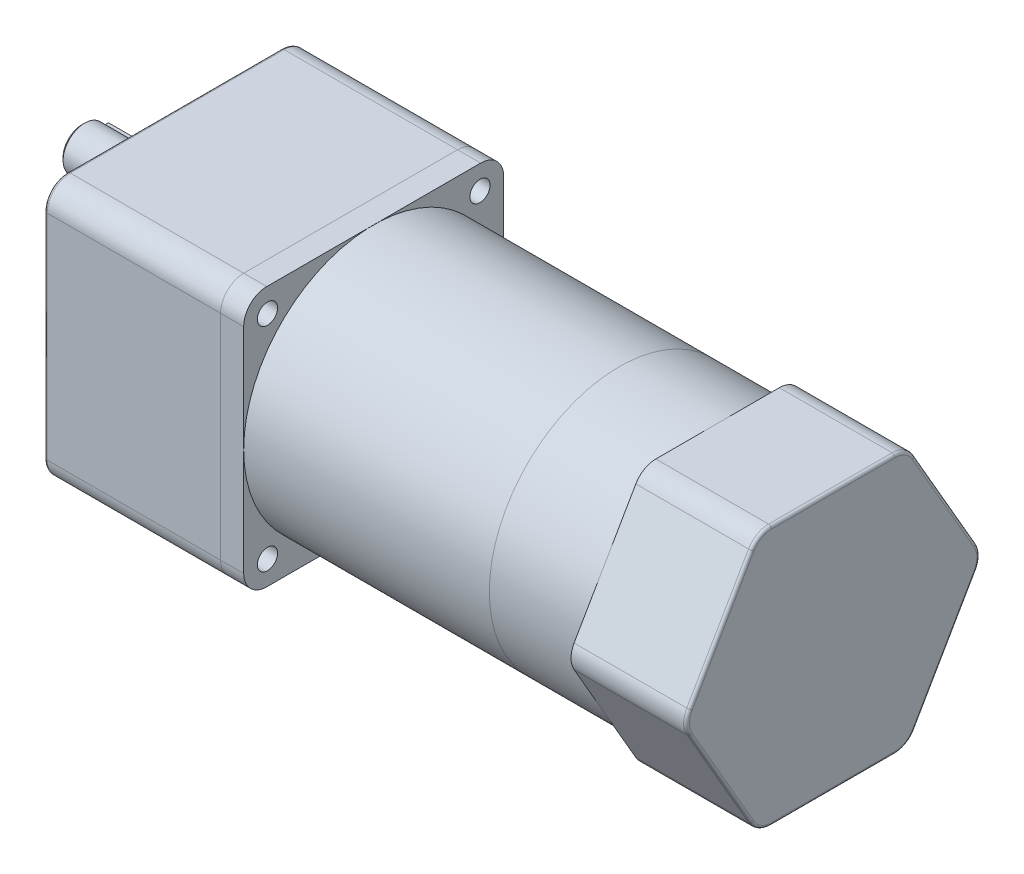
ISO-10303-21;
HEADER;
FILE_DESCRIPTION(('STEP AP214'),'2;1');
FILE_NAME('part.step','',(''),(''),'','','');
FILE_SCHEMA(('AUTOMOTIVE_DESIGN { 1 0 10303 214 1 1 1 1 }'));
ENDSEC;
DATA;
#1=APPLICATION_CONTEXT('core data for automotive mechanical design processes');
#2=APPLICATION_PROTOCOL_DEFINITION('international standard','automotive_design',2000,#1);
#3=PRODUCT_CONTEXT('',#1,'mechanical');
#4=PRODUCT('Part','Part','',(#3));
#5=PRODUCT_RELATED_PRODUCT_CATEGORY('part','',(#4));
#6=PRODUCT_DEFINITION_FORMATION('','',#4);
#7=PRODUCT_DEFINITION_CONTEXT('part definition',#1,'design');
#8=PRODUCT_DEFINITION('design','',#6,#7);
#9=PRODUCT_DEFINITION_SHAPE('','',#8);
#10=(LENGTH_UNIT() NAMED_UNIT(*) SI_UNIT(.MILLI.,.METRE.));
#11=(NAMED_UNIT(*) PLANE_ANGLE_UNIT() SI_UNIT($,.RADIAN.));
#12=(NAMED_UNIT(*) SI_UNIT($,.STERADIAN.) SOLID_ANGLE_UNIT());
#13=UNCERTAINTY_MEASURE_WITH_UNIT(LENGTH_MEASURE(1.E-05),#10,'distance_accuracy_value','');
#14=(GEOMETRIC_REPRESENTATION_CONTEXT(3) GLOBAL_UNCERTAINTY_ASSIGNED_CONTEXT((#13)) GLOBAL_UNIT_ASSIGNED_CONTEXT((#10,
#11,#12)) REPRESENTATION_CONTEXT('',''));
#15=CARTESIAN_POINT('',(0.,0.,0.));
#16=DIRECTION('',(0.,0.,1.));
#17=DIRECTION('',(1.,0.,0.));
#18=AXIS2_PLACEMENT_3D('',#15,#16,#17);
#19=CARTESIAN_POINT('',(-9.5,18.,-9.5));
#20=DIRECTION('',(0.,0.,1.));
#21=DIRECTION('',(1.,0.,0.));
#22=AXIS2_PLACEMENT_3D('',#19,#20,#21);
#23=CYLINDRICAL_SURFACE('',#22,2.5);
#24=DIRECTION('',(0.,0.,1.));
#25=VECTOR('',#24,1.);
#26=CARTESIAN_POINT('',(-9.5,15.5,-9.5));
#27=LINE('',#26,#25);
#28=CARTESIAN_POINT('',(-9.5,15.5,-9.2));
#29=VERTEX_POINT('',#28);
#30=CARTESIAN_POINT('',(-9.5,15.5,-4.5));
#31=VERTEX_POINT('',#30);
#32=EDGE_CURVE('E101',#29,#31,#27,.T.);
#33=ORIENTED_EDGE('',*,*,#32,.F.);
#34=CARTESIAN_POINT('',(-9.5,18.,-9.2));
#35=DIRECTION('',(0.,0.,-1.));
#36=DIRECTION('',(-1.,0.,0.));
#37=AXIS2_PLACEMENT_3D('',#34,#35,#36);
#38=CIRCLE('',#37,2.5);
#39=CARTESIAN_POINT('',(-9.5,20.5,-9.2));
#40=VERTEX_POINT('',#39);
#41=EDGE_CURVE('E144',#29,#40,#38,.F.);
#42=ORIENTED_EDGE('',*,*,#41,.T.);
#43=DIRECTION('',(0.,0.,1.));
#44=VECTOR('',#43,1.);
#45=CARTESIAN_POINT('',(-9.5,20.5,-9.5));
#46=LINE('',#45,#44);
#47=CARTESIAN_POINT('',(-9.5,20.5,-4.5));
#48=VERTEX_POINT('',#47);
#49=EDGE_CURVE('E123',#40,#48,#46,.T.);
#50=ORIENTED_EDGE('',*,*,#49,.T.);
#51=CARTESIAN_POINT('',(-9.5,18.,-4.5));
#52=DIRECTION('',(0.,0.,-1.));
#53=DIRECTION('',(-1.,0.,0.));
#54=AXIS2_PLACEMENT_3D('',#51,#52,#53);
#55=CIRCLE('',#54,2.5);
#56=EDGE_CURVE('E119',#48,#31,#55,.T.);
#57=ORIENTED_EDGE('',*,*,#56,.T.);
#58=EDGE_LOOP('',(#33,#42,#50,#57));
#59=FACE_BOUND('',#58,.T.);
#60=ADVANCED_FACE('F48',(#59),#23,.T.);
#61=CARTESIAN_POINT('',(-32.,15.5,-9.5));
#62=DIRECTION('',(0.,1.,0.));
#63=DIRECTION('',(-1.,0.,0.));
#64=AXIS2_PLACEMENT_3D('',#61,#62,#63);
#65=PLANE('',#64);
#66=DIRECTION('',(0.,0.,1.));
#67=VECTOR('',#66,1.);
#68=CARTESIAN_POINT('',(-32.,15.5,-9.5));
#69=LINE('',#68,#67);
#70=CARTESIAN_POINT('',(-32.,15.5,-9.2));
#71=VERTEX_POINT('',#70);
#72=CARTESIAN_POINT('',(-32.,15.5,-4.5));
#73=VERTEX_POINT('',#72);
#74=EDGE_CURVE('E113',#71,#73,#69,.T.);
#75=ORIENTED_EDGE('',*,*,#74,.F.);
#76=DIRECTION('',(1.,0.,0.));
#77=VECTOR('',#76,1.);
#78=CARTESIAN_POINT('',(-9.5,15.5,-9.2));
#79=LINE('',#78,#77);
#80=EDGE_CURVE('E107',#71,#29,#79,.T.);
#81=ORIENTED_EDGE('',*,*,#80,.T.);
#82=ORIENTED_EDGE('',*,*,#32,.T.);
#83=DIRECTION('',(-1.,0.,0.));
#84=VECTOR('',#83,1.);
#85=CARTESIAN_POINT('',(-32.,15.5,-4.5));
#86=LINE('',#85,#84);
#87=EDGE_CURVE('E104',#31,#73,#86,.T.);
#88=ORIENTED_EDGE('',*,*,#87,.T.);
#89=EDGE_LOOP('',(#75,#81,#82,#88));
#90=FACE_BOUND('',#89,.T.);
#91=ADVANCED_FACE('F103',(#90),#65,.F.);
#92=CARTESIAN_POINT('',(-32.,20.5,-9.5));
#93=DIRECTION('',(1.,0.,0.));
#94=DIRECTION('',(0.,0.,-1.));
#95=AXIS2_PLACEMENT_3D('',#92,#93,#94);
#96=PLANE('',#95);
#97=DIRECTION('',(0.,0.,1.));
#98=VECTOR('',#97,1.);
#99=CARTESIAN_POINT('',(-32.,20.5,-9.5));
#100=LINE('',#99,#98);
#101=CARTESIAN_POINT('',(-32.,20.5,-9.2));
#102=VERTEX_POINT('',#101);
#103=CARTESIAN_POINT('',(-32.,20.5,-4.5));
#104=VERTEX_POINT('',#103);
#105=EDGE_CURVE('E133',#102,#104,#100,.T.);
#106=ORIENTED_EDGE('',*,*,#105,.F.);
#107=DIRECTION('',(0.,-1.,0.));
#108=VECTOR('',#107,1.);
#109=CARTESIAN_POINT('',(-32.,15.5,-9.2));
#110=LINE('',#109,#108);
#111=EDGE_CURVE('E57',#102,#71,#110,.T.);
#112=ORIENTED_EDGE('',*,*,#111,.T.);
#113=ORIENTED_EDGE('',*,*,#74,.T.);
#114=DIRECTION('',(0.,1.,0.));
#115=VECTOR('',#114,1.);
#116=CARTESIAN_POINT('',(-32.,20.5,-4.5));
#117=LINE('',#116,#115);
#118=EDGE_CURVE('E121',#73,#104,#117,.T.);
#119=ORIENTED_EDGE('',*,*,#118,.T.);
#120=EDGE_LOOP('',(#106,#112,#113,#119));
#121=FACE_BOUND('',#120,.T.);
#122=ADVANCED_FACE('F168',(#121),#96,.F.);
#123=CARTESIAN_POINT('',(-9.5,20.5,-9.5));
#124=DIRECTION('',(0.,-1.,0.));
#125=DIRECTION('',(0.,0.,-1.));
#126=AXIS2_PLACEMENT_3D('',#123,#124,#125);
#127=PLANE('',#126);
#128=ORIENTED_EDGE('',*,*,#49,.F.);
#129=DIRECTION('',(-1.,0.,0.));
#130=VECTOR('',#129,1.);
#131=CARTESIAN_POINT('',(-32.,20.5,-9.2));
#132=LINE('',#131,#130);
#133=EDGE_CURVE('E12',#40,#102,#132,.T.);
#134=ORIENTED_EDGE('',*,*,#133,.T.);
#135=ORIENTED_EDGE('',*,*,#105,.T.);
#136=DIRECTION('',(1.,0.,0.));
#137=VECTOR('',#136,1.);
#138=CARTESIAN_POINT('',(-9.5,20.5,-4.5));
#139=LINE('',#138,#137);
#140=EDGE_CURVE('E130',#104,#48,#139,.T.);
#141=ORIENTED_EDGE('',*,*,#140,.T.);
#142=EDGE_LOOP('',(#128,#134,#135,#141));
#143=FACE_BOUND('',#142,.T.);
#144=ADVANCED_FACE('F167',(#143),#127,.F.);
#145=CARTESIAN_POINT('',(-9.5,18.,-9.5));
#146=DIRECTION('',(0.,0.,-1.));
#147=DIRECTION('',(-1.,0.,0.));
#148=AXIS2_PLACEMENT_3D('',#145,#146,#147);
#149=PLANE('',#148);
#150=DIRECTION('',(1.,0.,0.));
#151=VECTOR('',#150,1.);
#152=CARTESIAN_POINT('',(-9.5,20.2,-9.5));
#153=LINE('',#152,#151);
#154=CARTESIAN_POINT('',(-31.7,20.2,-9.5));
#155=VERTEX_POINT('',#154);
#156=CARTESIAN_POINT('',(-9.5,20.2,-9.5));
#157=VERTEX_POINT('',#156);
#158=EDGE_CURVE('E112',#155,#157,#153,.T.);
#159=ORIENTED_EDGE('',*,*,#158,.T.);
#160=CARTESIAN_POINT('',(-9.5,18.,-9.5));
#161=DIRECTION('',(0.,0.,-1.));
#162=DIRECTION('',(-1.,0.,0.));
#163=AXIS2_PLACEMENT_3D('',#160,#161,#162);
#164=CIRCLE('',#163,2.2);
#165=CARTESIAN_POINT('',(-9.5,15.8,-9.5));
#166=VERTEX_POINT('',#165);
#167=EDGE_CURVE('E141',#157,#166,#164,.T.);
#168=ORIENTED_EDGE('',*,*,#167,.T.);
#169=DIRECTION('',(-1.,0.,0.));
#170=VECTOR('',#169,1.);
#171=CARTESIAN_POINT('',(-32.,15.8,-9.5));
#172=LINE('',#171,#170);
#173=CARTESIAN_POINT('',(-31.7,15.8,-9.5));
#174=VERTEX_POINT('',#173);
#175=EDGE_CURVE('E139',#166,#174,#172,.T.);
#176=ORIENTED_EDGE('',*,*,#175,.T.);
#177=DIRECTION('',(0.,1.,0.));
#178=VECTOR('',#177,1.);
#179=CARTESIAN_POINT('',(-31.7,20.5,-9.5));
#180=LINE('',#179,#178);
#181=EDGE_CURVE('E137',#174,#155,#180,.T.);
#182=ORIENTED_EDGE('',*,*,#181,.T.);
#183=EDGE_LOOP('',(#159,#168,#176,#182));
#184=FACE_BOUND('',#183,.T.);
#185=ADVANCED_FACE('F162',(#184),#149,.T.);
#186=CARTESIAN_POINT('',(-9.5,18.,-4.5));
#187=DIRECTION('',(0.,0.,-1.));
#188=DIRECTION('',(-1.,0.,0.));
#189=AXIS2_PLACEMENT_3D('',#186,#187,#188);
#190=PLANE('',#189);
#191=ORIENTED_EDGE('',*,*,#56,.F.);
#192=ORIENTED_EDGE('',*,*,#140,.F.);
#193=ORIENTED_EDGE('',*,*,#118,.F.);
#194=ORIENTED_EDGE('',*,*,#87,.F.);
#195=EDGE_LOOP('',(#191,#192,#193,#194));
#196=FACE_BOUND('',#195,.T.);
#197=ADVANCED_FACE('F117',(#196),#190,.F.);
#198=CARTESIAN_POINT('',(-31.7,18.,-9.5));
#199=DIRECTION('',(-0.707106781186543,0.,-0.707106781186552));
#200=DIRECTION('',(0.,-1.,0.));
#201=AXIS2_PLACEMENT_3D('',#198,#199,#200);
#202=PLANE('',#201);
#203=DIRECTION('',(-0.577350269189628,-0.577350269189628,0.577350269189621));
#204=VECTOR('',#203,1.);
#205=CARTESIAN_POINT('',(-30.9666666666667,16.5333333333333,-10.2333333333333));
#206=LINE('',#205,#204);
#207=EDGE_CURVE('E127',#71,#174,#206,.F.);
#208=ORIENTED_EDGE('',*,*,#207,.F.);
#209=ORIENTED_EDGE('',*,*,#111,.F.);
#210=DIRECTION('',(-0.577350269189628,0.577350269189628,0.577350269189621));
#211=VECTOR('',#210,1.);
#212=CARTESIAN_POINT('',(-24.2999999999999,12.7999999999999,-16.9));
#213=LINE('',#212,#211);
#214=EDGE_CURVE('E52',#155,#102,#213,.T.);
#215=ORIENTED_EDGE('',*,*,#214,.F.);
#216=ORIENTED_EDGE('',*,*,#181,.F.);
#217=EDGE_LOOP('',(#208,#209,#215,#216));
#218=FACE_BOUND('',#217,.T.);
#219=ADVANCED_FACE('F50',(#218),#202,.T.);
#220=CARTESIAN_POINT('',(-9.5,20.2,-9.5));
#221=DIRECTION('',(0.,0.707106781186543,-0.707106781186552));
#222=DIRECTION('',(-1.,0.,0.));
#223=AXIS2_PLACEMENT_3D('',#220,#221,#222);
#224=PLANE('',#223);
#225=ORIENTED_EDGE('',*,*,#214,.T.);
#226=ORIENTED_EDGE('',*,*,#133,.F.);
#227=DIRECTION('',(0.,0.707106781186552,0.707106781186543));
#228=VECTOR('',#227,1.);
#229=CARTESIAN_POINT('',(-9.5,20.2,-9.5));
#230=LINE('',#229,#228);
#231=EDGE_CURVE('E150',#157,#40,#230,.T.);
#232=ORIENTED_EDGE('',*,*,#231,.F.);
#233=ORIENTED_EDGE('',*,*,#158,.F.);
#234=EDGE_LOOP('',(#225,#226,#232,#233));
#235=FACE_BOUND('',#234,.T.);
#236=ADVANCED_FACE('F185',(#235),#224,.T.);
#237=CARTESIAN_POINT('',(-9.5,15.8,-9.5));
#238=DIRECTION('',(0.,-0.707106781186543,-0.707106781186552));
#239=DIRECTION('',(1.,0.,0.));
#240=AXIS2_PLACEMENT_3D('',#237,#238,#239);
#241=PLANE('',#240);
#242=ORIENTED_EDGE('',*,*,#207,.T.);
#243=ORIENTED_EDGE('',*,*,#175,.F.);
#244=DIRECTION('',(0.,0.707106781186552,-0.707106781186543));
#245=VECTOR('',#244,1.);
#246=CARTESIAN_POINT('',(-9.5,15.5,-9.2));
#247=LINE('',#246,#245);
#248=EDGE_CURVE('E148',#29,#166,#247,.T.);
#249=ORIENTED_EDGE('',*,*,#248,.F.);
#250=ORIENTED_EDGE('',*,*,#80,.F.);
#251=EDGE_LOOP('',(#242,#243,#249,#250));
#252=FACE_BOUND('',#251,.T.);
#253=ADVANCED_FACE('F155',(#252),#241,.T.);
#254=CARTESIAN_POINT('',(-9.5,18.,-9.5));
#255=DIRECTION('',(0.,0.,1.));
#256=DIRECTION('',(1.,0.,0.));
#257=AXIS2_PLACEMENT_3D('',#254,#255,#256);
#258=CONICAL_SURFACE('',#257,2.2,0.785398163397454);
#259=ORIENTED_EDGE('',*,*,#231,.T.);
#260=ORIENTED_EDGE('',*,*,#41,.F.);
#261=ORIENTED_EDGE('',*,*,#248,.T.);
#262=ORIENTED_EDGE('',*,*,#167,.F.);
#263=EDGE_LOOP('',(#259,#260,#261,#262));
#264=FACE_BOUND('',#263,.T.);
#265=ADVANCED_FACE('F166',(#264),#258,.T.);
#266=CLOSED_SHELL('',(#60,#91,#122,#144,#185,#197,#219,#236,#253,#265));
#267=MANIFOLD_SOLID_BREP('B2',#266);
#268=CARTESIAN_POINT('',(-32.,18.,0.));
#269=DIRECTION('',(1.,0.,0.));
#270=DIRECTION('',(0.,0.,-1.));
#271=AXIS2_PLACEMENT_3D('',#268,#269,#270);
#272=CYLINDRICAL_SURFACE('',#271,7.5);
#273=CARTESIAN_POINT('',(-3.,18.,0.));
#274=DIRECTION('',(-1.,0.,0.));
#275=DIRECTION('',(0.,0.,1.));
#276=AXIS2_PLACEMENT_3D('',#273,#274,#275);
#277=CIRCLE('',#276,7.5);
#278=CARTESIAN_POINT('',(-3.,18.,7.5));
#279=VERTEX_POINT('',#278);
#280=EDGE_CURVE('E342',#279,#279,#277,.T.);
#281=ORIENTED_EDGE('',*,*,#280,.T.);
#282=EDGE_LOOP('',(#281));
#283=FACE_BOUND('',#282,.T.);
#284=DIRECTION('',(1.,0.,0.));
#285=VECTOR('',#284,1.);
#286=CARTESIAN_POINT('',(-32.,20.5,-7.07106781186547));
#287=LINE('',#286,#285);
#288=CARTESIAN_POINT('',(-31.,20.5,-7.07106781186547));
#289=VERTEX_POINT('',#288);
#290=CARTESIAN_POINT('',(-9.5,20.5,-7.07106781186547));
#291=VERTEX_POINT('',#290);
#292=EDGE_CURVE('E331',#289,#291,#287,.T.);
#293=ORIENTED_EDGE('',*,*,#292,.F.);
#294=CARTESIAN_POINT('',(-31.,18.,0.));
#295=DIRECTION('',(-1.,0.,0.));
#296=DIRECTION('',(0.,0.,1.));
#297=AXIS2_PLACEMENT_3D('',#294,#295,#296);
#298=CIRCLE('',#297,7.5);
#299=CARTESIAN_POINT('',(-31.,15.5,-7.07106781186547));
#300=VERTEX_POINT('',#299);
#301=EDGE_CURVE('E275',#289,#300,#298,.F.);
#302=ORIENTED_EDGE('',*,*,#301,.T.);
#303=DIRECTION('',(1.,0.,0.));
#304=VECTOR('',#303,1.);
#305=CARTESIAN_POINT('',(-32.,15.5,-7.07106781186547));
#306=LINE('',#305,#304);
#307=CARTESIAN_POINT('',(-9.5,15.5,-7.07106781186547));
#308=VERTEX_POINT('',#307);
#309=EDGE_CURVE('E333',#308,#300,#306,.F.);
#310=ORIENTED_EDGE('',*,*,#309,.F.);
#311=CARTESIAN_POINT('',(-9.5,20.5,-7.07106781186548));
#312=CARTESIAN_POINT('',(-9.43179292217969,20.5000089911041,-7.07105693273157));
#313=CARTESIAN_POINT('',(-9.36359192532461,20.4972088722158,-7.07205443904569));
#314=CARTESIAN_POINT('',(-9.22771896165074,20.4860604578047,-7.07598524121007));
#315=CARTESIAN_POINT('',(-9.16004685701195,20.477713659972,-7.07891801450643));
#316=CARTESIAN_POINT('',(-9.02590951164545,20.455574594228,-7.08662705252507));
#317=CARTESIAN_POINT('',(-8.95944129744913,20.4417984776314,-7.09139784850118));
#318=CARTESIAN_POINT('',(-8.8279917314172,20.4089418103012,-7.10262619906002));
#319=CARTESIAN_POINT('',(-8.7630104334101,20.3898610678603,-7.10908381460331));
#320=CARTESIAN_POINT('',(-8.57103842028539,20.324915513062,-7.13069940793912));
#321=CARTESIAN_POINT('',(-8.44682084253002,20.2713141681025,-7.14811243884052));
#322=CARTESIAN_POINT('',(-8.20912318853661,20.1451778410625,-7.1869703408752));
#323=CARTESIAN_POINT('',(-8.09564976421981,20.0726312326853,-7.20841768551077));
#324=CARTESIAN_POINT('',(-7.8782070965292,19.9076299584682,-7.25386182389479));
#325=CARTESIAN_POINT('',(-7.7747148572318,19.8145628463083,-7.27792189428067));
#326=CARTESIAN_POINT('',(-7.5844828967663,19.6124707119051,-7.32534626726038));
#327=CARTESIAN_POINT('',(-7.497746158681,19.5034428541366,-7.34871044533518));
#328=CARTESIAN_POINT('',(-7.34130177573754,19.2690092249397,-7.39284706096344));
#329=CARTESIAN_POINT('',(-7.27209769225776,19.1432502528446,-7.41353593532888));
#330=CARTESIAN_POINT('',(-7.1560192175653,18.8810730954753,-7.44924021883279));
#331=CARTESIAN_POINT('',(-7.10913800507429,18.7446581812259,-7.46425736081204));
#332=CARTESIAN_POINT('',(-7.04066072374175,18.4700733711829,-7.48647677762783));
#333=CARTESIAN_POINT('',(-7.01824182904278,18.3321295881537,-7.49393272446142));
#334=CARTESIAN_POINT('',(-6.99670924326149,18.0542474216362,-7.50109021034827));
#335=CARTESIAN_POINT('',(-6.99758999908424,17.9143095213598,-7.50079359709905));
#336=CARTESIAN_POINT('',(-7.0221107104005,17.6422403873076,-7.49265096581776));
#337=CARTESIAN_POINT('',(-7.04485659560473,17.5100182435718,-7.48510152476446));
#338=CARTESIAN_POINT('',(-7.1109829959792,17.2513898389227,-7.46367401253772));
#339=CARTESIAN_POINT('',(-7.15436465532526,17.1249839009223,-7.44979559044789));
#340=CARTESIAN_POINT('',(-7.26105342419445,16.8796184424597,-7.41689170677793));
#341=CARTESIAN_POINT('',(-7.32461511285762,16.760778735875,-7.39780094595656));
#342=CARTESIAN_POINT('',(-7.46964987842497,16.5351885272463,-7.35645969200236));
#343=CARTESIAN_POINT('',(-7.55112782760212,16.4284413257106,-7.33420833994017));
#344=CARTESIAN_POINT('',(-7.73417762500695,16.2247566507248,-7.28765679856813));
#345=CARTESIAN_POINT('',(-7.83651385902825,16.128515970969,-7.26330946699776));
#346=CARTESIAN_POINT('',(-8.05610372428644,15.9543199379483,-7.21618726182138));
#347=CARTESIAN_POINT('',(-8.17336215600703,15.8763704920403,-7.19341289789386));
#348=CARTESIAN_POINT('',(-8.42170044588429,15.7399916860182,-7.15175078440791));
#349=CARTESIAN_POINT('',(-8.55295878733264,15.6818674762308,-7.13292537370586));
#350=CARTESIAN_POINT('',(-8.8241174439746,15.5888494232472,-7.10202742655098));
#351=CARTESIAN_POINT('',(-8.96400373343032,15.5539189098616,-7.08994423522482));
#352=CARTESIAN_POINT('',(-9.17104659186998,15.5208546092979,-7.078413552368));
#353=CARTESIAN_POINT('',(-9.23660347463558,15.5130373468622,-7.07566669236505));
#354=CARTESIAN_POINT('',(-9.36809519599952,15.502613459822,-7.07199258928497));
#355=CARTESIAN_POINT('',(-9.43402943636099,15.5000001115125,-7.0710629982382));
#356=CARTESIAN_POINT('',(-9.5,15.5,-7.07106781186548));
#357=B_SPLINE_CURVE_WITH_KNOTS('',3,(#311,#312,#313,#314,#315,#316,#317,#318,#319,#320,#321,
#322,#323,#324,#325,#326,#327,#328,#329,#330,#331,#332,#333,#334,#335,#336,#337,#338,#339,#340,
#341,#342,#343,#344,#345,#346,#347,#348,#349,#350,#351,#352,#353,#354,#355,#356),.UNSPECIFIED.,
.F.,.F.,(4,2,2,2,2,2,2,2,2,2,2,2,2,2,2,2,2,2,2,2,2,2,4),(0.,0.20454621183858,0.409037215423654,
0.612924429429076,0.816819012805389,1.22401016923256,1.63145179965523,2.0532786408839,
2.47518051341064,2.90809434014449,3.34087579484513,3.75860278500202,4.17623021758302,
4.57747647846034,4.97874498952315,5.38529148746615,5.79194868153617,6.21771736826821,
6.64362337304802,7.07581676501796,7.50732520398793,7.70536340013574,7.90314555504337),.UNSPECIFIED.);
#358=EDGE_CURVE('E345',#291,#308,#357,.T.);
#359=ORIENTED_EDGE('',*,*,#358,.F.);
#360=EDGE_LOOP('',(#293,#302,#310,#359));
#361=FACE_BOUND('',#360,.T.);
#362=ADVANCED_FACE('F262',(#283,#361),#272,.T.);
#363=CARTESIAN_POINT('',(-32.,18.,0.));
#364=DIRECTION('',(-1.,0.,0.));
#365=DIRECTION('',(0.,0.,1.));
#366=AXIS2_PLACEMENT_3D('',#363,#364,#365);
#367=PLANE('',#366);
#368=DIRECTION('',(0.,0.,-1.));
#369=VECTOR('',#368,1.);
#370=CARTESIAN_POINT('',(-32.,15.5,-4.5));
#371=LINE('',#370,#369);
#372=CARTESIAN_POINT('',(-32.,15.5,-4.5));
#373=VERTEX_POINT('',#372);
#374=CARTESIAN_POINT('',(-32.,15.5,-6.00000000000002));
#375=VERTEX_POINT('',#374);
#376=EDGE_CURVE('E337',#373,#375,#371,.T.);
#377=ORIENTED_EDGE('',*,*,#376,.T.);
#378=CARTESIAN_POINT('',(-32.,18.,0.));
#379=DIRECTION('',(-1.,0.,0.));
#380=DIRECTION('',(0.,0.,1.));
#381=AXIS2_PLACEMENT_3D('',#378,#379,#380);
#382=CIRCLE('',#381,6.50000000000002);
#383=CARTESIAN_POINT('',(-32.,20.5,-6.00000000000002));
#384=VERTEX_POINT('',#383);
#385=EDGE_CURVE('E351',#375,#384,#382,.T.);
#386=ORIENTED_EDGE('',*,*,#385,.T.);
#387=DIRECTION('',(0.,0.,-1.));
#388=VECTOR('',#387,1.);
#389=CARTESIAN_POINT('',(-32.,20.5,-4.5));
#390=LINE('',#389,#388);
#391=CARTESIAN_POINT('',(-32.,20.5,-4.5));
#392=VERTEX_POINT('',#391);
#393=EDGE_CURVE('E334',#392,#384,#390,.T.);
#394=ORIENTED_EDGE('',*,*,#393,.F.);
#395=DIRECTION('',(0.,-1.,0.));
#396=VECTOR('',#395,1.);
#397=CARTESIAN_POINT('',(-32.,20.5,-4.5));
#398=LINE('',#397,#396);
#399=EDGE_CURVE('E318',#392,#373,#398,.T.);
#400=ORIENTED_EDGE('',*,*,#399,.T.);
#401=EDGE_LOOP('',(#377,#386,#394,#400));
#402=FACE_BOUND('',#401,.T.);
#403=ADVANCED_FACE('F361',(#402),#367,.T.);
#404=CARTESIAN_POINT('',(-3.,18.,0.));
#405=DIRECTION('',(-1.,0.,0.));
#406=DIRECTION('',(0.,0.,1.));
#407=AXIS2_PLACEMENT_3D('',#404,#405,#406);
#408=PLANE('',#407);
#409=ORIENTED_EDGE('',*,*,#280,.F.);
#410=EDGE_LOOP('',(#409));
#411=FACE_BOUND('',#410,.T.);
#412=ADVANCED_FACE('F359',(#411),#408,.F.);
#413=CARTESIAN_POINT('',(-9.5,18.,-4.5));
#414=DIRECTION('',(0.,0.,-1.));
#415=DIRECTION('',(-1.,0.,0.));
#416=AXIS2_PLACEMENT_3D('',#413,#414,#415);
#417=CYLINDRICAL_SURFACE('',#416,2.5);
#418=DIRECTION('',(0.,0.,-1.));
#419=VECTOR('',#418,1.);
#420=CARTESIAN_POINT('',(-9.5,20.5,-4.5));
#421=LINE('',#420,#419);
#422=CARTESIAN_POINT('',(-9.5,20.5,-4.5));
#423=VERTEX_POINT('',#422);
#424=EDGE_CURVE('E326',#423,#291,#421,.T.);
#425=ORIENTED_EDGE('',*,*,#424,.T.);
#426=ORIENTED_EDGE('',*,*,#358,.T.);
#427=DIRECTION('',(0.,0.,-1.));
#428=VECTOR('',#427,1.);
#429=CARTESIAN_POINT('',(-9.5,15.5,-4.5));
#430=LINE('',#429,#428);
#431=CARTESIAN_POINT('',(-9.5,15.5,-4.5));
#432=VERTEX_POINT('',#431);
#433=EDGE_CURVE('E328',#432,#308,#430,.T.);
#434=ORIENTED_EDGE('',*,*,#433,.F.);
#435=CARTESIAN_POINT('',(-9.5,18.,-4.5));
#436=DIRECTION('',(0.,0.,1.));
#437=DIRECTION('',(1.,0.,0.));
#438=AXIS2_PLACEMENT_3D('',#435,#436,#437);
#439=CIRCLE('',#438,2.5);
#440=EDGE_CURVE('E316',#432,#423,#439,.T.);
#441=ORIENTED_EDGE('',*,*,#440,.T.);
#442=EDGE_LOOP('',(#425,#426,#434,#441));
#443=FACE_BOUND('',#442,.T.);
#444=ADVANCED_FACE('F325',(#443),#417,.F.);
#445=CARTESIAN_POINT('',(-9.5,20.5,-4.5));
#446=DIRECTION('',(0.,-1.,0.));
#447=DIRECTION('',(0.,0.,-1.));
#448=AXIS2_PLACEMENT_3D('',#445,#446,#447);
#449=PLANE('',#448);
#450=ORIENTED_EDGE('',*,*,#393,.T.);
#451=CARTESIAN_POINT('',(-32.,20.5,-6.00000000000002));
#452=CARTESIAN_POINT('',(-31.9171731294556,20.5,-6.0897273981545));
#453=CARTESIAN_POINT('',(-31.8341996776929,20.5,-6.17931930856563));
#454=CARTESIAN_POINT('',(-31.6679908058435,20.5,-6.35825867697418));
#455=CARTESIAN_POINT('',(-31.5847553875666,20.5,-6.44760613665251));
#456=CARTESIAN_POINT('',(-31.4180527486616,20.5,-6.62608424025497));
#457=CARTESIAN_POINT('',(-31.3345855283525,20.5,-6.7152148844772));
#458=CARTESIAN_POINT('',(-31.1674427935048,20.5,-6.89328182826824));
#459=CARTESIAN_POINT('',(-31.0837672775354,20.5,-6.98221812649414));
#460=CARTESIAN_POINT('',(-31.,20.5,-7.07106781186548));
#461=B_SPLINE_CURVE_WITH_KNOTS('',3,(#451,#452,#453,#454,#455,#456,#457,#458,#459,#460),
.UNSPECIFIED.,.F.,.F.,(4,2,2,2,4),(0.,0.366335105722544,0.732667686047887,1.0989997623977,
1.46533436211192),.UNSPECIFIED.);
#462=EDGE_CURVE('E289',#384,#289,#461,.T.);
#463=ORIENTED_EDGE('',*,*,#462,.T.);
#464=ORIENTED_EDGE('',*,*,#292,.T.);
#465=ORIENTED_EDGE('',*,*,#424,.F.);
#466=DIRECTION('',(-1.,0.,0.));
#467=VECTOR('',#466,1.);
#468=CARTESIAN_POINT('',(-9.5,20.5,-4.5));
#469=LINE('',#468,#467);
#470=EDGE_CURVE('E313',#423,#392,#469,.T.);
#471=ORIENTED_EDGE('',*,*,#470,.T.);
#472=EDGE_LOOP('',(#450,#463,#464,#465,#471));
#473=FACE_BOUND('',#472,.T.);
#474=ADVANCED_FACE('F330',(#473),#449,.T.);
#475=CARTESIAN_POINT('',(-32.,15.5,-4.5));
#476=DIRECTION('',(0.,1.,0.));
#477=DIRECTION('',(0.,0.,1.));
#478=AXIS2_PLACEMENT_3D('',#475,#476,#477);
#479=PLANE('',#478);
#480=ORIENTED_EDGE('',*,*,#309,.T.);
#481=CARTESIAN_POINT('',(-31.,15.5,-7.07106781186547));
#482=CARTESIAN_POINT('',(-31.0837672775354,15.5,-6.98221812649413));
#483=CARTESIAN_POINT('',(-31.1674427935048,15.5,-6.89328182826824));
#484=CARTESIAN_POINT('',(-31.3345855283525,15.5,-6.7152148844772));
#485=CARTESIAN_POINT('',(-31.4180527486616,15.5,-6.62608424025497));
#486=CARTESIAN_POINT('',(-31.5847553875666,15.5,-6.44760613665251));
#487=CARTESIAN_POINT('',(-31.6679908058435,15.5,-6.35825867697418));
#488=CARTESIAN_POINT('',(-31.8341996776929,15.5,-6.17931930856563));
#489=CARTESIAN_POINT('',(-31.9171731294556,15.5,-6.08972739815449));
#490=CARTESIAN_POINT('',(-32.,15.5,-6.00000000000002));
#491=B_SPLINE_CURVE_WITH_KNOTS('',3,(#481,#482,#483,#484,#485,#486,#487,#488,#489,#490),
.UNSPECIFIED.,.F.,.F.,(4,2,2,2,4),(0.,0.366334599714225,0.732666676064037,1.09899925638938,
1.46533436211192),.UNSPECIFIED.);
#492=EDGE_CURVE('E46',#300,#375,#491,.T.);
#493=ORIENTED_EDGE('',*,*,#492,.T.);
#494=ORIENTED_EDGE('',*,*,#376,.F.);
#495=DIRECTION('',(1.,0.,0.));
#496=VECTOR('',#495,1.);
#497=CARTESIAN_POINT('',(-32.,15.5,-4.5));
#498=LINE('',#497,#496);
#499=EDGE_CURVE('E383',#373,#432,#498,.T.);
#500=ORIENTED_EDGE('',*,*,#499,.T.);
#501=ORIENTED_EDGE('',*,*,#433,.T.);
#502=EDGE_LOOP('',(#480,#493,#494,#500,#501));
#503=FACE_BOUND('',#502,.T.);
#504=ADVANCED_FACE('F387',(#503),#479,.T.);
#505=CARTESIAN_POINT('',(-9.5,18.,-4.5));
#506=DIRECTION('',(0.,0.,1.));
#507=DIRECTION('',(1.,0.,0.));
#508=AXIS2_PLACEMENT_3D('',#505,#506,#507);
#509=PLANE('',#508);
#510=ORIENTED_EDGE('',*,*,#440,.F.);
#511=ORIENTED_EDGE('',*,*,#499,.F.);
#512=ORIENTED_EDGE('',*,*,#399,.F.);
#513=ORIENTED_EDGE('',*,*,#470,.F.);
#514=EDGE_LOOP('',(#510,#511,#512,#513));
#515=FACE_BOUND('',#514,.T.);
#516=ADVANCED_FACE('F315',(#515),#509,.F.);
#517=CARTESIAN_POINT('',(-32.,18.,0.));
#518=DIRECTION('',(1.,0.,0.));
#519=DIRECTION('',(0.,0.,-1.));
#520=AXIS2_PLACEMENT_3D('',#517,#518,#519);
#521=CONICAL_SURFACE('',#520,6.50000000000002,0.785398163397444);
#522=ORIENTED_EDGE('',*,*,#492,.F.);
#523=ORIENTED_EDGE('',*,*,#301,.F.);
#524=ORIENTED_EDGE('',*,*,#462,.F.);
#525=ORIENTED_EDGE('',*,*,#385,.F.);
#526=EDGE_LOOP('',(#522,#523,#524,#525));
#527=FACE_BOUND('',#526,.T.);
#528=ADVANCED_FACE('F264',(#527),#521,.T.);
#529=CLOSED_SHELL('',(#362,#403,#412,#444,#474,#504,#516,#528));
#530=MANIFOLD_SOLID_BREP('B6',#529);
#531=CARTESIAN_POINT('',(0.,-37.,37.));
#532=DIRECTION('',(-1.,0.,0.));
#533=DIRECTION('',(0.,0.,1.));
#534=AXIS2_PLACEMENT_3D('',#531,#532,#533);
#535=PLANE('',#534);
#536=CARTESIAN_POINT('',(0.,0.,0.));
#537=DIRECTION('',(-1.,0.,0.));
#538=DIRECTION('',(0.,0.,1.));
#539=AXIS2_PLACEMENT_3D('',#536,#537,#538);
#540=CIRCLE('',#539,41.9);
#541=CARTESIAN_POINT('',(0.,0.,41.9));
#542=VERTEX_POINT('',#541);
#543=EDGE_CURVE('E260',#542,#542,#540,.F.);
#544=ORIENTED_EDGE('',*,*,#543,.T.);
#545=EDGE_LOOP('',(#544));
#546=FACE_BOUND('',#545,.T.);
#547=CARTESIAN_POINT('',(0.,-37.,-37.));
#548=DIRECTION('',(-1.,0.,0.));
#549=DIRECTION('',(0.,0.,1.));
#550=AXIS2_PLACEMENT_3D('',#547,#548,#549);
#551=CIRCLE('',#550,7.);
#552=CARTESIAN_POINT('',(0.,-37.,-44.));
#553=VERTEX_POINT('',#552);
#554=CARTESIAN_POINT('',(0.,-44.,-36.9999999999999));
#555=VERTEX_POINT('',#554);
#556=EDGE_CURVE('E613',#553,#555,#551,.T.);
#557=ORIENTED_EDGE('',*,*,#556,.T.);
#558=DIRECTION('',(0.,0.,-1.));
#559=VECTOR('',#558,1.);
#560=CARTESIAN_POINT('',(0.,-44.,37.));
#561=LINE('',#560,#559);
#562=CARTESIAN_POINT('',(0.,-44.,37.));
#563=VERTEX_POINT('',#562);
#564=EDGE_CURVE('E609',#555,#563,#561,.F.);
#565=ORIENTED_EDGE('',*,*,#564,.T.);
#566=CARTESIAN_POINT('',(0.,-37.,37.));
#567=DIRECTION('',(-1.,0.,0.));
#568=DIRECTION('',(0.,0.,1.));
#569=AXIS2_PLACEMENT_3D('',#566,#567,#568);
#570=CIRCLE('',#569,7.);
#571=CARTESIAN_POINT('',(0.,-37.,44.));
#572=VERTEX_POINT('',#571);
#573=EDGE_CURVE('E612',#563,#572,#570,.T.);
#574=ORIENTED_EDGE('',*,*,#573,.T.);
#575=DIRECTION('',(0.,-1.,0.));
#576=VECTOR('',#575,1.);
#577=CARTESIAN_POINT('',(0.,36.9999999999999,44.));
#578=LINE('',#577,#576);
#579=CARTESIAN_POINT('',(0.,36.9999999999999,44.));
#580=VERTEX_POINT('',#579);
#581=EDGE_CURVE('E576',#572,#580,#578,.F.);
#582=ORIENTED_EDGE('',*,*,#581,.T.);
#583=CARTESIAN_POINT('',(0.,37.,37.));
#584=DIRECTION('',(-1.,0.,0.));
#585=DIRECTION('',(0.,0.,1.));
#586=AXIS2_PLACEMENT_3D('',#583,#584,#585);
#587=CIRCLE('',#586,7.);
#588=CARTESIAN_POINT('',(0.,44.,37.));
#589=VERTEX_POINT('',#588);
#590=EDGE_CURVE('E620',#580,#589,#587,.T.);
#591=ORIENTED_EDGE('',*,*,#590,.T.);
#592=DIRECTION('',(0.,0.,1.));
#593=VECTOR('',#592,1.);
#594=CARTESIAN_POINT('',(0.,44.,-36.9999999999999));
#595=LINE('',#594,#593);
#596=CARTESIAN_POINT('',(0.,44.,-36.9999999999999));
#597=VERTEX_POINT('',#596);
#598=EDGE_CURVE('E618',#589,#597,#595,.F.);
#599=ORIENTED_EDGE('',*,*,#598,.T.);
#600=CARTESIAN_POINT('',(0.,37.,-37.));
#601=DIRECTION('',(-1.,0.,0.));
#602=DIRECTION('',(0.,0.,1.));
#603=AXIS2_PLACEMENT_3D('',#600,#601,#602);
#604=CIRCLE('',#603,7.);
#605=CARTESIAN_POINT('',(0.,36.9999999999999,-44.));
#606=VERTEX_POINT('',#605);
#607=EDGE_CURVE('E616',#597,#606,#604,.T.);
#608=ORIENTED_EDGE('',*,*,#607,.T.);
#609=DIRECTION('',(0.,1.,0.));
#610=VECTOR('',#609,1.);
#611=CARTESIAN_POINT('',(0.,-37.,-44.));
#612=LINE('',#611,#610);
#613=EDGE_CURVE('E570',#606,#553,#612,.F.);
#614=ORIENTED_EDGE('',*,*,#613,.T.);
#615=EDGE_LOOP('',(#557,#565,#574,#582,#591,#599,#608,#614));
#616=FACE_BOUND('',#615,.T.);
#617=CARTESIAN_POINT('',(0.,-36.7695526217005,-36.7695526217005));
#618=DIRECTION('',(-1.,0.,0.));
#619=DIRECTION('',(0.,0.,1.));
#620=AXIS2_PLACEMENT_3D('',#617,#618,#619);
#621=CIRCLE('',#620,2.49999999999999);
#622=CARTESIAN_POINT('',(0.,-36.7695526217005,-34.2695526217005));
#623=VERTEX_POINT('',#622);
#624=EDGE_CURVE('E657',#623,#623,#621,.T.);
#625=ORIENTED_EDGE('',*,*,#624,.F.);
#626=EDGE_LOOP('',(#625));
#627=FACE_BOUND('',#626,.T.);
#628=CARTESIAN_POINT('',(0.,36.7695526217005,-36.7695526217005));
#629=DIRECTION('',(-1.,0.,0.));
#630=DIRECTION('',(0.,0.,1.));
#631=AXIS2_PLACEMENT_3D('',#628,#629,#630);
#632=CIRCLE('',#631,2.49999999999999);
#633=CARTESIAN_POINT('',(0.,36.7695526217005,-34.2695526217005));
#634=VERTEX_POINT('',#633);
#635=EDGE_CURVE('E663',#634,#634,#632,.T.);
#636=ORIENTED_EDGE('',*,*,#635,.F.);
#637=EDGE_LOOP('',(#636));
#638=FACE_BOUND('',#637,.T.);
#639=CARTESIAN_POINT('',(0.,-36.7695526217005,36.7695526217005));
#640=DIRECTION('',(-1.,0.,0.));
#641=DIRECTION('',(0.,0.,1.));
#642=AXIS2_PLACEMENT_3D('',#639,#640,#641);
#643=CIRCLE('',#642,2.49999999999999);
#644=CARTESIAN_POINT('',(0.,-36.7695526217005,39.2695526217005));
#645=VERTEX_POINT('',#644);
#646=EDGE_CURVE('E669',#645,#645,#643,.T.);
#647=ORIENTED_EDGE('',*,*,#646,.F.);
#648=EDGE_LOOP('',(#647));
#649=FACE_BOUND('',#648,.T.);
#650=CARTESIAN_POINT('',(0.,36.7695526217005,36.7695526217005));
#651=DIRECTION('',(-1.,0.,0.));
#652=DIRECTION('',(0.,0.,1.));
#653=AXIS2_PLACEMENT_3D('',#650,#651,#652);
#654=CIRCLE('',#653,2.49999999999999);
#655=CARTESIAN_POINT('',(0.,36.7695526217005,39.2695526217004));
#656=VERTEX_POINT('',#655);
#657=EDGE_CURVE('E675',#656,#656,#654,.T.);
#658=ORIENTED_EDGE('',*,*,#657,.F.);
#659=EDGE_LOOP('',(#658));
#660=FACE_BOUND('',#659,.T.);
#661=ADVANCED_FACE('F452',(#546,#616,#627,#638,#649,#660),#535,.T.);
#662=CARTESIAN_POINT('',(61.,-37.,37.));
#663=DIRECTION('',(-1.,0.,0.));
#664=DIRECTION('',(0.,0.,1.));
#665=AXIS2_PLACEMENT_3D('',#662,#663,#664);
#666=CYLINDRICAL_SURFACE('',#665,8.);
#667=DIRECTION('',(-1.,0.,0.));
#668=VECTOR('',#667,1.);
#669=CARTESIAN_POINT('',(61.,-37.,45.));
#670=LINE('',#669,#668);
#671=CARTESIAN_POINT('',(61.,-37.,45.));
#672=VERTEX_POINT('',#671);
#673=CARTESIAN_POINT('',(1.00000000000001,-37.,45.));
#674=VERTEX_POINT('',#673);
#675=EDGE_CURVE('E552',#672,#674,#670,.T.);
#676=ORIENTED_EDGE('',*,*,#675,.T.);
#677=CARTESIAN_POINT('',(1.,-37.,37.));
#678=DIRECTION('',(-1.,0.,0.));
#679=DIRECTION('',(0.,0.,1.));
#680=AXIS2_PLACEMENT_3D('',#677,#678,#679);
#681=CIRCLE('',#680,8.);
#682=CARTESIAN_POINT('',(1.00000000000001,-45.,37.));
#683=VERTEX_POINT('',#682);
#684=EDGE_CURVE('E566',#674,#683,#681,.F.);
#685=ORIENTED_EDGE('',*,*,#684,.T.);
#686=DIRECTION('',(-1.,0.,0.));
#687=VECTOR('',#686,1.);
#688=CARTESIAN_POINT('',(61.,-45.,37.));
#689=LINE('',#688,#687);
#690=CARTESIAN_POINT('',(61.,-45.,37.));
#691=VERTEX_POINT('',#690);
#692=EDGE_CURVE('E586',#691,#683,#689,.T.);
#693=ORIENTED_EDGE('',*,*,#692,.F.);
#694=CARTESIAN_POINT('',(61.,-37.,37.));
#695=DIRECTION('',(1.,0.,0.));
#696=DIRECTION('',(0.,0.,1.));
#697=AXIS2_PLACEMENT_3D('',#694,#695,#696);
#698=CIRCLE('',#697,8.);
#699=EDGE_CURVE('E569',#672,#691,#698,.T.);
#700=ORIENTED_EDGE('',*,*,#699,.F.);
#701=EDGE_LOOP('',(#676,#685,#693,#700));
#702=FACE_BOUND('',#701,.T.);
#703=ADVANCED_FACE('F563',(#702),#666,.T.);
#704=CARTESIAN_POINT('',(61.,-45.,37.));
#705=DIRECTION('',(0.,1.,0.));
#706=DIRECTION('',(0.,0.,1.));
#707=AXIS2_PLACEMENT_3D('',#704,#705,#706);
#708=PLANE('',#707);
#709=ORIENTED_EDGE('',*,*,#692,.T.);
#710=DIRECTION('',(0.,0.,-1.));
#711=VECTOR('',#710,1.);
#712=CARTESIAN_POINT('',(1.,-45.,-36.9999999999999));
#713=LINE('',#712,#711);
#714=CARTESIAN_POINT('',(1.00000000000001,-45.,-36.9999999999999));
#715=VERTEX_POINT('',#714);
#716=EDGE_CURVE('E588',#683,#715,#713,.T.);
#717=ORIENTED_EDGE('',*,*,#716,.T.);
#718=DIRECTION('',(-1.,0.,0.));
#719=VECTOR('',#718,1.);
#720=CARTESIAN_POINT('',(61.,-45.,-36.9999999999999));
#721=LINE('',#720,#719);
#722=CARTESIAN_POINT('',(61.,-45.,-36.9999999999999));
#723=VERTEX_POINT('',#722);
#724=EDGE_CURVE('E608',#723,#715,#721,.T.);
#725=ORIENTED_EDGE('',*,*,#724,.F.);
#726=DIRECTION('',(0.,0.,-1.));
#727=VECTOR('',#726,1.);
#728=CARTESIAN_POINT('',(61.,-45.,37.));
#729=LINE('',#728,#727);
#730=EDGE_CURVE('E650',#691,#723,#729,.T.);
#731=ORIENTED_EDGE('',*,*,#730,.F.);
#732=EDGE_LOOP('',(#709,#717,#725,#731));
#733=FACE_BOUND('',#732,.T.);
#734=ADVANCED_FACE('F707',(#733),#708,.F.);
#735=CARTESIAN_POINT('',(61.,-37.,-37.));
#736=DIRECTION('',(-1.,0.,0.));
#737=DIRECTION('',(0.,0.,1.));
#738=AXIS2_PLACEMENT_3D('',#735,#736,#737);
#739=CYLINDRICAL_SURFACE('',#738,8.);
#740=ORIENTED_EDGE('',*,*,#724,.T.);
#741=CARTESIAN_POINT('',(1.,-37.,-37.));
#742=DIRECTION('',(-1.,0.,0.));
#743=DIRECTION('',(0.,0.,1.));
#744=AXIS2_PLACEMENT_3D('',#741,#742,#743);
#745=CIRCLE('',#744,8.);
#746=CARTESIAN_POINT('',(1.00000000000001,-37.,-45.));
#747=VERTEX_POINT('',#746);
#748=EDGE_CURVE('E606',#715,#747,#745,.F.);
#749=ORIENTED_EDGE('',*,*,#748,.T.);
#750=DIRECTION('',(-1.,0.,0.));
#751=VECTOR('',#750,1.);
#752=CARTESIAN_POINT('',(61.,-37.,-45.));
#753=LINE('',#752,#751);
#754=CARTESIAN_POINT('',(61.,-37.,-45.));
#755=VERTEX_POINT('',#754);
#756=EDGE_CURVE('E605',#755,#747,#753,.T.);
#757=ORIENTED_EDGE('',*,*,#756,.F.);
#758=CARTESIAN_POINT('',(61.,-37.,-37.));
#759=DIRECTION('',(1.,0.,0.));
#760=DIRECTION('',(0.,0.,-1.));
#761=AXIS2_PLACEMENT_3D('',#758,#759,#760);
#762=CIRCLE('',#761,8.);
#763=EDGE_CURVE('E648',#723,#755,#762,.T.);
#764=ORIENTED_EDGE('',*,*,#763,.F.);
#765=EDGE_LOOP('',(#740,#749,#757,#764));
#766=FACE_BOUND('',#765,.T.);
#767=ADVANCED_FACE('F818',(#766),#739,.T.);
#768=CARTESIAN_POINT('',(61.,-37.,-45.));
#769=DIRECTION('',(0.,0.,1.));
#770=DIRECTION('',(1.,0.,0.));
#771=AXIS2_PLACEMENT_3D('',#768,#769,#770);
#772=PLANE('',#771);
#773=ORIENTED_EDGE('',*,*,#756,.T.);
#774=DIRECTION('',(0.,1.,0.));
#775=VECTOR('',#774,1.);
#776=CARTESIAN_POINT('',(1.,36.9999999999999,-45.));
#777=LINE('',#776,#775);
#778=CARTESIAN_POINT('',(1.00000000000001,36.9999999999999,-45.));
#779=VERTEX_POINT('',#778);
#780=EDGE_CURVE('E603',#747,#779,#777,.T.);
#781=ORIENTED_EDGE('',*,*,#780,.T.);
#782=DIRECTION('',(-1.,0.,0.));
#783=VECTOR('',#782,1.);
#784=CARTESIAN_POINT('',(61.,36.9999999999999,-45.));
#785=LINE('',#784,#783);
#786=CARTESIAN_POINT('',(61.,36.9999999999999,-45.));
#787=VERTEX_POINT('',#786);
#788=EDGE_CURVE('E602',#787,#779,#785,.T.);
#789=ORIENTED_EDGE('',*,*,#788,.F.);
#790=DIRECTION('',(0.,1.,0.));
#791=VECTOR('',#790,1.);
#792=CARTESIAN_POINT('',(61.,-37.,-45.));
#793=LINE('',#792,#791);
#794=EDGE_CURVE('E646',#755,#787,#793,.T.);
#795=ORIENTED_EDGE('',*,*,#794,.F.);
#796=EDGE_LOOP('',(#773,#781,#789,#795));
#797=FACE_BOUND('',#796,.T.);
#798=ADVANCED_FACE('F847',(#797),#772,.F.);
#799=CARTESIAN_POINT('',(61.,37.,-37.));
#800=DIRECTION('',(-1.,0.,0.));
#801=DIRECTION('',(0.,0.,1.));
#802=AXIS2_PLACEMENT_3D('',#799,#800,#801);
#803=CYLINDRICAL_SURFACE('',#802,8.);
#804=ORIENTED_EDGE('',*,*,#788,.T.);
#805=CARTESIAN_POINT('',(1.,37.,-37.));
#806=DIRECTION('',(-1.,0.,0.));
#807=DIRECTION('',(0.,0.,1.));
#808=AXIS2_PLACEMENT_3D('',#805,#806,#807);
#809=CIRCLE('',#808,8.);
#810=CARTESIAN_POINT('',(1.00000000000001,45.,-36.9999999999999));
#811=VERTEX_POINT('',#810);
#812=EDGE_CURVE('E600',#779,#811,#809,.F.);
#813=ORIENTED_EDGE('',*,*,#812,.T.);
#814=DIRECTION('',(-1.,0.,0.));
#815=VECTOR('',#814,1.);
#816=CARTESIAN_POINT('',(61.,45.,-36.9999999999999));
#817=LINE('',#816,#815);
#818=CARTESIAN_POINT('',(61.,45.,-36.9999999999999));
#819=VERTEX_POINT('',#818);
#820=EDGE_CURVE('E599',#819,#811,#817,.T.);
#821=ORIENTED_EDGE('',*,*,#820,.F.);
#822=CARTESIAN_POINT('',(61.,37.,-37.));
#823=DIRECTION('',(1.,0.,0.));
#824=DIRECTION('',(0.,0.,1.));
#825=AXIS2_PLACEMENT_3D('',#822,#823,#824);
#826=CIRCLE('',#825,8.);
#827=EDGE_CURVE('E644',#787,#819,#826,.T.);
#828=ORIENTED_EDGE('',*,*,#827,.F.);
#829=EDGE_LOOP('',(#804,#813,#821,#828));
#830=FACE_BOUND('',#829,.T.);
#831=ADVANCED_FACE('F850',(#830),#803,.T.);
#832=CARTESIAN_POINT('',(61.,45.,37.));
#833=DIRECTION('',(0.,-1.,0.));
#834=DIRECTION('',(0.,0.,-1.));
#835=AXIS2_PLACEMENT_3D('',#832,#833,#834);
#836=PLANE('',#835);
#837=ORIENTED_EDGE('',*,*,#820,.T.);
#838=DIRECTION('',(0.,0.,1.));
#839=VECTOR('',#838,1.);
#840=CARTESIAN_POINT('',(1.,45.,37.));
#841=LINE('',#840,#839);
#842=CARTESIAN_POINT('',(1.00000000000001,45.,37.));
#843=VERTEX_POINT('',#842);
#844=EDGE_CURVE('E597',#811,#843,#841,.T.);
#845=ORIENTED_EDGE('',*,*,#844,.T.);
#846=DIRECTION('',(-1.,0.,0.));
#847=VECTOR('',#846,1.);
#848=CARTESIAN_POINT('',(61.,45.,37.));
#849=LINE('',#848,#847);
#850=CARTESIAN_POINT('',(61.,45.,37.));
#851=VERTEX_POINT('',#850);
#852=EDGE_CURVE('E596',#851,#843,#849,.T.);
#853=ORIENTED_EDGE('',*,*,#852,.F.);
#854=DIRECTION('',(0.,0.,1.));
#855=VECTOR('',#854,1.);
#856=CARTESIAN_POINT('',(61.,45.,37.));
#857=LINE('',#856,#855);
#858=EDGE_CURVE('E642',#819,#851,#857,.T.);
#859=ORIENTED_EDGE('',*,*,#858,.F.);
#860=EDGE_LOOP('',(#837,#845,#853,#859));
#861=FACE_BOUND('',#860,.T.);
#862=ADVANCED_FACE('F853',(#861),#836,.F.);
#863=CARTESIAN_POINT('',(61.,37.,37.));
#864=DIRECTION('',(-1.,0.,0.));
#865=DIRECTION('',(0.,0.,1.));
#866=AXIS2_PLACEMENT_3D('',#863,#864,#865);
#867=CYLINDRICAL_SURFACE('',#866,8.);
#868=ORIENTED_EDGE('',*,*,#852,.T.);
#869=CARTESIAN_POINT('',(1.,37.,37.));
#870=DIRECTION('',(-1.,0.,0.));
#871=DIRECTION('',(0.,0.,1.));
#872=AXIS2_PLACEMENT_3D('',#869,#870,#871);
#873=CIRCLE('',#872,8.);
#874=CARTESIAN_POINT('',(1.00000000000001,36.9999999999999,45.));
#875=VERTEX_POINT('',#874);
#876=EDGE_CURVE('E594',#843,#875,#873,.F.);
#877=ORIENTED_EDGE('',*,*,#876,.T.);
#878=DIRECTION('',(-1.,0.,0.));
#879=VECTOR('',#878,1.);
#880=CARTESIAN_POINT('',(61.,36.9999999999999,45.));
#881=LINE('',#880,#879);
#882=CARTESIAN_POINT('',(61.,36.9999999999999,45.));
#883=VERTEX_POINT('',#882);
#884=EDGE_CURVE('E555',#883,#875,#881,.T.);
#885=ORIENTED_EDGE('',*,*,#884,.F.);
#886=CARTESIAN_POINT('',(61.,37.,37.));
#887=DIRECTION('',(1.,0.,0.));
#888=DIRECTION('',(0.,0.,1.));
#889=AXIS2_PLACEMENT_3D('',#886,#887,#888);
#890=CIRCLE('',#889,8.);
#891=EDGE_CURVE('E640',#851,#883,#890,.T.);
#892=ORIENTED_EDGE('',*,*,#891,.F.);
#893=EDGE_LOOP('',(#868,#877,#885,#892));
#894=FACE_BOUND('',#893,.T.);
#895=ADVANCED_FACE('F826',(#894),#867,.T.);
#896=CARTESIAN_POINT('',(61.,-37.,45.));
#897=DIRECTION('',(0.,0.,-1.));
#898=DIRECTION('',(-1.,0.,0.));
#899=AXIS2_PLACEMENT_3D('',#896,#897,#898);
#900=PLANE('',#899);
#901=ORIENTED_EDGE('',*,*,#884,.T.);
#902=DIRECTION('',(0.,-1.,0.));
#903=VECTOR('',#902,1.);
#904=CARTESIAN_POINT('',(1.,-37.,45.));
#905=LINE('',#904,#903);
#906=EDGE_CURVE('E548',#875,#674,#905,.T.);
#907=ORIENTED_EDGE('',*,*,#906,.T.);
#908=ORIENTED_EDGE('',*,*,#675,.F.);
#909=DIRECTION('',(0.,-1.,0.));
#910=VECTOR('',#909,1.);
#911=CARTESIAN_POINT('',(61.,-37.,45.));
#912=LINE('',#911,#910);
#913=EDGE_CURVE('E637',#883,#672,#912,.T.);
#914=ORIENTED_EDGE('',*,*,#913,.F.);
#915=EDGE_LOOP('',(#901,#907,#908,#914));
#916=FACE_BOUND('',#915,.T.);
#917=ADVANCED_FACE('F550',(#916),#900,.F.);
#918=CARTESIAN_POINT('',(61.,-37.,37.));
#919=DIRECTION('',(-1.,0.,0.));
#920=DIRECTION('',(0.,0.,1.));
#921=AXIS2_PLACEMENT_3D('',#918,#919,#920);
#922=PLANE('',#921);
#923=CARTESIAN_POINT('',(61.,36.7695526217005,36.7695526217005));
#924=DIRECTION('',(-1.,0.,0.));
#925=DIRECTION('',(0.,0.,1.));
#926=AXIS2_PLACEMENT_3D('',#923,#924,#925);
#927=CIRCLE('',#926,3.5);
#928=CARTESIAN_POINT('',(61.,36.7695526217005,33.2695526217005));
#929=VERTEX_POINT('',#928);
#930=EDGE_CURVE('E560',#929,#929,#927,.T.);
#931=ORIENTED_EDGE('',*,*,#930,.T.);
#932=EDGE_LOOP('',(#931));
#933=FACE_BOUND('',#932,.T.);
#934=CARTESIAN_POINT('',(61.,36.7695526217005,-36.7695526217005));
#935=DIRECTION('',(-1.,0.,0.));
#936=DIRECTION('',(0.,0.,1.));
#937=AXIS2_PLACEMENT_3D('',#934,#935,#936);
#938=CIRCLE('',#937,3.5);
#939=CARTESIAN_POINT('',(61.,36.7695526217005,-40.2695526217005));
#940=VERTEX_POINT('',#939);
#941=EDGE_CURVE('E785',#940,#940,#938,.T.);
#942=ORIENTED_EDGE('',*,*,#941,.T.);
#943=EDGE_LOOP('',(#942));
#944=FACE_BOUND('',#943,.T.);
#945=CARTESIAN_POINT('',(61.,-36.7695526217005,-36.7695526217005));
#946=DIRECTION('',(-1.,0.,0.));
#947=DIRECTION('',(0.,0.,1.));
#948=AXIS2_PLACEMENT_3D('',#945,#946,#947);
#949=CIRCLE('',#948,3.5);
#950=CARTESIAN_POINT('',(61.,-36.7695526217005,-40.2695526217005));
#951=VERTEX_POINT('',#950);
#952=EDGE_CURVE('E788',#951,#951,#949,.T.);
#953=ORIENTED_EDGE('',*,*,#952,.T.);
#954=EDGE_LOOP('',(#953));
#955=FACE_BOUND('',#954,.T.);
#956=CARTESIAN_POINT('',(61.,-36.7695526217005,36.7695526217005));
#957=DIRECTION('',(-1.,0.,0.));
#958=DIRECTION('',(0.,0.,1.));
#959=AXIS2_PLACEMENT_3D('',#956,#957,#958);
#960=CIRCLE('',#959,3.5);
#961=CARTESIAN_POINT('',(61.,-36.7695526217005,33.2695526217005));
#962=VERTEX_POINT('',#961);
#963=EDGE_CURVE('E653',#962,#962,#960,.T.);
#964=ORIENTED_EDGE('',*,*,#963,.T.);
#965=EDGE_LOOP('',(#964));
#966=FACE_BOUND('',#965,.T.);
#967=ORIENTED_EDGE('',*,*,#699,.T.);
#968=ORIENTED_EDGE('',*,*,#730,.T.);
#969=ORIENTED_EDGE('',*,*,#763,.T.);
#970=ORIENTED_EDGE('',*,*,#794,.T.);
#971=ORIENTED_EDGE('',*,*,#827,.T.);
#972=ORIENTED_EDGE('',*,*,#858,.T.);
#973=ORIENTED_EDGE('',*,*,#891,.T.);
#974=ORIENTED_EDGE('',*,*,#913,.T.);
#975=EDGE_LOOP('',(#967,#968,#969,#970,#971,#972,#973,#974));
#976=FACE_BOUND('',#975,.T.);
#977=ADVANCED_FACE('F713',(#933,#944,#955,#966,#976),#922,.F.);
#978=CARTESIAN_POINT('',(1.,44.,37.));
#979=DIRECTION('',(0.,0.,-1.));
#980=DIRECTION('',(-1.,0.,0.));
#981=AXIS2_PLACEMENT_3D('',#978,#979,#980);
#982=CYLINDRICAL_SURFACE('',#981,1.);
#983=CARTESIAN_POINT('',(1.,44.,-36.9999999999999));
#984=DIRECTION('',(0.,0.,-1.));
#985=DIRECTION('',(0.,1.,0.));
#986=AXIS2_PLACEMENT_3D('',#983,#984,#985);
#987=CIRCLE('',#986,1.);
#988=EDGE_CURVE('E797',#597,#811,#987,.T.);
#989=ORIENTED_EDGE('',*,*,#988,.F.);
#990=ORIENTED_EDGE('',*,*,#598,.F.);
#991=CARTESIAN_POINT('',(1.,44.,37.));
#992=DIRECTION('',(0.,0.,1.));
#993=DIRECTION('',(1.,0.,0.));
#994=AXIS2_PLACEMENT_3D('',#991,#992,#993);
#995=CIRCLE('',#994,1.);
#996=EDGE_CURVE('E639',#843,#589,#995,.T.);
#997=ORIENTED_EDGE('',*,*,#996,.F.);
#998=ORIENTED_EDGE('',*,*,#844,.F.);
#999=EDGE_LOOP('',(#989,#990,#997,#998));
#1000=FACE_BOUND('',#999,.T.);
#1001=ADVANCED_FACE('F716',(#1000),#982,.T.);
#1002=CARTESIAN_POINT('',(1.,37.,37.));
#1003=DIRECTION('',(-1.,0.,0.));
#1004=DIRECTION('',(0.,0.,1.));
#1005=AXIS2_PLACEMENT_3D('',#1002,#1003,#1004);
#1006=TOROIDAL_SURFACE('',#1005,7.,1.);
#1007=ORIENTED_EDGE('',*,*,#996,.T.);
#1008=ORIENTED_EDGE('',*,*,#590,.F.);
#1009=CARTESIAN_POINT('',(1.,36.9999999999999,44.));
#1010=DIRECTION('',(0.,-1.,0.));
#1011=DIRECTION('',(0.,0.,-1.));
#1012=AXIS2_PLACEMENT_3D('',#1009,#1010,#1011);
#1013=CIRCLE('',#1012,1.);
#1014=EDGE_CURVE('E800',#875,#580,#1013,.T.);
#1015=ORIENTED_EDGE('',*,*,#1014,.F.);
#1016=ORIENTED_EDGE('',*,*,#876,.F.);
#1017=EDGE_LOOP('',(#1007,#1008,#1015,#1016));
#1018=FACE_BOUND('',#1017,.T.);
#1019=ADVANCED_FACE('F830',(#1018),#1006,.T.);
#1020=CARTESIAN_POINT('',(1.,37.,-37.));
#1021=DIRECTION('',(-1.,0.,0.));
#1022=DIRECTION('',(0.,0.,1.));
#1023=AXIS2_PLACEMENT_3D('',#1020,#1021,#1022);
#1024=TOROIDAL_SURFACE('',#1023,7.,1.);
#1025=ORIENTED_EDGE('',*,*,#988,.T.);
#1026=ORIENTED_EDGE('',*,*,#812,.F.);
#1027=CARTESIAN_POINT('',(1.,36.9999999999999,-44.));
#1028=DIRECTION('',(0.,-1.,0.));
#1029=DIRECTION('',(0.,0.,-1.));
#1030=AXIS2_PLACEMENT_3D('',#1027,#1028,#1029);
#1031=CIRCLE('',#1030,1.);
#1032=EDGE_CURVE('E580',#606,#779,#1031,.T.);
#1033=ORIENTED_EDGE('',*,*,#1032,.F.);
#1034=ORIENTED_EDGE('',*,*,#607,.F.);
#1035=EDGE_LOOP('',(#1025,#1026,#1033,#1034));
#1036=FACE_BOUND('',#1035,.T.);
#1037=ADVANCED_FACE('F841',(#1036),#1024,.T.);
#1038=CARTESIAN_POINT('',(1.,-37.,44.));
#1039=DIRECTION('',(0.,1.,0.));
#1040=DIRECTION('',(0.,0.,1.));
#1041=AXIS2_PLACEMENT_3D('',#1038,#1039,#1040);
#1042=CYLINDRICAL_SURFACE('',#1041,1.);
#1043=ORIENTED_EDGE('',*,*,#1014,.T.);
#1044=ORIENTED_EDGE('',*,*,#581,.F.);
#1045=CARTESIAN_POINT('',(1.,-37.,44.));
#1046=DIRECTION('',(0.,-1.,0.));
#1047=DIRECTION('',(0.,0.,-1.));
#1048=AXIS2_PLACEMENT_3D('',#1045,#1046,#1047);
#1049=CIRCLE('',#1048,1.);
#1050=EDGE_CURVE('E574',#674,#572,#1049,.T.);
#1051=ORIENTED_EDGE('',*,*,#1050,.F.);
#1052=ORIENTED_EDGE('',*,*,#906,.F.);
#1053=EDGE_LOOP('',(#1043,#1044,#1051,#1052));
#1054=FACE_BOUND('',#1053,.T.);
#1055=ADVANCED_FACE('F575',(#1054),#1042,.T.);
#1056=CARTESIAN_POINT('',(1.,-37.,-44.));
#1057=DIRECTION('',(0.,-1.,0.));
#1058=DIRECTION('',(0.,0.,-1.));
#1059=AXIS2_PLACEMENT_3D('',#1056,#1057,#1058);
#1060=CYLINDRICAL_SURFACE('',#1059,1.);
#1061=ORIENTED_EDGE('',*,*,#1032,.T.);
#1062=ORIENTED_EDGE('',*,*,#780,.F.);
#1063=CARTESIAN_POINT('',(1.,-37.,-44.));
#1064=DIRECTION('',(0.,-1.,0.));
#1065=DIRECTION('',(0.,0.,-1.));
#1066=AXIS2_PLACEMENT_3D('',#1063,#1064,#1065);
#1067=CIRCLE('',#1066,1.);
#1068=EDGE_CURVE('E579',#553,#747,#1067,.T.);
#1069=ORIENTED_EDGE('',*,*,#1068,.F.);
#1070=ORIENTED_EDGE('',*,*,#613,.F.);
#1071=EDGE_LOOP('',(#1061,#1062,#1069,#1070));
#1072=FACE_BOUND('',#1071,.T.);
#1073=ADVANCED_FACE('F845',(#1072),#1060,.T.);
#1074=CARTESIAN_POINT('',(1.,-37.,37.));
#1075=DIRECTION('',(-1.,0.,0.));
#1076=DIRECTION('',(0.,0.,1.));
#1077=AXIS2_PLACEMENT_3D('',#1074,#1075,#1076);
#1078=TOROIDAL_SURFACE('',#1077,7.,1.);
#1079=ORIENTED_EDGE('',*,*,#1050,.T.);
#1080=ORIENTED_EDGE('',*,*,#573,.F.);
#1081=CARTESIAN_POINT('',(1.,-44.,37.));
#1082=DIRECTION('',(0.,0.,-1.));
#1083=DIRECTION('',(-1.,0.,0.));
#1084=AXIS2_PLACEMENT_3D('',#1081,#1082,#1083);
#1085=CIRCLE('',#1084,1.);
#1086=EDGE_CURVE('E584',#683,#563,#1085,.T.);
#1087=ORIENTED_EDGE('',*,*,#1086,.F.);
#1088=ORIENTED_EDGE('',*,*,#684,.F.);
#1089=EDGE_LOOP('',(#1079,#1080,#1087,#1088));
#1090=FACE_BOUND('',#1089,.T.);
#1091=ADVANCED_FACE('F583',(#1090),#1078,.T.);
#1092=CARTESIAN_POINT('',(1.,-37.,-37.));
#1093=DIRECTION('',(-1.,0.,0.));
#1094=DIRECTION('',(0.,0.,1.));
#1095=AXIS2_PLACEMENT_3D('',#1092,#1093,#1094);
#1096=TOROIDAL_SURFACE('',#1095,7.,1.);
#1097=ORIENTED_EDGE('',*,*,#1068,.T.);
#1098=ORIENTED_EDGE('',*,*,#748,.F.);
#1099=CARTESIAN_POINT('',(1.,-44.,-36.9999999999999));
#1100=DIRECTION('',(0.,0.,1.));
#1101=DIRECTION('',(1.,0.,0.));
#1102=AXIS2_PLACEMENT_3D('',#1099,#1100,#1101);
#1103=CIRCLE('',#1102,1.);
#1104=EDGE_CURVE('E591',#555,#715,#1103,.T.);
#1105=ORIENTED_EDGE('',*,*,#1104,.F.);
#1106=ORIENTED_EDGE('',*,*,#556,.F.);
#1107=EDGE_LOOP('',(#1097,#1098,#1105,#1106));
#1108=FACE_BOUND('',#1107,.T.);
#1109=ADVANCED_FACE('F811',(#1108),#1096,.T.);
#1110=CARTESIAN_POINT('',(1.,-44.,37.));
#1111=DIRECTION('',(0.,0.,1.));
#1112=DIRECTION('',(1.,0.,0.));
#1113=AXIS2_PLACEMENT_3D('',#1110,#1111,#1112);
#1114=CYLINDRICAL_SURFACE('',#1113,1.);
#1115=ORIENTED_EDGE('',*,*,#1086,.T.);
#1116=ORIENTED_EDGE('',*,*,#564,.F.);
#1117=ORIENTED_EDGE('',*,*,#1104,.T.);
#1118=ORIENTED_EDGE('',*,*,#716,.F.);
#1119=EDGE_LOOP('',(#1115,#1116,#1117,#1118));
#1120=FACE_BOUND('',#1119,.T.);
#1121=ADVANCED_FACE('F722',(#1120),#1114,.T.);
#1122=CARTESIAN_POINT('',(17.,-36.7695526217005,-36.7695526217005));
#1123=DIRECTION('',(-1.,0.,0.));
#1124=DIRECTION('',(0.,0.,1.));
#1125=AXIS2_PLACEMENT_3D('',#1122,#1123,#1124);
#1126=CONICAL_SURFACE('',#1125,2.49999999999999,1.02974425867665);
#1127=CARTESIAN_POINT('',(18.5021515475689,-36.7695526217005,-36.7695526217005));
#1128=VERTEX_POINT('',#1127);
#1129=VERTEX_LOOP('',#1128);
#1130=FACE_BOUND('',#1129,.T.);
#1131=CARTESIAN_POINT('',(17.,-36.7695526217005,-36.7695526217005));
#1132=DIRECTION('',(-1.,0.,0.));
#1133=DIRECTION('',(0.,0.,1.));
#1134=AXIS2_PLACEMENT_3D('',#1131,#1132,#1133);
#1135=CIRCLE('',#1134,2.49999999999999);
#1136=CARTESIAN_POINT('',(17.,-36.7695526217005,-34.2695526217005));
#1137=VERTEX_POINT('',#1136);
#1138=EDGE_CURVE('E654',#1137,#1137,#1135,.T.);
#1139=ORIENTED_EDGE('',*,*,#1138,.T.);
#1140=EDGE_LOOP('',(#1139));
#1141=FACE_BOUND('',#1140,.T.);
#1142=ADVANCED_FACE('F718',(#1130,#1141),#1126,.F.);
#1143=CARTESIAN_POINT('',(0.,-36.7695526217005,-36.7695526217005));
#1144=DIRECTION('',(-1.,0.,0.));
#1145=DIRECTION('',(0.,0.,1.));
#1146=AXIS2_PLACEMENT_3D('',#1143,#1144,#1145);
#1147=CYLINDRICAL_SURFACE('',#1146,2.49999999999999);
#1148=ORIENTED_EDGE('',*,*,#1138,.F.);
#1149=EDGE_LOOP('',(#1148));
#1150=FACE_BOUND('',#1149,.T.);
#1151=ORIENTED_EDGE('',*,*,#624,.T.);
#1152=EDGE_LOOP('',(#1151));
#1153=FACE_BOUND('',#1152,.T.);
#1154=ADVANCED_FACE('F721',(#1150,#1153),#1147,.F.);
#1155=CARTESIAN_POINT('',(17.,36.7695526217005,-36.7695526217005));
#1156=DIRECTION('',(-1.,0.,0.));
#1157=DIRECTION('',(0.,0.,1.));
#1158=AXIS2_PLACEMENT_3D('',#1155,#1156,#1157);
#1159=CONICAL_SURFACE('',#1158,2.49999999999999,1.02974425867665);
#1160=CARTESIAN_POINT('',(18.5021515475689,36.7695526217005,-36.7695526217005));
#1161=VERTEX_POINT('',#1160);
#1162=VERTEX_LOOP('',#1161);
#1163=FACE_BOUND('',#1162,.T.);
#1164=CARTESIAN_POINT('',(17.,36.7695526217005,-36.7695526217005));
#1165=DIRECTION('',(-1.,0.,0.));
#1166=DIRECTION('',(0.,0.,1.));
#1167=AXIS2_PLACEMENT_3D('',#1164,#1165,#1166);
#1168=CIRCLE('',#1167,2.49999999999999);
#1169=CARTESIAN_POINT('',(17.,36.7695526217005,-34.2695526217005));
#1170=VERTEX_POINT('',#1169);
#1171=EDGE_CURVE('E660',#1170,#1170,#1168,.T.);
#1172=ORIENTED_EDGE('',*,*,#1171,.T.);
#1173=EDGE_LOOP('',(#1172));
#1174=FACE_BOUND('',#1173,.T.);
#1175=ADVANCED_FACE('F726',(#1163,#1174),#1159,.F.);
#1176=CARTESIAN_POINT('',(0.,36.7695526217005,-36.7695526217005));
#1177=DIRECTION('',(-1.,0.,0.));
#1178=DIRECTION('',(0.,0.,1.));
#1179=AXIS2_PLACEMENT_3D('',#1176,#1177,#1178);
#1180=CYLINDRICAL_SURFACE('',#1179,2.49999999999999);
#1181=ORIENTED_EDGE('',*,*,#1171,.F.);
#1182=EDGE_LOOP('',(#1181));
#1183=FACE_BOUND('',#1182,.T.);
#1184=ORIENTED_EDGE('',*,*,#635,.T.);
#1185=EDGE_LOOP('',(#1184));
#1186=FACE_BOUND('',#1185,.T.);
#1187=ADVANCED_FACE('F730',(#1183,#1186),#1180,.F.);
#1188=CARTESIAN_POINT('',(17.,-36.7695526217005,36.7695526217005));
#1189=DIRECTION('',(-1.,0.,0.));
#1190=DIRECTION('',(0.,0.,1.));
#1191=AXIS2_PLACEMENT_3D('',#1188,#1189,#1190);
#1192=CONICAL_SURFACE('',#1191,2.49999999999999,1.02974425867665);
#1193=CARTESIAN_POINT('',(18.5021515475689,-36.7695526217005,36.7695526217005));
#1194=VERTEX_POINT('',#1193);
#1195=VERTEX_LOOP('',#1194);
#1196=FACE_BOUND('',#1195,.T.);
#1197=CARTESIAN_POINT('',(17.,-36.7695526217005,36.7695526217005));
#1198=DIRECTION('',(-1.,0.,0.));
#1199=DIRECTION('',(0.,0.,1.));
#1200=AXIS2_PLACEMENT_3D('',#1197,#1198,#1199);
#1201=CIRCLE('',#1200,2.49999999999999);
#1202=CARTESIAN_POINT('',(17.,-36.7695526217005,39.2695526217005));
#1203=VERTEX_POINT('',#1202);
#1204=EDGE_CURVE('E666',#1203,#1203,#1201,.T.);
#1205=ORIENTED_EDGE('',*,*,#1204,.T.);
#1206=EDGE_LOOP('',(#1205));
#1207=FACE_BOUND('',#1206,.T.);
#1208=ADVANCED_FACE('F734',(#1196,#1207),#1192,.F.);
#1209=CARTESIAN_POINT('',(0.,-36.7695526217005,36.7695526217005));
#1210=DIRECTION('',(-1.,0.,0.));
#1211=DIRECTION('',(0.,0.,1.));
#1212=AXIS2_PLACEMENT_3D('',#1209,#1210,#1211);
#1213=CYLINDRICAL_SURFACE('',#1212,2.49999999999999);
#1214=ORIENTED_EDGE('',*,*,#1204,.F.);
#1215=EDGE_LOOP('',(#1214));
#1216=FACE_BOUND('',#1215,.T.);
#1217=ORIENTED_EDGE('',*,*,#646,.T.);
#1218=EDGE_LOOP('',(#1217));
#1219=FACE_BOUND('',#1218,.T.);
#1220=ADVANCED_FACE('F738',(#1216,#1219),#1213,.F.);
#1221=CARTESIAN_POINT('',(17.,36.7695526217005,36.7695526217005));
#1222=DIRECTION('',(-1.,0.,0.));
#1223=DIRECTION('',(0.,0.,1.));
#1224=AXIS2_PLACEMENT_3D('',#1221,#1222,#1223);
#1225=CONICAL_SURFACE('',#1224,2.49999999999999,1.02974425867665);
#1226=CARTESIAN_POINT('',(18.5021515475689,36.7695526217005,36.7695526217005));
#1227=VERTEX_POINT('',#1226);
#1228=VERTEX_LOOP('',#1227);
#1229=FACE_BOUND('',#1228,.T.);
#1230=CARTESIAN_POINT('',(17.,36.7695526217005,36.7695526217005));
#1231=DIRECTION('',(-1.,0.,0.));
#1232=DIRECTION('',(0.,0.,1.));
#1233=AXIS2_PLACEMENT_3D('',#1230,#1231,#1232);
#1234=CIRCLE('',#1233,2.49999999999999);
#1235=CARTESIAN_POINT('',(17.,36.7695526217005,39.2695526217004));
#1236=VERTEX_POINT('',#1235);
#1237=EDGE_CURVE('E672',#1236,#1236,#1234,.T.);
#1238=ORIENTED_EDGE('',*,*,#1237,.T.);
#1239=EDGE_LOOP('',(#1238));
#1240=FACE_BOUND('',#1239,.T.);
#1241=ADVANCED_FACE('F741',(#1229,#1240),#1225,.F.);
#1242=CARTESIAN_POINT('',(0.,36.7695526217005,36.7695526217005));
#1243=DIRECTION('',(-1.,0.,0.));
#1244=DIRECTION('',(0.,0.,1.));
#1245=AXIS2_PLACEMENT_3D('',#1242,#1243,#1244);
#1246=CYLINDRICAL_SURFACE('',#1245,2.49999999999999);
#1247=ORIENTED_EDGE('',*,*,#1237,.F.);
#1248=EDGE_LOOP('',(#1247));
#1249=FACE_BOUND('',#1248,.T.);
#1250=ORIENTED_EDGE('',*,*,#657,.T.);
#1251=EDGE_LOOP('',(#1250));
#1252=FACE_BOUND('',#1251,.T.);
#1253=ADVANCED_FACE('F745',(#1249,#1252),#1246,.F.);
#1254=CARTESIAN_POINT('',(43.,-36.7695526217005,36.7695526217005));
#1255=DIRECTION('',(1.,0.,0.));
#1256=DIRECTION('',(0.,0.,-1.));
#1257=AXIS2_PLACEMENT_3D('',#1254,#1255,#1256);
#1258=CYLINDRICAL_SURFACE('',#1257,3.5);
#1259=CARTESIAN_POINT('',(43.,-36.7695526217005,36.7695526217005));
#1260=DIRECTION('',(1.,0.,0.));
#1261=DIRECTION('',(0.,0.,-1.));
#1262=AXIS2_PLACEMENT_3D('',#1259,#1260,#1261);
#1263=CIRCLE('',#1262,3.5);
#1264=CARTESIAN_POINT('',(43.,-36.7695526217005,33.2695526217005));
#1265=VERTEX_POINT('',#1264);
#1266=EDGE_CURVE('E678',#1265,#1265,#1263,.T.);
#1267=CARTESIAN_POINT('',(43.,-36.7695526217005,33.2695526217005));
#1268=CARTESIAN_POINT('',(43.1875,-36.7695526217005,33.2695526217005));
#1269=CARTESIAN_POINT('',(43.375,-36.7695526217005,33.2695526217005));
#1270=CARTESIAN_POINT('',(43.75,-36.7695526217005,33.2695526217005));
#1271=CARTESIAN_POINT('',(43.9375,-36.7695526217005,33.2695526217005));
#1272=CARTESIAN_POINT('',(44.3125,-36.7695526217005,33.2695526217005));
#1273=CARTESIAN_POINT('',(44.5,-36.7695526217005,33.2695526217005));
#1274=CARTESIAN_POINT('',(44.875,-36.7695526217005,33.2695526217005));
#1275=CARTESIAN_POINT('',(45.0625,-36.7695526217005,33.2695526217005));
#1276=CARTESIAN_POINT('',(45.4375,-36.7695526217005,33.2695526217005));
#1277=CARTESIAN_POINT('',(45.625,-36.7695526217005,33.2695526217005));
#1278=CARTESIAN_POINT('',(46.,-36.7695526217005,33.2695526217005));
#1279=CARTESIAN_POINT('',(46.1875,-36.7695526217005,33.2695526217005));
#1280=CARTESIAN_POINT('',(46.5625,-36.7695526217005,33.2695526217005));
#1281=CARTESIAN_POINT('',(46.75,-36.7695526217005,33.2695526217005));
#1282=CARTESIAN_POINT('',(47.125,-36.7695526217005,33.2695526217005));
#1283=CARTESIAN_POINT('',(47.3125,-36.7695526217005,33.2695526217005));
#1284=CARTESIAN_POINT('',(47.6875,-36.7695526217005,33.2695526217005));
#1285=CARTESIAN_POINT('',(47.875,-36.7695526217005,33.2695526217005));
#1286=CARTESIAN_POINT('',(48.25,-36.7695526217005,33.2695526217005));
#1287=CARTESIAN_POINT('',(48.4375,-36.7695526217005,33.2695526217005));
#1288=CARTESIAN_POINT('',(48.8125,-36.7695526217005,33.2695526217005));
#1289=CARTESIAN_POINT('',(49.,-36.7695526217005,33.2695526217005));
#1290=CARTESIAN_POINT('',(49.375,-36.7695526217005,33.2695526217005));
#1291=CARTESIAN_POINT('',(49.5625,-36.7695526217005,33.2695526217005));
#1292=CARTESIAN_POINT('',(49.9375,-36.7695526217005,33.2695526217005));
#1293=CARTESIAN_POINT('',(50.125,-36.7695526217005,33.2695526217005));
#1294=CARTESIAN_POINT('',(50.5,-36.7695526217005,33.2695526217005));
#1295=CARTESIAN_POINT('',(50.6875,-36.7695526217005,33.2695526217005));
#1296=CARTESIAN_POINT('',(51.0625,-36.7695526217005,33.2695526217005));
#1297=CARTESIAN_POINT('',(51.25,-36.7695526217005,33.2695526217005));
#1298=CARTESIAN_POINT('',(51.625,-36.7695526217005,33.2695526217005));
#1299=CARTESIAN_POINT('',(51.8125,-36.7695526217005,33.2695526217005));
#1300=CARTESIAN_POINT('',(52.1875,-36.7695526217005,33.2695526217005));
#1301=CARTESIAN_POINT('',(52.375,-36.7695526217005,33.2695526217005));
#1302=CARTESIAN_POINT('',(52.75,-36.7695526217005,33.2695526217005));
#1303=CARTESIAN_POINT('',(52.9375,-36.7695526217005,33.2695526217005));
#1304=CARTESIAN_POINT('',(53.3125,-36.7695526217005,33.2695526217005));
#1305=CARTESIAN_POINT('',(53.5,-36.7695526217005,33.2695526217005));
#1306=CARTESIAN_POINT('',(53.875,-36.7695526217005,33.2695526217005));
#1307=CARTESIAN_POINT('',(54.0625,-36.7695526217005,33.2695526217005));
#1308=CARTESIAN_POINT('',(54.4375,-36.7695526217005,33.2695526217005));
#1309=CARTESIAN_POINT('',(54.625,-36.7695526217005,33.2695526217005));
#1310=CARTESIAN_POINT('',(55.,-36.7695526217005,33.2695526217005));
#1311=CARTESIAN_POINT('',(55.1875,-36.7695526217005,33.2695526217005));
#1312=CARTESIAN_POINT('',(55.5625,-36.7695526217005,33.2695526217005));
#1313=CARTESIAN_POINT('',(55.75,-36.7695526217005,33.2695526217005));
#1314=CARTESIAN_POINT('',(56.125,-36.7695526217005,33.2695526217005));
#1315=CARTESIAN_POINT('',(56.3125,-36.7695526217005,33.2695526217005));
#1316=CARTESIAN_POINT('',(56.6875,-36.7695526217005,33.2695526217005));
#1317=CARTESIAN_POINT('',(56.875,-36.7695526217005,33.2695526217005));
#1318=CARTESIAN_POINT('',(57.25,-36.7695526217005,33.2695526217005));
#1319=CARTESIAN_POINT('',(57.4375,-36.7695526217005,33.2695526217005));
#1320=CARTESIAN_POINT('',(57.8125,-36.7695526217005,33.2695526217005));
#1321=CARTESIAN_POINT('',(58.,-36.7695526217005,33.2695526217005));
#1322=CARTESIAN_POINT('',(58.375,-36.7695526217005,33.2695526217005));
#1323=CARTESIAN_POINT('',(58.5625,-36.7695526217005,33.2695526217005));
#1324=CARTESIAN_POINT('',(58.9375,-36.7695526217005,33.2695526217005));
#1325=CARTESIAN_POINT('',(59.125,-36.7695526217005,33.2695526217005));
#1326=CARTESIAN_POINT('',(59.5,-36.7695526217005,33.2695526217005));
#1327=CARTESIAN_POINT('',(59.6875,-36.7695526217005,33.2695526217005));
#1328=CARTESIAN_POINT('',(60.0625,-36.7695526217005,33.2695526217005));
#1329=CARTESIAN_POINT('',(60.25,-36.7695526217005,33.2695526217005));
#1330=CARTESIAN_POINT('',(60.625,-36.7695526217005,33.2695526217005));
#1331=CARTESIAN_POINT('',(60.8125,-36.7695526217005,33.2695526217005));
#1332=CARTESIAN_POINT('',(61.,-36.7695526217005,33.2695526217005));
#1333=B_SPLINE_CURVE_WITH_KNOTS('',3,(#1267,#1268,#1269,#1270,#1271,#1272,#1273,#1274,#1275,
#1276,#1277,#1278,#1279,#1280,#1281,#1282,#1283,#1284,#1285,#1286,#1287,#1288,#1289,#1290,#1291,
#1292,#1293,#1294,#1295,#1296,#1297,#1298,#1299,#1300,#1301,#1302,#1303,#1304,#1305,#1306,#1307,
#1308,#1309,#1310,#1311,#1312,#1313,#1314,#1315,#1316,#1317,#1318,#1319,#1320,#1321,#1322,#1323,
#1324,#1325,#1326,#1327,#1328,#1329,#1330,#1331,#1332),.UNSPECIFIED.,.F.,.F.,(4,2,2,2,2,2,2,2,2,
2,2,2,2,2,2,2,2,2,2,2,2,2,2,2,2,2,2,2,2,2,2,2,4),(0.,0.5625,1.125,1.6875,2.25,2.8125,3.375,
3.9375,4.5,5.0625,5.62500000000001,6.18750000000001,6.75,7.3125,7.875,8.4375,9.,9.5625,10.125,
10.6875,11.25,11.8125,12.375,12.9375,13.5,14.0625,14.625,15.1875,15.75,16.3125,16.875,17.4375,
18.),.UNSPECIFIED.);
#1334=EDGE_CURVE('BSEAM748',#1265,#962,#1333,.T.);
#1335=ORIENTED_EDGE('',*,*,#1266,.F.);
#1336=ORIENTED_EDGE('',*,*,#963,.F.);
#1337=ORIENTED_EDGE('',*,*,#1334,.T.);
#1338=ORIENTED_EDGE('',*,*,#1334,.F.);
#1339=EDGE_LOOP('',(#1335,#1337,#1336,#1338));
#1340=FACE_BOUND('',#1339,.T.);
#1341=ADVANCED_FACE('F748',(#1340),#1258,.F.);
#1342=CARTESIAN_POINT('',(43.,0.,0.));
#1343=DIRECTION('',(1.,0.,0.));
#1344=DIRECTION('',(0.,0.,-1.));
#1345=AXIS2_PLACEMENT_3D('',#1342,#1343,#1344);
#1346=PLANE('',#1345);
#1347=ORIENTED_EDGE('',*,*,#1266,.T.);
#1348=EDGE_LOOP('',(#1347));
#1349=FACE_BOUND('',#1348,.T.);
#1350=ADVANCED_FACE('F752',(#1349),#1346,.T.);
#1351=CARTESIAN_POINT('',(43.,-36.7695526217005,-36.7695526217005));
#1352=DIRECTION('',(1.,0.,0.));
#1353=DIRECTION('',(0.,0.,-1.));
#1354=AXIS2_PLACEMENT_3D('',#1351,#1352,#1353);
#1355=CYLINDRICAL_SURFACE('',#1354,3.5);
#1356=CARTESIAN_POINT('',(43.,-36.7695526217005,-36.7695526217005));
#1357=DIRECTION('',(1.,0.,0.));
#1358=DIRECTION('',(0.,0.,-1.));
#1359=AXIS2_PLACEMENT_3D('',#1356,#1357,#1358);
#1360=CIRCLE('',#1359,3.5);
#1361=CARTESIAN_POINT('',(43.,-36.7695526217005,-40.2695526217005));
#1362=VERTEX_POINT('',#1361);
#1363=EDGE_CURVE('E681',#1362,#1362,#1360,.T.);
#1364=CARTESIAN_POINT('',(43.,-36.7695526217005,-40.2695526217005));
#1365=CARTESIAN_POINT('',(43.1875,-36.7695526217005,-40.2695526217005));
#1366=CARTESIAN_POINT('',(43.375,-36.7695526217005,-40.2695526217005));
#1367=CARTESIAN_POINT('',(43.75,-36.7695526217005,-40.2695526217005));
#1368=CARTESIAN_POINT('',(43.9375,-36.7695526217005,-40.2695526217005));
#1369=CARTESIAN_POINT('',(44.3125,-36.7695526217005,-40.2695526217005));
#1370=CARTESIAN_POINT('',(44.5,-36.7695526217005,-40.2695526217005));
#1371=CARTESIAN_POINT('',(44.875,-36.7695526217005,-40.2695526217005));
#1372=CARTESIAN_POINT('',(45.0625,-36.7695526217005,-40.2695526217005));
#1373=CARTESIAN_POINT('',(45.4375,-36.7695526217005,-40.2695526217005));
#1374=CARTESIAN_POINT('',(45.625,-36.7695526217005,-40.2695526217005));
#1375=CARTESIAN_POINT('',(46.,-36.7695526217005,-40.2695526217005));
#1376=CARTESIAN_POINT('',(46.1875,-36.7695526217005,-40.2695526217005));
#1377=CARTESIAN_POINT('',(46.5625,-36.7695526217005,-40.2695526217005));
#1378=CARTESIAN_POINT('',(46.75,-36.7695526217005,-40.2695526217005));
#1379=CARTESIAN_POINT('',(47.125,-36.7695526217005,-40.2695526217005));
#1380=CARTESIAN_POINT('',(47.3125,-36.7695526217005,-40.2695526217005));
#1381=CARTESIAN_POINT('',(47.6875,-36.7695526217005,-40.2695526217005));
#1382=CARTESIAN_POINT('',(47.875,-36.7695526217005,-40.2695526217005));
#1383=CARTESIAN_POINT('',(48.25,-36.7695526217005,-40.2695526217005));
#1384=CARTESIAN_POINT('',(48.4375,-36.7695526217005,-40.2695526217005));
#1385=CARTESIAN_POINT('',(48.8125,-36.7695526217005,-40.2695526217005));
#1386=CARTESIAN_POINT('',(49.,-36.7695526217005,-40.2695526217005));
#1387=CARTESIAN_POINT('',(49.375,-36.7695526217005,-40.2695526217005));
#1388=CARTESIAN_POINT('',(49.5625,-36.7695526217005,-40.2695526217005));
#1389=CARTESIAN_POINT('',(49.9375,-36.7695526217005,-40.2695526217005));
#1390=CARTESIAN_POINT('',(50.125,-36.7695526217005,-40.2695526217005));
#1391=CARTESIAN_POINT('',(50.5,-36.7695526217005,-40.2695526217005));
#1392=CARTESIAN_POINT('',(50.6875,-36.7695526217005,-40.2695526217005));
#1393=CARTESIAN_POINT('',(51.0625,-36.7695526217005,-40.2695526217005));
#1394=CARTESIAN_POINT('',(51.25,-36.7695526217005,-40.2695526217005));
#1395=CARTESIAN_POINT('',(51.625,-36.7695526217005,-40.2695526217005));
#1396=CARTESIAN_POINT('',(51.8125,-36.7695526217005,-40.2695526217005));
#1397=CARTESIAN_POINT('',(52.1875,-36.7695526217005,-40.2695526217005));
#1398=CARTESIAN_POINT('',(52.375,-36.7695526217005,-40.2695526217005));
#1399=CARTESIAN_POINT('',(52.75,-36.7695526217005,-40.2695526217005));
#1400=CARTESIAN_POINT('',(52.9375,-36.7695526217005,-40.2695526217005));
#1401=CARTESIAN_POINT('',(53.3125,-36.7695526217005,-40.2695526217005));
#1402=CARTESIAN_POINT('',(53.5,-36.7695526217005,-40.2695526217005));
#1403=CARTESIAN_POINT('',(53.875,-36.7695526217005,-40.2695526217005));
#1404=CARTESIAN_POINT('',(54.0625,-36.7695526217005,-40.2695526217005));
#1405=CARTESIAN_POINT('',(54.4375,-36.7695526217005,-40.2695526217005));
#1406=CARTESIAN_POINT('',(54.625,-36.7695526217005,-40.2695526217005));
#1407=CARTESIAN_POINT('',(55.,-36.7695526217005,-40.2695526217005));
#1408=CARTESIAN_POINT('',(55.1875,-36.7695526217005,-40.2695526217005));
#1409=CARTESIAN_POINT('',(55.5625,-36.7695526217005,-40.2695526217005));
#1410=CARTESIAN_POINT('',(55.75,-36.7695526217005,-40.2695526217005));
#1411=CARTESIAN_POINT('',(56.125,-36.7695526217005,-40.2695526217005));
#1412=CARTESIAN_POINT('',(56.3125,-36.7695526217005,-40.2695526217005));
#1413=CARTESIAN_POINT('',(56.6875,-36.7695526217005,-40.2695526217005));
#1414=CARTESIAN_POINT('',(56.875,-36.7695526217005,-40.2695526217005));
#1415=CARTESIAN_POINT('',(57.25,-36.7695526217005,-40.2695526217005));
#1416=CARTESIAN_POINT('',(57.4375,-36.7695526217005,-40.2695526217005));
#1417=CARTESIAN_POINT('',(57.8125,-36.7695526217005,-40.2695526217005));
#1418=CARTESIAN_POINT('',(58.,-36.7695526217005,-40.2695526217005));
#1419=CARTESIAN_POINT('',(58.375,-36.7695526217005,-40.2695526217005));
#1420=CARTESIAN_POINT('',(58.5625,-36.7695526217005,-40.2695526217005));
#1421=CARTESIAN_POINT('',(58.9375,-36.7695526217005,-40.2695526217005));
#1422=CARTESIAN_POINT('',(59.125,-36.7695526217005,-40.2695526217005));
#1423=CARTESIAN_POINT('',(59.5,-36.7695526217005,-40.2695526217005));
#1424=CARTESIAN_POINT('',(59.6875,-36.7695526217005,-40.2695526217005));
#1425=CARTESIAN_POINT('',(60.0625,-36.7695526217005,-40.2695526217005));
#1426=CARTESIAN_POINT('',(60.25,-36.7695526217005,-40.2695526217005));
#1427=CARTESIAN_POINT('',(60.625,-36.7695526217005,-40.2695526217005));
#1428=CARTESIAN_POINT('',(60.8125,-36.7695526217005,-40.2695526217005));
#1429=CARTESIAN_POINT('',(61.,-36.7695526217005,-40.2695526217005));
#1430=B_SPLINE_CURVE_WITH_KNOTS('',3,(#1364,#1365,#1366,#1367,#1368,#1369,#1370,#1371,#1372,
#1373,#1374,#1375,#1376,#1377,#1378,#1379,#1380,#1381,#1382,#1383,#1384,#1385,#1386,#1387,#1388,
#1389,#1390,#1391,#1392,#1393,#1394,#1395,#1396,#1397,#1398,#1399,#1400,#1401,#1402,#1403,#1404,
#1405,#1406,#1407,#1408,#1409,#1410,#1411,#1412,#1413,#1414,#1415,#1416,#1417,#1418,#1419,#1420,
#1421,#1422,#1423,#1424,#1425,#1426,#1427,#1428,#1429),.UNSPECIFIED.,.F.,.F.,(4,2,2,2,2,2,2,2,2,
2,2,2,2,2,2,2,2,2,2,2,2,2,2,2,2,2,2,2,2,2,2,2,4),(0.,0.5625,1.125,1.6875,2.25,2.8125,3.375,
3.9375,4.5,5.0625,5.62500000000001,6.18750000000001,6.75,7.3125,7.875,8.4375,9.,9.5625,10.125,
10.6875,11.25,11.8125,12.375,12.9375,13.5,14.0625,14.625,15.1875,15.75,16.3125,16.875,17.4375,
18.),.UNSPECIFIED.);
#1431=EDGE_CURVE('BSEAM756',#1362,#951,#1430,.T.);
#1432=ORIENTED_EDGE('',*,*,#1363,.F.);
#1433=ORIENTED_EDGE('',*,*,#952,.F.);
#1434=ORIENTED_EDGE('',*,*,#1431,.T.);
#1435=ORIENTED_EDGE('',*,*,#1431,.F.);
#1436=EDGE_LOOP('',(#1432,#1434,#1433,#1435));
#1437=FACE_BOUND('',#1436,.T.);
#1438=ADVANCED_FACE('F756',(#1437),#1355,.F.);
#1439=CARTESIAN_POINT('',(43.,0.,0.));
#1440=DIRECTION('',(1.,0.,0.));
#1441=DIRECTION('',(0.,0.,-1.));
#1442=AXIS2_PLACEMENT_3D('',#1439,#1440,#1441);
#1443=PLANE('',#1442);
#1444=ORIENTED_EDGE('',*,*,#1363,.T.);
#1445=EDGE_LOOP('',(#1444));
#1446=FACE_BOUND('',#1445,.T.);
#1447=ADVANCED_FACE('F760',(#1446),#1443,.T.);
#1448=CARTESIAN_POINT('',(43.,36.7695526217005,-36.7695526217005));
#1449=DIRECTION('',(1.,0.,0.));
#1450=DIRECTION('',(0.,0.,-1.));
#1451=AXIS2_PLACEMENT_3D('',#1448,#1449,#1450);
#1452=CYLINDRICAL_SURFACE('',#1451,3.5);
#1453=CARTESIAN_POINT('',(43.,36.7695526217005,-36.7695526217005));
#1454=DIRECTION('',(1.,0.,0.));
#1455=DIRECTION('',(0.,0.,-1.));
#1456=AXIS2_PLACEMENT_3D('',#1453,#1454,#1455);
#1457=CIRCLE('',#1456,3.5);
#1458=CARTESIAN_POINT('',(43.,36.7695526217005,-40.2695526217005));
#1459=VERTEX_POINT('',#1458);
#1460=EDGE_CURVE('E684',#1459,#1459,#1457,.T.);
#1461=CARTESIAN_POINT('',(43.,36.7695526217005,-40.2695526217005));
#1462=CARTESIAN_POINT('',(43.1875,36.7695526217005,-40.2695526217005));
#1463=CARTESIAN_POINT('',(43.375,36.7695526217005,-40.2695526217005));
#1464=CARTESIAN_POINT('',(43.75,36.7695526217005,-40.2695526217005));
#1465=CARTESIAN_POINT('',(43.9375,36.7695526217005,-40.2695526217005));
#1466=CARTESIAN_POINT('',(44.3125,36.7695526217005,-40.2695526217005));
#1467=CARTESIAN_POINT('',(44.5,36.7695526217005,-40.2695526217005));
#1468=CARTESIAN_POINT('',(44.875,36.7695526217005,-40.2695526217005));
#1469=CARTESIAN_POINT('',(45.0625,36.7695526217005,-40.2695526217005));
#1470=CARTESIAN_POINT('',(45.4375,36.7695526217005,-40.2695526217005));
#1471=CARTESIAN_POINT('',(45.625,36.7695526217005,-40.2695526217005));
#1472=CARTESIAN_POINT('',(46.,36.7695526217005,-40.2695526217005));
#1473=CARTESIAN_POINT('',(46.1875,36.7695526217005,-40.2695526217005));
#1474=CARTESIAN_POINT('',(46.5625,36.7695526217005,-40.2695526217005));
#1475=CARTESIAN_POINT('',(46.75,36.7695526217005,-40.2695526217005));
#1476=CARTESIAN_POINT('',(47.125,36.7695526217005,-40.2695526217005));
#1477=CARTESIAN_POINT('',(47.3125,36.7695526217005,-40.2695526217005));
#1478=CARTESIAN_POINT('',(47.6875,36.7695526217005,-40.2695526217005));
#1479=CARTESIAN_POINT('',(47.875,36.7695526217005,-40.2695526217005));
#1480=CARTESIAN_POINT('',(48.25,36.7695526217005,-40.2695526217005));
#1481=CARTESIAN_POINT('',(48.4375,36.7695526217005,-40.2695526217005));
#1482=CARTESIAN_POINT('',(48.8125,36.7695526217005,-40.2695526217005));
#1483=CARTESIAN_POINT('',(49.,36.7695526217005,-40.2695526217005));
#1484=CARTESIAN_POINT('',(49.375,36.7695526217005,-40.2695526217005));
#1485=CARTESIAN_POINT('',(49.5625,36.7695526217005,-40.2695526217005));
#1486=CARTESIAN_POINT('',(49.9375,36.7695526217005,-40.2695526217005));
#1487=CARTESIAN_POINT('',(50.125,36.7695526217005,-40.2695526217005));
#1488=CARTESIAN_POINT('',(50.5,36.7695526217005,-40.2695526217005));
#1489=CARTESIAN_POINT('',(50.6875,36.7695526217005,-40.2695526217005));
#1490=CARTESIAN_POINT('',(51.0625,36.7695526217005,-40.2695526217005));
#1491=CARTESIAN_POINT('',(51.25,36.7695526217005,-40.2695526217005));
#1492=CARTESIAN_POINT('',(51.625,36.7695526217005,-40.2695526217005));
#1493=CARTESIAN_POINT('',(51.8125,36.7695526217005,-40.2695526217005));
#1494=CARTESIAN_POINT('',(52.1875,36.7695526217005,-40.2695526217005));
#1495=CARTESIAN_POINT('',(52.375,36.7695526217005,-40.2695526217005));
#1496=CARTESIAN_POINT('',(52.75,36.7695526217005,-40.2695526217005));
#1497=CARTESIAN_POINT('',(52.9375,36.7695526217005,-40.2695526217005));
#1498=CARTESIAN_POINT('',(53.3125,36.7695526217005,-40.2695526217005));
#1499=CARTESIAN_POINT('',(53.5,36.7695526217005,-40.2695526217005));
#1500=CARTESIAN_POINT('',(53.875,36.7695526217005,-40.2695526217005));
#1501=CARTESIAN_POINT('',(54.0625,36.7695526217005,-40.2695526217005));
#1502=CARTESIAN_POINT('',(54.4375,36.7695526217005,-40.2695526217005));
#1503=CARTESIAN_POINT('',(54.625,36.7695526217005,-40.2695526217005));
#1504=CARTESIAN_POINT('',(55.,36.7695526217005,-40.2695526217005));
#1505=CARTESIAN_POINT('',(55.1875,36.7695526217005,-40.2695526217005));
#1506=CARTESIAN_POINT('',(55.5625,36.7695526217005,-40.2695526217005));
#1507=CARTESIAN_POINT('',(55.75,36.7695526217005,-40.2695526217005));
#1508=CARTESIAN_POINT('',(56.125,36.7695526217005,-40.2695526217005));
#1509=CARTESIAN_POINT('',(56.3125,36.7695526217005,-40.2695526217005));
#1510=CARTESIAN_POINT('',(56.6875,36.7695526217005,-40.2695526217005));
#1511=CARTESIAN_POINT('',(56.875,36.7695526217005,-40.2695526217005));
#1512=CARTESIAN_POINT('',(57.25,36.7695526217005,-40.2695526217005));
#1513=CARTESIAN_POINT('',(57.4375,36.7695526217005,-40.2695526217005));
#1514=CARTESIAN_POINT('',(57.8125,36.7695526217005,-40.2695526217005));
#1515=CARTESIAN_POINT('',(58.,36.7695526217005,-40.2695526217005));
#1516=CARTESIAN_POINT('',(58.375,36.7695526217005,-40.2695526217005));
#1517=CARTESIAN_POINT('',(58.5625,36.7695526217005,-40.2695526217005));
#1518=CARTESIAN_POINT('',(58.9375,36.7695526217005,-40.2695526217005));
#1519=CARTESIAN_POINT('',(59.125,36.7695526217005,-40.2695526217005));
#1520=CARTESIAN_POINT('',(59.5,36.7695526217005,-40.2695526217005));
#1521=CARTESIAN_POINT('',(59.6875,36.7695526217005,-40.2695526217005));
#1522=CARTESIAN_POINT('',(60.0625,36.7695526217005,-40.2695526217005));
#1523=CARTESIAN_POINT('',(60.25,36.7695526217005,-40.2695526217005));
#1524=CARTESIAN_POINT('',(60.625,36.7695526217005,-40.2695526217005));
#1525=CARTESIAN_POINT('',(60.8125,36.7695526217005,-40.2695526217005));
#1526=CARTESIAN_POINT('',(61.,36.7695526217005,-40.2695526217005));
#1527=B_SPLINE_CURVE_WITH_KNOTS('',3,(#1461,#1462,#1463,#1464,#1465,#1466,#1467,#1468,#1469,
#1470,#1471,#1472,#1473,#1474,#1475,#1476,#1477,#1478,#1479,#1480,#1481,#1482,#1483,#1484,#1485,
#1486,#1487,#1488,#1489,#1490,#1491,#1492,#1493,#1494,#1495,#1496,#1497,#1498,#1499,#1500,#1501,
#1502,#1503,#1504,#1505,#1506,#1507,#1508,#1509,#1510,#1511,#1512,#1513,#1514,#1515,#1516,#1517,
#1518,#1519,#1520,#1521,#1522,#1523,#1524,#1525,#1526),.UNSPECIFIED.,.F.,.F.,(4,2,2,2,2,2,2,2,2,
2,2,2,2,2,2,2,2,2,2,2,2,2,2,2,2,2,2,2,2,2,2,2,4),(0.,0.5625,1.125,1.6875,2.25,2.8125,3.375,
3.9375,4.5,5.0625,5.62500000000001,6.18750000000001,6.75,7.3125,7.875,8.4375,9.,9.5625,10.125,
10.6875,11.25,11.8125,12.375,12.9375,13.5,14.0625,14.625,15.1875,15.75,16.3125,16.875,17.4375,
18.),.UNSPECIFIED.);
#1528=EDGE_CURVE('BSEAM764',#1459,#940,#1527,.T.);
#1529=ORIENTED_EDGE('',*,*,#1460,.F.);
#1530=ORIENTED_EDGE('',*,*,#941,.F.);
#1531=ORIENTED_EDGE('',*,*,#1528,.T.);
#1532=ORIENTED_EDGE('',*,*,#1528,.F.);
#1533=EDGE_LOOP('',(#1529,#1531,#1530,#1532));
#1534=FACE_BOUND('',#1533,.T.);
#1535=ADVANCED_FACE('F764',(#1534),#1452,.F.);
#1536=CARTESIAN_POINT('',(43.,0.,0.));
#1537=DIRECTION('',(1.,0.,0.));
#1538=DIRECTION('',(0.,0.,-1.));
#1539=AXIS2_PLACEMENT_3D('',#1536,#1537,#1538);
#1540=PLANE('',#1539);
#1541=ORIENTED_EDGE('',*,*,#1460,.T.);
#1542=EDGE_LOOP('',(#1541));
#1543=FACE_BOUND('',#1542,.T.);
#1544=ADVANCED_FACE('F768',(#1543),#1540,.T.);
#1545=CARTESIAN_POINT('',(43.,36.7695526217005,36.7695526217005));
#1546=DIRECTION('',(1.,0.,0.));
#1547=DIRECTION('',(0.,0.,-1.));
#1548=AXIS2_PLACEMENT_3D('',#1545,#1546,#1547);
#1549=CYLINDRICAL_SURFACE('',#1548,3.5);
#1550=CARTESIAN_POINT('',(43.,36.7695526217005,36.7695526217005));
#1551=DIRECTION('',(1.,0.,0.));
#1552=DIRECTION('',(0.,0.,-1.));
#1553=AXIS2_PLACEMENT_3D('',#1550,#1551,#1552);
#1554=CIRCLE('',#1553,3.5);
#1555=CARTESIAN_POINT('',(43.,36.7695526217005,33.2695526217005));
#1556=VERTEX_POINT('',#1555);
#1557=EDGE_CURVE('E687',#1556,#1556,#1554,.T.);
#1558=CARTESIAN_POINT('',(43.,36.7695526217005,33.2695526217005));
#1559=CARTESIAN_POINT('',(43.1875,36.7695526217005,33.2695526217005));
#1560=CARTESIAN_POINT('',(43.375,36.7695526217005,33.2695526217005));
#1561=CARTESIAN_POINT('',(43.75,36.7695526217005,33.2695526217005));
#1562=CARTESIAN_POINT('',(43.9375,36.7695526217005,33.2695526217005));
#1563=CARTESIAN_POINT('',(44.3125,36.7695526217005,33.2695526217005));
#1564=CARTESIAN_POINT('',(44.5,36.7695526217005,33.2695526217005));
#1565=CARTESIAN_POINT('',(44.875,36.7695526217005,33.2695526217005));
#1566=CARTESIAN_POINT('',(45.0625,36.7695526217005,33.2695526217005));
#1567=CARTESIAN_POINT('',(45.4375,36.7695526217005,33.2695526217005));
#1568=CARTESIAN_POINT('',(45.625,36.7695526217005,33.2695526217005));
#1569=CARTESIAN_POINT('',(46.,36.7695526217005,33.2695526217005));
#1570=CARTESIAN_POINT('',(46.1875,36.7695526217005,33.2695526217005));
#1571=CARTESIAN_POINT('',(46.5625,36.7695526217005,33.2695526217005));
#1572=CARTESIAN_POINT('',(46.75,36.7695526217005,33.2695526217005));
#1573=CARTESIAN_POINT('',(47.125,36.7695526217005,33.2695526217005));
#1574=CARTESIAN_POINT('',(47.3125,36.7695526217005,33.2695526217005));
#1575=CARTESIAN_POINT('',(47.6875,36.7695526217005,33.2695526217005));
#1576=CARTESIAN_POINT('',(47.875,36.7695526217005,33.2695526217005));
#1577=CARTESIAN_POINT('',(48.25,36.7695526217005,33.2695526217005));
#1578=CARTESIAN_POINT('',(48.4375,36.7695526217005,33.2695526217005));
#1579=CARTESIAN_POINT('',(48.8125,36.7695526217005,33.2695526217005));
#1580=CARTESIAN_POINT('',(49.,36.7695526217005,33.2695526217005));
#1581=CARTESIAN_POINT('',(49.375,36.7695526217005,33.2695526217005));
#1582=CARTESIAN_POINT('',(49.5625,36.7695526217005,33.2695526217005));
#1583=CARTESIAN_POINT('',(49.9375,36.7695526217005,33.2695526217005));
#1584=CARTESIAN_POINT('',(50.125,36.7695526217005,33.2695526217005));
#1585=CARTESIAN_POINT('',(50.5,36.7695526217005,33.2695526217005));
#1586=CARTESIAN_POINT('',(50.6875,36.7695526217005,33.2695526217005));
#1587=CARTESIAN_POINT('',(51.0625,36.7695526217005,33.2695526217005));
#1588=CARTESIAN_POINT('',(51.25,36.7695526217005,33.2695526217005));
#1589=CARTESIAN_POINT('',(51.625,36.7695526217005,33.2695526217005));
#1590=CARTESIAN_POINT('',(51.8125,36.7695526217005,33.2695526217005));
#1591=CARTESIAN_POINT('',(52.1875,36.7695526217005,33.2695526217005));
#1592=CARTESIAN_POINT('',(52.375,36.7695526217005,33.2695526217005));
#1593=CARTESIAN_POINT('',(52.75,36.7695526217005,33.2695526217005));
#1594=CARTESIAN_POINT('',(52.9375,36.7695526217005,33.2695526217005));
#1595=CARTESIAN_POINT('',(53.3125,36.7695526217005,33.2695526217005));
#1596=CARTESIAN_POINT('',(53.5,36.7695526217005,33.2695526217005));
#1597=CARTESIAN_POINT('',(53.875,36.7695526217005,33.2695526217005));
#1598=CARTESIAN_POINT('',(54.0625,36.7695526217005,33.2695526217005));
#1599=CARTESIAN_POINT('',(54.4375,36.7695526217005,33.2695526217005));
#1600=CARTESIAN_POINT('',(54.625,36.7695526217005,33.2695526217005));
#1601=CARTESIAN_POINT('',(55.,36.7695526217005,33.2695526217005));
#1602=CARTESIAN_POINT('',(55.1875,36.7695526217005,33.2695526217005));
#1603=CARTESIAN_POINT('',(55.5625,36.7695526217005,33.2695526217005));
#1604=CARTESIAN_POINT('',(55.75,36.7695526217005,33.2695526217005));
#1605=CARTESIAN_POINT('',(56.125,36.7695526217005,33.2695526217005));
#1606=CARTESIAN_POINT('',(56.3125,36.7695526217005,33.2695526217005));
#1607=CARTESIAN_POINT('',(56.6875,36.7695526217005,33.2695526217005));
#1608=CARTESIAN_POINT('',(56.875,36.7695526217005,33.2695526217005));
#1609=CARTESIAN_POINT('',(57.25,36.7695526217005,33.2695526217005));
#1610=CARTESIAN_POINT('',(57.4375,36.7695526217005,33.2695526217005));
#1611=CARTESIAN_POINT('',(57.8125,36.7695526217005,33.2695526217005));
#1612=CARTESIAN_POINT('',(58.,36.7695526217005,33.2695526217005));
#1613=CARTESIAN_POINT('',(58.375,36.7695526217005,33.2695526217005));
#1614=CARTESIAN_POINT('',(58.5625,36.7695526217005,33.2695526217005));
#1615=CARTESIAN_POINT('',(58.9375,36.7695526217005,33.2695526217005));
#1616=CARTESIAN_POINT('',(59.125,36.7695526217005,33.2695526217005));
#1617=CARTESIAN_POINT('',(59.5,36.7695526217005,33.2695526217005));
#1618=CARTESIAN_POINT('',(59.6875,36.7695526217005,33.2695526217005));
#1619=CARTESIAN_POINT('',(60.0625,36.7695526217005,33.2695526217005));
#1620=CARTESIAN_POINT('',(60.25,36.7695526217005,33.2695526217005));
#1621=CARTESIAN_POINT('',(60.625,36.7695526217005,33.2695526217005));
#1622=CARTESIAN_POINT('',(60.8125,36.7695526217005,33.2695526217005));
#1623=CARTESIAN_POINT('',(61.,36.7695526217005,33.2695526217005));
#1624=B_SPLINE_CURVE_WITH_KNOTS('',3,(#1558,#1559,#1560,#1561,#1562,#1563,#1564,#1565,#1566,
#1567,#1568,#1569,#1570,#1571,#1572,#1573,#1574,#1575,#1576,#1577,#1578,#1579,#1580,#1581,#1582,
#1583,#1584,#1585,#1586,#1587,#1588,#1589,#1590,#1591,#1592,#1593,#1594,#1595,#1596,#1597,#1598,
#1599,#1600,#1601,#1602,#1603,#1604,#1605,#1606,#1607,#1608,#1609,#1610,#1611,#1612,#1613,#1614,
#1615,#1616,#1617,#1618,#1619,#1620,#1621,#1622,#1623),.UNSPECIFIED.,.F.,.F.,(4,2,2,2,2,2,2,2,2,
2,2,2,2,2,2,2,2,2,2,2,2,2,2,2,2,2,2,2,2,2,2,2,4),(0.,0.5625,1.125,1.6875,2.25,2.8125,3.375,
3.9375,4.5,5.0625,5.62500000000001,6.18750000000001,6.75,7.3125,7.875,8.4375,9.,9.5625,10.125,
10.6875,11.25,11.8125,12.375,12.9375,13.5,14.0625,14.625,15.1875,15.75,16.3125,16.875,17.4375,
18.),.UNSPECIFIED.);
#1625=EDGE_CURVE('BSEAM772',#1556,#929,#1624,.T.);
#1626=ORIENTED_EDGE('',*,*,#1557,.F.);
#1627=ORIENTED_EDGE('',*,*,#930,.F.);
#1628=ORIENTED_EDGE('',*,*,#1625,.T.);
#1629=ORIENTED_EDGE('',*,*,#1625,.F.);
#1630=EDGE_LOOP('',(#1626,#1628,#1627,#1629));
#1631=FACE_BOUND('',#1630,.T.);
#1632=ADVANCED_FACE('F772',(#1631),#1549,.F.);
#1633=CARTESIAN_POINT('',(43.,0.,0.));
#1634=DIRECTION('',(1.,0.,0.));
#1635=DIRECTION('',(0.,0.,-1.));
#1636=AXIS2_PLACEMENT_3D('',#1633,#1634,#1635);
#1637=PLANE('',#1636);
#1638=ORIENTED_EDGE('',*,*,#1557,.T.);
#1639=EDGE_LOOP('',(#1638));
#1640=FACE_BOUND('',#1639,.T.);
#1641=ADVANCED_FACE('F699',(#1640),#1637,.T.);
#1642=CARTESIAN_POINT('',(0.5,0.,0.));
#1643=DIRECTION('',(-1.,0.,0.));
#1644=DIRECTION('',(0.,0.,1.));
#1645=AXIS2_PLACEMENT_3D('',#1642,#1643,#1644);
#1646=PLANE('',#1645);
#1647=CARTESIAN_POINT('',(0.5,0.,0.));
#1648=DIRECTION('',(-1.,0.,0.));
#1649=DIRECTION('',(0.,0.,1.));
#1650=AXIS2_PLACEMENT_3D('',#1647,#1648,#1649);
#1651=CIRCLE('',#1650,41.4);
#1652=CARTESIAN_POINT('',(0.5,0.,41.4));
#1653=VERTEX_POINT('',#1652);
#1654=EDGE_CURVE('E460',#1653,#1653,#1651,.T.);
#1655=ORIENTED_EDGE('',*,*,#1654,.T.);
#1656=EDGE_LOOP('',(#1655));
#1657=FACE_BOUND('',#1656,.T.);
#1658=ADVANCED_FACE('F692',(#1657),#1646,.T.);
#1659=CARTESIAN_POINT('',(0.5,0.,0.));
#1660=DIRECTION('',(-1.,0.,0.));
#1661=DIRECTION('',(0.,0.,1.));
#1662=AXIS2_PLACEMENT_3D('',#1659,#1660,#1661);
#1663=TOROIDAL_SURFACE('',#1662,41.9,0.5);
#1664=ORIENTED_EDGE('',*,*,#543,.F.);
#1665=EDGE_LOOP('',(#1664));
#1666=FACE_BOUND('',#1665,.T.);
#1667=ORIENTED_EDGE('',*,*,#1654,.F.);
#1668=EDGE_LOOP('',(#1667));
#1669=FACE_BOUND('',#1668,.T.);
#1670=ADVANCED_FACE('F454',(#1666,#1669),#1663,.T.);
#1671=CLOSED_SHELL('',(#661,#703,#734,#767,#798,#831,#862,#895,#917,#977,#1001,#1019,#1037,
#1055,#1073,#1091,#1109,#1121,#1142,#1154,#1175,#1187,#1208,#1220,#1241,#1253,#1341,#1350,#1438,
#1447,#1535,#1544,#1632,#1641,#1658,#1670));
#1672=MANIFOLD_SOLID_BREP('B40',#1671);
#1673=CARTESIAN_POINT('',(228.,0.,42.7239199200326));
#1674=DIRECTION('',(-1.,0.,0.));
#1675=DIRECTION('',(0.,0.,1.));
#1676=AXIS2_PLACEMENT_3D('',#1673,#1674,#1675);
#1677=CYLINDRICAL_SURFACE('',#1676,8.);
#1678=DIRECTION('',(-1.,0.,0.));
#1679=VECTOR('',#1678,1.);
#1680=CARTESIAN_POINT('',(228.,-4.00000000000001,49.6521231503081));
#1681=LINE('',#1680,#1679);
#1682=CARTESIAN_POINT('',(227.,-4.00000000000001,49.6521231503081));
#1683=VERTEX_POINT('',#1682);
#1684=CARTESIAN_POINT('',(188.,-4.00000000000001,49.6521231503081));
#1685=VERTEX_POINT('',#1684);
#1686=EDGE_CURVE('E1274',#1683,#1685,#1681,.T.);
#1687=ORIENTED_EDGE('',*,*,#1686,.F.);
#1688=CARTESIAN_POINT('',(227.,0.,42.7239199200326));
#1689=DIRECTION('',(1.,0.,0.));
#1690=DIRECTION('',(0.,0.,-1.));
#1691=AXIS2_PLACEMENT_3D('',#1688,#1689,#1690);
#1692=CIRCLE('',#1691,8.);
#1693=CARTESIAN_POINT('',(227.,4.00000000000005,49.6521231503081));
#1694=VERTEX_POINT('',#1693);
#1695=EDGE_CURVE('E450',#1683,#1694,#1692,.F.);
#1696=ORIENTED_EDGE('',*,*,#1695,.T.);
#1697=DIRECTION('',(-1.,0.,0.));
#1698=VECTOR('',#1697,1.);
#1699=CARTESIAN_POINT('',(228.,4.00000000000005,49.6521231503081));
#1700=LINE('',#1699,#1698);
#1701=CARTESIAN_POINT('',(188.,4.00000000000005,49.6521231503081));
#1702=VERTEX_POINT('',#1701);
#1703=EDGE_CURVE('E1295',#1694,#1702,#1700,.T.);
#1704=ORIENTED_EDGE('',*,*,#1703,.T.);
#1705=CARTESIAN_POINT('',(188.,0.,42.7239199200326));
#1706=DIRECTION('',(1.,0.,0.));
#1707=DIRECTION('',(0.,0.,-1.));
#1708=AXIS2_PLACEMENT_3D('',#1705,#1706,#1707);
#1709=CIRCLE('',#1708,8.);
#1710=EDGE_CURVE('E1289',#1702,#1685,#1709,.T.);
#1711=ORIENTED_EDGE('',*,*,#1710,.T.);
#1712=EDGE_LOOP('',(#1687,#1696,#1704,#1711));
#1713=FACE_BOUND('',#1712,.T.);
#1714=ADVANCED_FACE('F1150',(#1713),#1677,.T.);
#1715=CARTESIAN_POINT('',(228.,-4.00000000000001,49.6521231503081));
#1716=DIRECTION('',(0.,0.5,-0.866025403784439));
#1717=DIRECTION('',(0.,0.866025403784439,0.5));
#1718=AXIS2_PLACEMENT_3D('',#1715,#1716,#1717);
#1719=PLANE('',#1718);
#1720=DIRECTION('',(-1.,0.,0.));
#1721=VECTOR('',#1720,1.);
#1722=CARTESIAN_POINT('',(228.,-41.0000000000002,28.2901631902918));
#1723=LINE('',#1722,#1721);
#1724=CARTESIAN_POINT('',(227.,-41.0000000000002,28.2901631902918));
#1725=VERTEX_POINT('',#1724);
#1726=CARTESIAN_POINT('',(188.,-41.0000000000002,28.2901631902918));
#1727=VERTEX_POINT('',#1726);
#1728=EDGE_CURVE('E1283',#1725,#1727,#1723,.T.);
#1729=ORIENTED_EDGE('',*,*,#1728,.F.);
#1730=DIRECTION('',(0.,-0.866025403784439,-0.5));
#1731=VECTOR('',#1730,1.);
#1732=CARTESIAN_POINT('',(227.,-4.00000000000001,49.6521231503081));
#1733=LINE('',#1732,#1731);
#1734=EDGE_CURVE('E1159',#1725,#1683,#1733,.F.);
#1735=ORIENTED_EDGE('',*,*,#1734,.T.);
#1736=ORIENTED_EDGE('',*,*,#1686,.T.);
#1737=DIRECTION('',(0.,-0.866025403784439,-0.5));
#1738=VECTOR('',#1737,1.);
#1739=CARTESIAN_POINT('',(188.,-4.00000000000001,49.6521231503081));
#1740=LINE('',#1739,#1738);
#1741=EDGE_CURVE('E1277',#1685,#1727,#1740,.T.);
#1742=ORIENTED_EDGE('',*,*,#1741,.T.);
#1743=EDGE_LOOP('',(#1729,#1735,#1736,#1742));
#1744=FACE_BOUND('',#1743,.T.);
#1745=ADVANCED_FACE('F1276',(#1744),#1719,.F.);
#1746=CARTESIAN_POINT('',(228.,-37.0000000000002,21.3619599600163));
#1747=DIRECTION('',(-1.,0.,0.));
#1748=DIRECTION('',(0.,0.,1.));
#1749=AXIS2_PLACEMENT_3D('',#1746,#1747,#1748);
#1750=CYLINDRICAL_SURFACE('',#1749,8.);
#1751=DIRECTION('',(-1.,0.,0.));
#1752=VECTOR('',#1751,1.);
#1753=CARTESIAN_POINT('',(228.,-45.0000000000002,21.3619599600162));
#1754=LINE('',#1753,#1752);
#1755=CARTESIAN_POINT('',(227.,-45.0000000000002,21.3619599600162));
#1756=VERTEX_POINT('',#1755);
#1757=CARTESIAN_POINT('',(188.,-45.0000000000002,21.3619599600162));
#1758=VERTEX_POINT('',#1757);
#1759=EDGE_CURVE('E1345',#1756,#1758,#1754,.T.);
#1760=ORIENTED_EDGE('',*,*,#1759,.F.);
#1761=CARTESIAN_POINT('',(227.,-37.0000000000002,21.3619599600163));
#1762=DIRECTION('',(1.,0.,0.));
#1763=DIRECTION('',(0.,0.,-1.));
#1764=AXIS2_PLACEMENT_3D('',#1761,#1762,#1763);
#1765=CIRCLE('',#1764,8.);
#1766=EDGE_CURVE('E1174',#1756,#1725,#1765,.F.);
#1767=ORIENTED_EDGE('',*,*,#1766,.T.);
#1768=ORIENTED_EDGE('',*,*,#1728,.T.);
#1769=CARTESIAN_POINT('',(188.,-37.0000000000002,21.3619599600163));
#1770=DIRECTION('',(1.,0.,0.));
#1771=DIRECTION('',(0.,0.,-1.));
#1772=AXIS2_PLACEMENT_3D('',#1769,#1770,#1771);
#1773=CIRCLE('',#1772,8.);
#1774=EDGE_CURVE('E1292',#1727,#1758,#1773,.T.);
#1775=ORIENTED_EDGE('',*,*,#1774,.T.);
#1776=EDGE_LOOP('',(#1760,#1767,#1768,#1775));
#1777=FACE_BOUND('',#1776,.T.);
#1778=ADVANCED_FACE('F1512',(#1777),#1750,.T.);
#1779=CARTESIAN_POINT('',(228.,-45.0000000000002,21.3619599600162));
#1780=DIRECTION('',(0.,1.,0.));
#1781=DIRECTION('',(0.,0.,1.));
#1782=AXIS2_PLACEMENT_3D('',#1779,#1780,#1781);
#1783=PLANE('',#1782);
#1784=DIRECTION('',(-1.,0.,0.));
#1785=VECTOR('',#1784,1.);
#1786=CARTESIAN_POINT('',(228.,-45.0000000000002,-21.3619599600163));
#1787=LINE('',#1786,#1785);
#1788=CARTESIAN_POINT('',(227.,-45.0000000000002,-21.3619599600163));
#1789=VERTEX_POINT('',#1788);
#1790=CARTESIAN_POINT('',(188.,-45.0000000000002,-21.3619599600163));
#1791=VERTEX_POINT('',#1790);
#1792=EDGE_CURVE('E1343',#1789,#1791,#1787,.T.);
#1793=ORIENTED_EDGE('',*,*,#1792,.F.);
#1794=DIRECTION('',(0.,0.,-1.));
#1795=VECTOR('',#1794,1.);
#1796=CARTESIAN_POINT('',(227.,-45.0000000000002,21.3619599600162));
#1797=LINE('',#1796,#1795);
#1798=EDGE_CURVE('E1389',#1789,#1756,#1797,.F.);
#1799=ORIENTED_EDGE('',*,*,#1798,.T.);
#1800=ORIENTED_EDGE('',*,*,#1759,.T.);
#1801=DIRECTION('',(0.,0.,-1.));
#1802=VECTOR('',#1801,1.);
#1803=CARTESIAN_POINT('',(188.,-45.0000000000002,21.3619599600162));
#1804=LINE('',#1803,#1802);
#1805=EDGE_CURVE('E1302',#1758,#1791,#1804,.T.);
#1806=ORIENTED_EDGE('',*,*,#1805,.T.);
#1807=EDGE_LOOP('',(#1793,#1799,#1800,#1806));
#1808=FACE_BOUND('',#1807,.T.);
#1809=ADVANCED_FACE('F1511',(#1808),#1783,.F.);
#1810=CARTESIAN_POINT('',(228.,-37.0000000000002,-21.3619599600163));
#1811=DIRECTION('',(-1.,0.,0.));
#1812=DIRECTION('',(0.,0.,1.));
#1813=AXIS2_PLACEMENT_3D('',#1810,#1811,#1812);
#1814=CYLINDRICAL_SURFACE('',#1813,8.);
#1815=DIRECTION('',(-1.,0.,0.));
#1816=VECTOR('',#1815,1.);
#1817=CARTESIAN_POINT('',(228.,-41.0000000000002,-28.2901631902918));
#1818=LINE('',#1817,#1816);
#1819=CARTESIAN_POINT('',(227.,-41.0000000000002,-28.2901631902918));
#1820=VERTEX_POINT('',#1819);
#1821=CARTESIAN_POINT('',(188.,-41.0000000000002,-28.2901631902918));
#1822=VERTEX_POINT('',#1821);
#1823=EDGE_CURVE('E1341',#1820,#1822,#1818,.T.);
#1824=ORIENTED_EDGE('',*,*,#1823,.F.);
#1825=CARTESIAN_POINT('',(227.,-37.0000000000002,-21.3619599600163));
#1826=DIRECTION('',(1.,0.,0.));
#1827=DIRECTION('',(0.,0.,-1.));
#1828=AXIS2_PLACEMENT_3D('',#1825,#1826,#1827);
#1829=CIRCLE('',#1828,8.);
#1830=EDGE_CURVE('E1387',#1820,#1789,#1829,.F.);
#1831=ORIENTED_EDGE('',*,*,#1830,.T.);
#1832=ORIENTED_EDGE('',*,*,#1792,.T.);
#1833=CARTESIAN_POINT('',(188.,-37.0000000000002,-21.3619599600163));
#1834=DIRECTION('',(1.,0.,0.));
#1835=DIRECTION('',(0.,0.,-1.));
#1836=AXIS2_PLACEMENT_3D('',#1833,#1834,#1835);
#1837=CIRCLE('',#1836,8.);
#1838=EDGE_CURVE('E1305',#1791,#1822,#1837,.T.);
#1839=ORIENTED_EDGE('',*,*,#1838,.T.);
#1840=EDGE_LOOP('',(#1824,#1831,#1832,#1839));
#1841=FACE_BOUND('',#1840,.T.);
#1842=ADVANCED_FACE('F1508',(#1841),#1814,.T.);
#1843=CARTESIAN_POINT('',(228.,-41.0000000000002,-28.2901631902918));
#1844=DIRECTION('',(0.,0.5,0.866025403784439));
#1845=DIRECTION('',(0.,-0.866025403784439,0.5));
#1846=AXIS2_PLACEMENT_3D('',#1843,#1844,#1845);
#1847=PLANE('',#1846);
#1848=DIRECTION('',(-1.,0.,0.));
#1849=VECTOR('',#1848,1.);
#1850=CARTESIAN_POINT('',(228.,-4.00000000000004,-49.6521231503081));
#1851=LINE('',#1850,#1849);
#1852=CARTESIAN_POINT('',(227.,-4.00000000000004,-49.6521231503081));
#1853=VERTEX_POINT('',#1852);
#1854=CARTESIAN_POINT('',(188.,-4.00000000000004,-49.6521231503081));
#1855=VERTEX_POINT('',#1854);
#1856=EDGE_CURVE('E1339',#1853,#1855,#1851,.T.);
#1857=ORIENTED_EDGE('',*,*,#1856,.F.);
#1858=DIRECTION('',(0.,0.866025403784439,-0.5));
#1859=VECTOR('',#1858,1.);
#1860=CARTESIAN_POINT('',(227.,-41.0000000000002,-28.2901631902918));
#1861=LINE('',#1860,#1859);
#1862=EDGE_CURVE('E1385',#1853,#1820,#1861,.F.);
#1863=ORIENTED_EDGE('',*,*,#1862,.T.);
#1864=ORIENTED_EDGE('',*,*,#1823,.T.);
#1865=DIRECTION('',(0.,0.866025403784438,-0.5));
#1866=VECTOR('',#1865,1.);
#1867=CARTESIAN_POINT('',(188.,-41.0000000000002,-28.2901631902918));
#1868=LINE('',#1867,#1866);
#1869=EDGE_CURVE('E1308',#1822,#1855,#1868,.T.);
#1870=ORIENTED_EDGE('',*,*,#1869,.T.);
#1871=EDGE_LOOP('',(#1857,#1863,#1864,#1870));
#1872=FACE_BOUND('',#1871,.T.);
#1873=ADVANCED_FACE('F1502',(#1872),#1847,.F.);
#1874=CARTESIAN_POINT('',(228.,0.,-42.7239199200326));
#1875=DIRECTION('',(-1.,0.,0.));
#1876=DIRECTION('',(0.,0.,1.));
#1877=AXIS2_PLACEMENT_3D('',#1874,#1875,#1876);
#1878=CYLINDRICAL_SURFACE('',#1877,8.);
#1879=DIRECTION('',(-1.,0.,0.));
#1880=VECTOR('',#1879,1.);
#1881=CARTESIAN_POINT('',(228.,4.00000000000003,-49.6521231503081));
#1882=LINE('',#1881,#1880);
#1883=CARTESIAN_POINT('',(227.,4.00000000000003,-49.6521231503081));
#1884=VERTEX_POINT('',#1883);
#1885=CARTESIAN_POINT('',(188.,4.00000000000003,-49.6521231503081));
#1886=VERTEX_POINT('',#1885);
#1887=EDGE_CURVE('E1337',#1884,#1886,#1882,.T.);
#1888=ORIENTED_EDGE('',*,*,#1887,.F.);
#1889=CARTESIAN_POINT('',(227.,0.,-42.7239199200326));
#1890=DIRECTION('',(1.,0.,0.));
#1891=DIRECTION('',(0.,0.,-1.));
#1892=AXIS2_PLACEMENT_3D('',#1889,#1890,#1891);
#1893=CIRCLE('',#1892,8.);
#1894=EDGE_CURVE('E1383',#1884,#1853,#1893,.F.);
#1895=ORIENTED_EDGE('',*,*,#1894,.T.);
#1896=ORIENTED_EDGE('',*,*,#1856,.T.);
#1897=CARTESIAN_POINT('',(188.,0.,-42.7239199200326));
#1898=DIRECTION('',(1.,0.,0.));
#1899=DIRECTION('',(0.,0.,-1.));
#1900=AXIS2_PLACEMENT_3D('',#1897,#1898,#1899);
#1901=CIRCLE('',#1900,8.);
#1902=EDGE_CURVE('E1311',#1855,#1886,#1901,.T.);
#1903=ORIENTED_EDGE('',*,*,#1902,.T.);
#1904=EDGE_LOOP('',(#1888,#1895,#1896,#1903));
#1905=FACE_BOUND('',#1904,.T.);
#1906=ADVANCED_FACE('F1500',(#1905),#1878,.T.);
#1907=CARTESIAN_POINT('',(228.,4.00000000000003,-49.6521231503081));
#1908=DIRECTION('',(0.,-0.5,0.866025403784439));
#1909=DIRECTION('',(0.,-0.866025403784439,-0.5));
#1910=AXIS2_PLACEMENT_3D('',#1907,#1908,#1909);
#1911=PLANE('',#1910);
#1912=DIRECTION('',(-1.,0.,0.));
#1913=VECTOR('',#1912,1.);
#1914=CARTESIAN_POINT('',(228.,41.0000000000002,-28.2901631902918));
#1915=LINE('',#1914,#1913);
#1916=CARTESIAN_POINT('',(227.,41.0000000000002,-28.2901631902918));
#1917=VERTEX_POINT('',#1916);
#1918=CARTESIAN_POINT('',(188.,41.0000000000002,-28.2901631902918));
#1919=VERTEX_POINT('',#1918);
#1920=EDGE_CURVE('E1335',#1917,#1919,#1915,.T.);
#1921=ORIENTED_EDGE('',*,*,#1920,.F.);
#1922=DIRECTION('',(0.,0.866025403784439,0.5));
#1923=VECTOR('',#1922,1.);
#1924=CARTESIAN_POINT('',(227.,4.00000000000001,-49.6521231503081));
#1925=LINE('',#1924,#1923);
#1926=EDGE_CURVE('E1381',#1917,#1884,#1925,.F.);
#1927=ORIENTED_EDGE('',*,*,#1926,.T.);
#1928=ORIENTED_EDGE('',*,*,#1887,.T.);
#1929=DIRECTION('',(0.,0.866025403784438,0.5));
#1930=VECTOR('',#1929,1.);
#1931=CARTESIAN_POINT('',(188.,4.00000000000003,-49.6521231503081));
#1932=LINE('',#1931,#1930);
#1933=EDGE_CURVE('E1314',#1886,#1919,#1932,.T.);
#1934=ORIENTED_EDGE('',*,*,#1933,.T.);
#1935=EDGE_LOOP('',(#1921,#1927,#1928,#1934));
#1936=FACE_BOUND('',#1935,.T.);
#1937=ADVANCED_FACE('F1488',(#1936),#1911,.F.);
#1938=CARTESIAN_POINT('',(228.,37.0000000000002,-21.3619599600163));
#1939=DIRECTION('',(-1.,0.,0.));
#1940=DIRECTION('',(0.,0.,1.));
#1941=AXIS2_PLACEMENT_3D('',#1938,#1939,#1940);
#1942=CYLINDRICAL_SURFACE('',#1941,8.);
#1943=DIRECTION('',(-1.,0.,0.));
#1944=VECTOR('',#1943,1.);
#1945=CARTESIAN_POINT('',(228.,45.0000000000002,-21.3619599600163));
#1946=LINE('',#1945,#1944);
#1947=CARTESIAN_POINT('',(227.,45.0000000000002,-21.3619599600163));
#1948=VERTEX_POINT('',#1947);
#1949=CARTESIAN_POINT('',(188.,45.0000000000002,-21.3619599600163));
#1950=VERTEX_POINT('',#1949);
#1951=EDGE_CURVE('E1333',#1948,#1950,#1946,.T.);
#1952=ORIENTED_EDGE('',*,*,#1951,.F.);
#1953=CARTESIAN_POINT('',(227.,37.0000000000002,-21.3619599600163));
#1954=DIRECTION('',(1.,0.,0.));
#1955=DIRECTION('',(0.,0.,-1.));
#1956=AXIS2_PLACEMENT_3D('',#1953,#1954,#1955);
#1957=CIRCLE('',#1956,8.);
#1958=EDGE_CURVE('E1379',#1948,#1917,#1957,.F.);
#1959=ORIENTED_EDGE('',*,*,#1958,.T.);
#1960=ORIENTED_EDGE('',*,*,#1920,.T.);
#1961=CARTESIAN_POINT('',(188.,37.0000000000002,-21.3619599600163));
#1962=DIRECTION('',(1.,0.,0.));
#1963=DIRECTION('',(0.,0.,1.));
#1964=AXIS2_PLACEMENT_3D('',#1961,#1962,#1963);
#1965=CIRCLE('',#1964,8.);
#1966=EDGE_CURVE('E1317',#1919,#1950,#1965,.T.);
#1967=ORIENTED_EDGE('',*,*,#1966,.T.);
#1968=EDGE_LOOP('',(#1952,#1959,#1960,#1967));
#1969=FACE_BOUND('',#1968,.T.);
#1970=ADVANCED_FACE('F1485',(#1969),#1942,.T.);
#1971=CARTESIAN_POINT('',(228.,45.0000000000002,-21.3619599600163));
#1972=DIRECTION('',(0.,-1.,0.));
#1973=DIRECTION('',(0.,0.,-1.));
#1974=AXIS2_PLACEMENT_3D('',#1971,#1972,#1973);
#1975=PLANE('',#1974);
#1976=DIRECTION('',(-1.,0.,0.));
#1977=VECTOR('',#1976,1.);
#1978=CARTESIAN_POINT('',(228.,45.0000000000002,21.3619599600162));
#1979=LINE('',#1978,#1977);
#1980=CARTESIAN_POINT('',(227.,45.0000000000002,21.3619599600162));
#1981=VERTEX_POINT('',#1980);
#1982=CARTESIAN_POINT('',(188.,45.0000000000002,21.3619599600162));
#1983=VERTEX_POINT('',#1982);
#1984=EDGE_CURVE('E1331',#1981,#1983,#1979,.T.);
#1985=ORIENTED_EDGE('',*,*,#1984,.F.);
#1986=DIRECTION('',(0.,0.,1.));
#1987=VECTOR('',#1986,1.);
#1988=CARTESIAN_POINT('',(227.,45.0000000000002,-21.3619599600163));
#1989=LINE('',#1988,#1987);
#1990=EDGE_CURVE('E1377',#1981,#1948,#1989,.F.);
#1991=ORIENTED_EDGE('',*,*,#1990,.T.);
#1992=ORIENTED_EDGE('',*,*,#1951,.T.);
#1993=DIRECTION('',(0.,0.,1.));
#1994=VECTOR('',#1993,1.);
#1995=CARTESIAN_POINT('',(188.,45.0000000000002,-21.3619599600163));
#1996=LINE('',#1995,#1994);
#1997=EDGE_CURVE('E1320',#1950,#1983,#1996,.T.);
#1998=ORIENTED_EDGE('',*,*,#1997,.T.);
#1999=EDGE_LOOP('',(#1985,#1991,#1992,#1998));
#2000=FACE_BOUND('',#1999,.T.);
#2001=ADVANCED_FACE('F1470',(#2000),#1975,.F.);
#2002=CARTESIAN_POINT('',(228.,37.0000000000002,21.3619599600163));
#2003=DIRECTION('',(-1.,0.,0.));
#2004=DIRECTION('',(0.,0.,1.));
#2005=AXIS2_PLACEMENT_3D('',#2002,#2003,#2004);
#2006=CYLINDRICAL_SURFACE('',#2005,8.);
#2007=DIRECTION('',(-1.,0.,0.));
#2008=VECTOR('',#2007,1.);
#2009=CARTESIAN_POINT('',(228.,41.0000000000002,28.2901631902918));
#2010=LINE('',#2009,#2008);
#2011=CARTESIAN_POINT('',(227.,41.0000000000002,28.2901631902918));
#2012=VERTEX_POINT('',#2011);
#2013=CARTESIAN_POINT('',(188.,41.0000000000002,28.2901631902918));
#2014=VERTEX_POINT('',#2013);
#2015=EDGE_CURVE('E1329',#2012,#2014,#2010,.T.);
#2016=ORIENTED_EDGE('',*,*,#2015,.F.);
#2017=CARTESIAN_POINT('',(227.,37.0000000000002,21.3619599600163));
#2018=DIRECTION('',(1.,0.,0.));
#2019=DIRECTION('',(0.,0.,-1.));
#2020=AXIS2_PLACEMENT_3D('',#2017,#2018,#2019);
#2021=CIRCLE('',#2020,8.);
#2022=EDGE_CURVE('E1375',#2012,#1981,#2021,.F.);
#2023=ORIENTED_EDGE('',*,*,#2022,.T.);
#2024=ORIENTED_EDGE('',*,*,#1984,.T.);
#2025=CARTESIAN_POINT('',(188.,37.0000000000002,21.3619599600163));
#2026=DIRECTION('',(1.,0.,0.));
#2027=DIRECTION('',(0.,0.,-1.));
#2028=AXIS2_PLACEMENT_3D('',#2025,#2026,#2027);
#2029=CIRCLE('',#2028,8.);
#2030=EDGE_CURVE('E1323',#1983,#2014,#2029,.T.);
#2031=ORIENTED_EDGE('',*,*,#2030,.T.);
#2032=EDGE_LOOP('',(#2016,#2023,#2024,#2031));
#2033=FACE_BOUND('',#2032,.T.);
#2034=ADVANCED_FACE('F1467',(#2033),#2006,.T.);
#2035=CARTESIAN_POINT('',(228.,41.0000000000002,28.2901631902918));
#2036=DIRECTION('',(0.,-0.5,-0.866025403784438));
#2037=DIRECTION('',(0.,0.866025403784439,-0.5));
#2038=AXIS2_PLACEMENT_3D('',#2035,#2036,#2037);
#2039=PLANE('',#2038);
#2040=ORIENTED_EDGE('',*,*,#1703,.F.);
#2041=DIRECTION('',(0.,-0.866025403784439,0.5));
#2042=VECTOR('',#2041,1.);
#2043=CARTESIAN_POINT('',(227.,41.0000000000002,28.2901631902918));
#2044=LINE('',#2043,#2042);
#2045=EDGE_CURVE('E1372',#1694,#2012,#2044,.F.);
#2046=ORIENTED_EDGE('',*,*,#2045,.T.);
#2047=ORIENTED_EDGE('',*,*,#2015,.T.);
#2048=DIRECTION('',(0.,-0.866025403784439,0.5));
#2049=VECTOR('',#2048,1.);
#2050=CARTESIAN_POINT('',(188.,41.0000000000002,28.2901631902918));
#2051=LINE('',#2050,#2049);
#2052=EDGE_CURVE('E1326',#2014,#1702,#2051,.T.);
#2053=ORIENTED_EDGE('',*,*,#2052,.T.);
#2054=EDGE_LOOP('',(#2040,#2046,#2047,#2053));
#2055=FACE_BOUND('',#2054,.T.);
#2056=ADVANCED_FACE('F1454',(#2055),#2039,.F.);
#2057=CARTESIAN_POINT('',(228.,0.,42.7239199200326));
#2058=DIRECTION('',(1.,0.,0.));
#2059=DIRECTION('',(0.,0.,-1.));
#2060=AXIS2_PLACEMENT_3D('',#2057,#2058,#2059);
#2061=PLANE('',#2060);
#2062=CARTESIAN_POINT('',(228.,37.0000000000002,21.3619599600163));
#2063=DIRECTION('',(1.,0.,0.));
#2064=DIRECTION('',(0.,0.,-1.));
#2065=AXIS2_PLACEMENT_3D('',#2062,#2063,#2064);
#2066=CIRCLE('',#2065,7.);
#2067=CARTESIAN_POINT('',(228.,44.0000000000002,21.3619599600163));
#2068=VERTEX_POINT('',#2067);
#2069=CARTESIAN_POINT('',(228.,40.5000000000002,27.4241377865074));
#2070=VERTEX_POINT('',#2069);
#2071=EDGE_CURVE('E1367',#2068,#2070,#2066,.T.);
#2072=ORIENTED_EDGE('',*,*,#2071,.T.);
#2073=DIRECTION('',(0.,-0.866025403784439,0.5));
#2074=VECTOR('',#2073,1.);
#2075=CARTESIAN_POINT('',(228.,3.50000000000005,48.7860977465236));
#2076=LINE('',#2075,#2074);
#2077=CARTESIAN_POINT('',(228.,3.50000000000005,48.7860977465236));
#2078=VERTEX_POINT('',#2077);
#2079=EDGE_CURVE('E1369',#2070,#2078,#2076,.T.);
#2080=ORIENTED_EDGE('',*,*,#2079,.T.);
#2081=CARTESIAN_POINT('',(228.,0.,42.7239199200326));
#2082=DIRECTION('',(1.,0.,0.));
#2083=DIRECTION('',(0.,0.,-1.));
#2084=AXIS2_PLACEMENT_3D('',#2081,#2082,#2083);
#2085=CIRCLE('',#2084,7.);
#2086=CARTESIAN_POINT('',(228.,-3.50000000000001,48.7860977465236));
#2087=VERTEX_POINT('',#2086);
#2088=EDGE_CURVE('E1282',#2078,#2087,#2085,.T.);
#2089=ORIENTED_EDGE('',*,*,#2088,.T.);
#2090=DIRECTION('',(0.,-0.866025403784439,-0.5));
#2091=VECTOR('',#2090,1.);
#2092=CARTESIAN_POINT('',(228.,-40.5000000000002,27.4241377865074));
#2093=LINE('',#2092,#2091);
#2094=CARTESIAN_POINT('',(228.,-40.5000000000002,27.4241377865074));
#2095=VERTEX_POINT('',#2094);
#2096=EDGE_CURVE('E1349',#2087,#2095,#2093,.T.);
#2097=ORIENTED_EDGE('',*,*,#2096,.T.);
#2098=CARTESIAN_POINT('',(228.,-37.0000000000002,21.3619599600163));
#2099=DIRECTION('',(1.,0.,0.));
#2100=DIRECTION('',(0.,0.,-1.));
#2101=AXIS2_PLACEMENT_3D('',#2098,#2099,#2100);
#2102=CIRCLE('',#2101,7.);
#2103=CARTESIAN_POINT('',(228.,-44.0000000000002,21.3619599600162));
#2104=VERTEX_POINT('',#2103);
#2105=EDGE_CURVE('E1351',#2095,#2104,#2102,.T.);
#2106=ORIENTED_EDGE('',*,*,#2105,.T.);
#2107=DIRECTION('',(0.,0.,-1.));
#2108=VECTOR('',#2107,1.);
#2109=CARTESIAN_POINT('',(228.,-44.0000000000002,-21.3619599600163));
#2110=LINE('',#2109,#2108);
#2111=CARTESIAN_POINT('',(228.,-44.0000000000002,-21.3619599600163));
#2112=VERTEX_POINT('',#2111);
#2113=EDGE_CURVE('E1353',#2104,#2112,#2110,.T.);
#2114=ORIENTED_EDGE('',*,*,#2113,.T.);
#2115=CARTESIAN_POINT('',(228.,-37.0000000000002,-21.3619599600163));
#2116=DIRECTION('',(1.,0.,0.));
#2117=DIRECTION('',(0.,0.,-1.));
#2118=AXIS2_PLACEMENT_3D('',#2115,#2116,#2117);
#2119=CIRCLE('',#2118,7.);
#2120=CARTESIAN_POINT('',(228.,-40.5000000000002,-27.4241377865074));
#2121=VERTEX_POINT('',#2120);
#2122=EDGE_CURVE('E1355',#2112,#2121,#2119,.T.);
#2123=ORIENTED_EDGE('',*,*,#2122,.T.);
#2124=DIRECTION('',(0.,0.866025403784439,-0.5));
#2125=VECTOR('',#2124,1.);
#2126=CARTESIAN_POINT('',(228.,-3.50000000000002,-48.7860977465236));
#2127=LINE('',#2126,#2125);
#2128=CARTESIAN_POINT('',(228.,-3.50000000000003,-48.7860977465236));
#2129=VERTEX_POINT('',#2128);
#2130=EDGE_CURVE('E1357',#2121,#2129,#2127,.T.);
#2131=ORIENTED_EDGE('',*,*,#2130,.T.);
#2132=CARTESIAN_POINT('',(228.,0.,-42.7239199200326));
#2133=DIRECTION('',(1.,0.,0.));
#2134=DIRECTION('',(0.,0.,-1.));
#2135=AXIS2_PLACEMENT_3D('',#2132,#2133,#2134);
#2136=CIRCLE('',#2135,7.);
#2137=CARTESIAN_POINT('',(228.,3.50000000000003,-48.7860977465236));
#2138=VERTEX_POINT('',#2137);
#2139=EDGE_CURVE('E1359',#2129,#2138,#2136,.T.);
#2140=ORIENTED_EDGE('',*,*,#2139,.T.);
#2141=DIRECTION('',(0.,0.866025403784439,0.5));
#2142=VECTOR('',#2141,1.);
#2143=CARTESIAN_POINT('',(228.,40.5000000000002,-27.4241377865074));
#2144=LINE('',#2143,#2142);
#2145=CARTESIAN_POINT('',(228.,40.5000000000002,-27.4241377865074));
#2146=VERTEX_POINT('',#2145);
#2147=EDGE_CURVE('E1361',#2138,#2146,#2144,.T.);
#2148=ORIENTED_EDGE('',*,*,#2147,.T.);
#2149=CARTESIAN_POINT('',(228.,37.0000000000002,-21.3619599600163));
#2150=DIRECTION('',(1.,0.,0.));
#2151=DIRECTION('',(0.,0.,-1.));
#2152=AXIS2_PLACEMENT_3D('',#2149,#2150,#2151);
#2153=CIRCLE('',#2152,7.);
#2154=CARTESIAN_POINT('',(228.,44.0000000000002,-21.3619599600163));
#2155=VERTEX_POINT('',#2154);
#2156=EDGE_CURVE('E1363',#2146,#2155,#2153,.T.);
#2157=ORIENTED_EDGE('',*,*,#2156,.T.);
#2158=DIRECTION('',(0.,0.,1.));
#2159=VECTOR('',#2158,1.);
#2160=CARTESIAN_POINT('',(228.,44.0000000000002,21.3619599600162));
#2161=LINE('',#2160,#2159);
#2162=EDGE_CURVE('E1365',#2155,#2068,#2161,.T.);
#2163=ORIENTED_EDGE('',*,*,#2162,.T.);
#2164=EDGE_LOOP('',(#2072,#2080,#2089,#2097,#2106,#2114,#2123,#2131,#2140,#2148,#2157,#2163));
#2165=FACE_BOUND('',#2164,.T.);
#2166=ADVANCED_FACE('F1433',(#2165),#2061,.T.);
#2167=CARTESIAN_POINT('',(188.,0.,42.7239199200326));
#2168=DIRECTION('',(1.,0.,0.));
#2169=DIRECTION('',(0.,0.,-1.));
#2170=AXIS2_PLACEMENT_3D('',#2167,#2168,#2169);
#2171=PLANE('',#2170);
#2172=ORIENTED_EDGE('',*,*,#1710,.F.);
#2173=ORIENTED_EDGE('',*,*,#2052,.F.);
#2174=ORIENTED_EDGE('',*,*,#2030,.F.);
#2175=ORIENTED_EDGE('',*,*,#1997,.F.);
#2176=ORIENTED_EDGE('',*,*,#1966,.F.);
#2177=ORIENTED_EDGE('',*,*,#1933,.F.);
#2178=ORIENTED_EDGE('',*,*,#1902,.F.);
#2179=ORIENTED_EDGE('',*,*,#1869,.F.);
#2180=ORIENTED_EDGE('',*,*,#1838,.F.);
#2181=ORIENTED_EDGE('',*,*,#1805,.F.);
#2182=ORIENTED_EDGE('',*,*,#1774,.F.);
#2183=ORIENTED_EDGE('',*,*,#1741,.F.);
#2184=EDGE_LOOP('',(#2172,#2173,#2174,#2175,#2176,#2177,#2178,#2179,#2180,#2181,#2182,#2183));
#2185=FACE_BOUND('',#2184,.T.);
#2186=ADVANCED_FACE('F1287',(#2185),#2171,.F.);
#2187=CARTESIAN_POINT('',(227.,-40.5000000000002,-27.4241377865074));
#2188=DIRECTION('',(0.,-0.866025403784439,0.5));
#2189=DIRECTION('',(0.,-0.5,-0.866025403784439));
#2190=AXIS2_PLACEMENT_3D('',#2187,#2188,#2189);
#2191=CYLINDRICAL_SURFACE('',#2190,1.);
#2192=CARTESIAN_POINT('',(227.,-40.5000000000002,-27.4241377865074));
#2193=DIRECTION('',(0.,-0.866025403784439,0.5));
#2194=DIRECTION('',(0.,-0.5,-0.866025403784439));
#2195=AXIS2_PLACEMENT_3D('',#2192,#2193,#2194);
#2196=CIRCLE('',#2195,1.);
#2197=EDGE_CURVE('E1299',#1820,#2121,#2196,.T.);
#2198=ORIENTED_EDGE('',*,*,#2197,.F.);
#2199=ORIENTED_EDGE('',*,*,#1862,.F.);
#2200=CARTESIAN_POINT('',(227.,-3.50000000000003,-48.7860977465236));
#2201=DIRECTION('',(0.,0.866025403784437,-0.500000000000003));
#2202=DIRECTION('',(0.,0.500000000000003,0.866025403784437));
#2203=AXIS2_PLACEMENT_3D('',#2200,#2201,#2202);
#2204=CIRCLE('',#2203,1.);
#2205=EDGE_CURVE('E1154',#2129,#1853,#2204,.T.);
#2206=ORIENTED_EDGE('',*,*,#2205,.F.);
#2207=ORIENTED_EDGE('',*,*,#2130,.F.);
#2208=EDGE_LOOP('',(#2198,#2199,#2206,#2207));
#2209=FACE_BOUND('',#2208,.T.);
#2210=ADVANCED_FACE('F1152',(#2209),#2191,.T.);
#2211=CARTESIAN_POINT('',(227.,0.,-42.7239199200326));
#2212=DIRECTION('',(1.,0.,0.));
#2213=DIRECTION('',(0.,0.,-1.));
#2214=AXIS2_PLACEMENT_3D('',#2211,#2212,#2213);
#2215=TOROIDAL_SURFACE('',#2214,7.,1.);
#2216=ORIENTED_EDGE('',*,*,#2205,.T.);
#2217=ORIENTED_EDGE('',*,*,#1894,.F.);
#2218=CARTESIAN_POINT('',(227.,3.50000000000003,-48.7860977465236));
#2219=DIRECTION('',(0.,0.866025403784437,0.500000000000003));
#2220=DIRECTION('',(0.,-0.500000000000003,0.866025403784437));
#2221=AXIS2_PLACEMENT_3D('',#2218,#2219,#2220);
#2222=CIRCLE('',#2221,1.);
#2223=EDGE_CURVE('E1418',#2138,#1884,#2222,.T.);
#2224=ORIENTED_EDGE('',*,*,#2223,.F.);
#2225=ORIENTED_EDGE('',*,*,#2139,.F.);
#2226=EDGE_LOOP('',(#2216,#2217,#2224,#2225));
#2227=FACE_BOUND('',#2226,.T.);
#2228=ADVANCED_FACE('F1497',(#2227),#2215,.T.);
#2229=CARTESIAN_POINT('',(227.,-37.0000000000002,-21.3619599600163));
#2230=DIRECTION('',(1.,0.,0.));
#2231=DIRECTION('',(0.,0.,-1.));
#2232=AXIS2_PLACEMENT_3D('',#2229,#2230,#2231);
#2233=TOROIDAL_SURFACE('',#2232,7.,1.);
#2234=ORIENTED_EDGE('',*,*,#2197,.T.);
#2235=ORIENTED_EDGE('',*,*,#2122,.F.);
#2236=CARTESIAN_POINT('',(227.,-44.0000000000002,-21.3619599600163));
#2237=DIRECTION('',(0.,0.,1.));
#2238=DIRECTION('',(0.,-1.,0.));
#2239=AXIS2_PLACEMENT_3D('',#2236,#2237,#2238);
#2240=CIRCLE('',#2239,1.);
#2241=EDGE_CURVE('E1415',#1789,#2112,#2240,.T.);
#2242=ORIENTED_EDGE('',*,*,#2241,.F.);
#2243=ORIENTED_EDGE('',*,*,#1830,.F.);
#2244=EDGE_LOOP('',(#2234,#2235,#2242,#2243));
#2245=FACE_BOUND('',#2244,.T.);
#2246=ADVANCED_FACE('F1425',(#2245),#2233,.T.);
#2247=CARTESIAN_POINT('',(227.,40.5000000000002,-27.4241377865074));
#2248=DIRECTION('',(0.,-0.866025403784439,-0.5));
#2249=DIRECTION('',(0.,0.5,-0.866025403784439));
#2250=AXIS2_PLACEMENT_3D('',#2247,#2248,#2249);
#2251=CYLINDRICAL_SURFACE('',#2250,1.);
#2252=ORIENTED_EDGE('',*,*,#2223,.T.);
#2253=ORIENTED_EDGE('',*,*,#1926,.F.);
#2254=CARTESIAN_POINT('',(227.,40.5000000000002,-27.4241377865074));
#2255=DIRECTION('',(0.,0.866025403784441,0.499999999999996));
#2256=DIRECTION('',(0.,-0.499999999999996,0.866025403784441));
#2257=AXIS2_PLACEMENT_3D('',#2254,#2255,#2256);
#2258=CIRCLE('',#2257,1.);
#2259=EDGE_CURVE('E1412',#2146,#1917,#2258,.T.);
#2260=ORIENTED_EDGE('',*,*,#2259,.F.);
#2261=ORIENTED_EDGE('',*,*,#2147,.F.);
#2262=EDGE_LOOP('',(#2252,#2253,#2260,#2261));
#2263=FACE_BOUND('',#2262,.T.);
#2264=ADVANCED_FACE('F1493',(#2263),#2251,.T.);
#2265=CARTESIAN_POINT('',(227.,-44.0000000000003,42.7239199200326));
#2266=DIRECTION('',(0.,0.,1.));
#2267=DIRECTION('',(0.,-1.,0.));
#2268=AXIS2_PLACEMENT_3D('',#2265,#2266,#2267);
#2269=CYLINDRICAL_SURFACE('',#2268,1.);
#2270=ORIENTED_EDGE('',*,*,#2241,.T.);
#2271=ORIENTED_EDGE('',*,*,#2113,.F.);
#2272=CARTESIAN_POINT('',(227.,-44.0000000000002,21.3619599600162));
#2273=DIRECTION('',(0.,0.,1.));
#2274=DIRECTION('',(1.,0.,0.));
#2275=AXIS2_PLACEMENT_3D('',#2272,#2273,#2274);
#2276=CIRCLE('',#2275,1.);
#2277=EDGE_CURVE('E1409',#1756,#2104,#2276,.T.);
#2278=ORIENTED_EDGE('',*,*,#2277,.F.);
#2279=ORIENTED_EDGE('',*,*,#1798,.F.);
#2280=EDGE_LOOP('',(#2270,#2271,#2278,#2279));
#2281=FACE_BOUND('',#2280,.T.);
#2282=ADVANCED_FACE('F1439',(#2281),#2269,.T.);
#2283=CARTESIAN_POINT('',(227.,37.0000000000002,-21.3619599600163));
#2284=DIRECTION('',(1.,0.,0.));
#2285=DIRECTION('',(0.,0.,-1.));
#2286=AXIS2_PLACEMENT_3D('',#2283,#2284,#2285);
#2287=TOROIDAL_SURFACE('',#2286,7.,1.);
#2288=ORIENTED_EDGE('',*,*,#2259,.T.);
#2289=ORIENTED_EDGE('',*,*,#1958,.F.);
#2290=CARTESIAN_POINT('',(227.,44.0000000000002,-21.3619599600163));
#2291=DIRECTION('',(0.,0.,1.));
#2292=DIRECTION('',(1.,0.,0.));
#2293=AXIS2_PLACEMENT_3D('',#2290,#2291,#2292);
#2294=CIRCLE('',#2293,1.);
#2295=EDGE_CURVE('E1406',#2155,#1948,#2294,.T.);
#2296=ORIENTED_EDGE('',*,*,#2295,.F.);
#2297=ORIENTED_EDGE('',*,*,#2156,.F.);
#2298=EDGE_LOOP('',(#2288,#2289,#2296,#2297));
#2299=FACE_BOUND('',#2298,.T.);
#2300=ADVANCED_FACE('F1481',(#2299),#2287,.T.);
#2301=CARTESIAN_POINT('',(227.,-37.0000000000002,21.3619599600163));
#2302=DIRECTION('',(1.,0.,0.));
#2303=DIRECTION('',(0.,0.,-1.));
#2304=AXIS2_PLACEMENT_3D('',#2301,#2302,#2303);
#2305=TOROIDAL_SURFACE('',#2304,7.,1.);
#2306=ORIENTED_EDGE('',*,*,#2277,.T.);
#2307=ORIENTED_EDGE('',*,*,#2105,.F.);
#2308=CARTESIAN_POINT('',(227.,-40.5000000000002,27.4241377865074));
#2309=DIRECTION('',(0.,0.866025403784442,0.499999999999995));
#2310=DIRECTION('',(0.,-0.499999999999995,0.866025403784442));
#2311=AXIS2_PLACEMENT_3D('',#2308,#2309,#2310);
#2312=CIRCLE('',#2311,1.);
#2313=EDGE_CURVE('E1403',#1725,#2095,#2312,.T.);
#2314=ORIENTED_EDGE('',*,*,#2313,.F.);
#2315=ORIENTED_EDGE('',*,*,#1766,.F.);
#2316=EDGE_LOOP('',(#2306,#2307,#2314,#2315));
#2317=FACE_BOUND('',#2316,.T.);
#2318=ADVANCED_FACE('F1442',(#2317),#2305,.T.);
#2319=CARTESIAN_POINT('',(227.,44.0000000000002,42.7239199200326));
#2320=DIRECTION('',(0.,0.,-1.));
#2321=DIRECTION('',(-1.,0.,0.));
#2322=AXIS2_PLACEMENT_3D('',#2319,#2320,#2321);
#2323=CYLINDRICAL_SURFACE('',#2322,1.);
#2324=ORIENTED_EDGE('',*,*,#2295,.T.);
#2325=ORIENTED_EDGE('',*,*,#1990,.F.);
#2326=CARTESIAN_POINT('',(227.,44.0000000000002,21.3619599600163));
#2327=DIRECTION('',(0.,0.,1.));
#2328=DIRECTION('',(0.,-1.,0.));
#2329=AXIS2_PLACEMENT_3D('',#2326,#2327,#2328);
#2330=CIRCLE('',#2329,1.);
#2331=EDGE_CURVE('E1400',#2068,#1981,#2330,.T.);
#2332=ORIENTED_EDGE('',*,*,#2331,.F.);
#2333=ORIENTED_EDGE('',*,*,#2162,.F.);
#2334=EDGE_LOOP('',(#2324,#2325,#2332,#2333));
#2335=FACE_BOUND('',#2334,.T.);
#2336=ADVANCED_FACE('F1475',(#2335),#2323,.T.);
#2337=CARTESIAN_POINT('',(227.,-3.49999999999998,48.7860977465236));
#2338=DIRECTION('',(0.,0.866025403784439,0.5));
#2339=DIRECTION('',(0.,-0.5,0.866025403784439));
#2340=AXIS2_PLACEMENT_3D('',#2337,#2338,#2339);
#2341=CYLINDRICAL_SURFACE('',#2340,1.);
#2342=ORIENTED_EDGE('',*,*,#2313,.T.);
#2343=ORIENTED_EDGE('',*,*,#2096,.F.);
#2344=CARTESIAN_POINT('',(227.,-3.50000000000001,48.7860977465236));
#2345=DIRECTION('',(0.,0.866025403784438,0.500000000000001));
#2346=DIRECTION('',(0.,-0.500000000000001,0.866025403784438));
#2347=AXIS2_PLACEMENT_3D('',#2344,#2345,#2346);
#2348=CIRCLE('',#2347,1.);
#2349=EDGE_CURVE('E1397',#1683,#2087,#2348,.T.);
#2350=ORIENTED_EDGE('',*,*,#2349,.F.);
#2351=ORIENTED_EDGE('',*,*,#1734,.F.);
#2352=EDGE_LOOP('',(#2342,#2343,#2350,#2351));
#2353=FACE_BOUND('',#2352,.T.);
#2354=ADVANCED_FACE('F1446',(#2353),#2341,.T.);
#2355=CARTESIAN_POINT('',(227.,37.0000000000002,21.3619599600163));
#2356=DIRECTION('',(1.,0.,0.));
#2357=DIRECTION('',(0.,0.,-1.));
#2358=AXIS2_PLACEMENT_3D('',#2355,#2356,#2357);
#2359=TOROIDAL_SURFACE('',#2358,7.,1.);
#2360=ORIENTED_EDGE('',*,*,#2331,.T.);
#2361=ORIENTED_EDGE('',*,*,#2022,.F.);
#2362=CARTESIAN_POINT('',(227.,40.5000000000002,27.4241377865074));
#2363=DIRECTION('',(0.,-0.866025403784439,0.5));
#2364=DIRECTION('',(0.,-0.5,-0.866025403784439));
#2365=AXIS2_PLACEMENT_3D('',#2362,#2363,#2364);
#2366=CIRCLE('',#2365,1.);
#2367=EDGE_CURVE('E1395',#2070,#2012,#2366,.T.);
#2368=ORIENTED_EDGE('',*,*,#2367,.F.);
#2369=ORIENTED_EDGE('',*,*,#2071,.F.);
#2370=EDGE_LOOP('',(#2360,#2361,#2368,#2369));
#2371=FACE_BOUND('',#2370,.T.);
#2372=ADVANCED_FACE('F1463',(#2371),#2359,.T.);
#2373=CARTESIAN_POINT('',(227.,0.,42.7239199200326));
#2374=DIRECTION('',(1.,0.,0.));
#2375=DIRECTION('',(0.,0.,-1.));
#2376=AXIS2_PLACEMENT_3D('',#2373,#2374,#2375);
#2377=TOROIDAL_SURFACE('',#2376,7.,1.);
#2378=ORIENTED_EDGE('',*,*,#2349,.T.);
#2379=ORIENTED_EDGE('',*,*,#2088,.F.);
#2380=CARTESIAN_POINT('',(227.,3.50000000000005,48.7860977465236));
#2381=DIRECTION('',(0.,0.866025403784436,-0.500000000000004));
#2382=DIRECTION('',(0.,0.500000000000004,0.866025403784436));
#2383=AXIS2_PLACEMENT_3D('',#2380,#2381,#2382);
#2384=CIRCLE('',#2383,1.);
#2385=EDGE_CURVE('E1393',#1694,#2078,#2384,.T.);
#2386=ORIENTED_EDGE('',*,*,#2385,.F.);
#2387=ORIENTED_EDGE('',*,*,#1695,.F.);
#2388=EDGE_LOOP('',(#2378,#2379,#2386,#2387));
#2389=FACE_BOUND('',#2388,.T.);
#2390=ADVANCED_FACE('F1451',(#2389),#2377,.T.);
#2391=CARTESIAN_POINT('',(227.,3.50000000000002,48.7860977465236));
#2392=DIRECTION('',(0.,0.866025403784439,-0.5));
#2393=DIRECTION('',(0.,0.5,0.866025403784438));
#2394=AXIS2_PLACEMENT_3D('',#2391,#2392,#2393);
#2395=CYLINDRICAL_SURFACE('',#2394,1.);
#2396=ORIENTED_EDGE('',*,*,#2367,.T.);
#2397=ORIENTED_EDGE('',*,*,#2045,.F.);
#2398=ORIENTED_EDGE('',*,*,#2385,.T.);
#2399=ORIENTED_EDGE('',*,*,#2079,.F.);
#2400=EDGE_LOOP('',(#2396,#2397,#2398,#2399));
#2401=FACE_BOUND('',#2400,.T.);
#2402=ADVANCED_FACE('F1457',(#2401),#2395,.T.);
#2403=CLOSED_SHELL('',(#1714,#1745,#1778,#1809,#1842,#1873,#1906,#1937,#1970,#2001,#2034,#2056,
#2166,#2186,#2210,#2228,#2246,#2264,#2282,#2300,#2318,#2336,#2354,#2372,#2390,#2402));
#2404=MANIFOLD_SOLID_BREP('B254',#2403);
#2405=CARTESIAN_POINT('',(188.,0.,0.));
#2406=DIRECTION('',(-1.,0.,0.));
#2407=DIRECTION('',(0.,0.,1.));
#2408=AXIS2_PLACEMENT_3D('',#2405,#2406,#2407);
#2409=CYLINDRICAL_SURFACE('',#2408,45.);
#2410=CARTESIAN_POINT('',(188.,0.,0.));
#2411=DIRECTION('',(1.,0.,0.));
#2412=DIRECTION('',(0.,0.,-1.));
#2413=AXIS2_PLACEMENT_3D('',#2410,#2411,#2412);
#2414=CIRCLE('',#2413,45.);
#2415=CARTESIAN_POINT('',(188.,0.,-45.));
#2416=VERTEX_POINT('',#2415);
#2417=EDGE_CURVE('E1149',#2416,#2416,#2414,.T.);
#2418=ORIENTED_EDGE('',*,*,#2417,.F.);
#2419=EDGE_LOOP('',(#2418));
#2420=FACE_BOUND('',#2419,.T.);
#2421=CARTESIAN_POINT('',(154.,0.,0.));
#2422=DIRECTION('',(1.,0.,0.));
#2423=DIRECTION('',(0.,0.,-1.));
#2424=AXIS2_PLACEMENT_3D('',#2421,#2422,#2423);
#2425=CIRCLE('',#2424,45.);
#2426=CARTESIAN_POINT('',(154.,0.,-45.));
#2427=VERTEX_POINT('',#2426);
#2428=EDGE_CURVE('E1733',#2427,#2427,#2425,.T.);
#2429=ORIENTED_EDGE('',*,*,#2428,.T.);
#2430=EDGE_LOOP('',(#2429));
#2431=FACE_BOUND('',#2430,.T.);
#2432=ADVANCED_FACE('F1730',(#2420,#2431),#2409,.T.);
#2433=CARTESIAN_POINT('',(188.,0.,0.));
#2434=DIRECTION('',(1.,0.,0.));
#2435=DIRECTION('',(0.,0.,-1.));
#2436=AXIS2_PLACEMENT_3D('',#2433,#2434,#2435);
#2437=PLANE('',#2436);
#2438=ORIENTED_EDGE('',*,*,#2417,.T.);
#2439=EDGE_LOOP('',(#2438));
#2440=FACE_BOUND('',#2439,.T.);
#2441=ADVANCED_FACE('F1745',(#2440),#2437,.T.);
#2442=CARTESIAN_POINT('',(154.,0.,0.));
#2443=DIRECTION('',(1.,0.,0.));
#2444=DIRECTION('',(0.,0.,-1.));
#2445=AXIS2_PLACEMENT_3D('',#2442,#2443,#2444);
#2446=PLANE('',#2445);
#2447=ORIENTED_EDGE('',*,*,#2428,.F.);
#2448=EDGE_LOOP('',(#2447));
#2449=FACE_BOUND('',#2448,.T.);
#2450=ADVANCED_FACE('F1743',(#2449),#2446,.F.);
#2451=CLOSED_SHELL('',(#2432,#2441,#2450));
#2452=MANIFOLD_SOLID_BREP('B444',#2451);
#2453=CARTESIAN_POINT('',(154.,0.,0.));
#2454=DIRECTION('',(-1.,0.,0.));
#2455=DIRECTION('',(0.,0.,1.));
#2456=AXIS2_PLACEMENT_3D('',#2453,#2454,#2455);
#2457=CYLINDRICAL_SURFACE('',#2456,45.);
#2458=CARTESIAN_POINT('',(154.,0.,0.));
#2459=DIRECTION('',(1.,0.,0.));
#2460=DIRECTION('',(0.,0.,-1.));
#2461=AXIS2_PLACEMENT_3D('',#2458,#2459,#2460);
#2462=CIRCLE('',#2461,45.);
#2463=CARTESIAN_POINT('',(154.,0.,-45.));
#2464=VERTEX_POINT('',#2463);
#2465=EDGE_CURVE('E1729',#2464,#2464,#2462,.T.);
#2466=ORIENTED_EDGE('',*,*,#2465,.F.);
#2467=EDGE_LOOP('',(#2466));
#2468=FACE_BOUND('',#2467,.T.);
#2469=CARTESIAN_POINT('',(69.,0.,0.));
#2470=DIRECTION('',(1.,0.,0.));
#2471=DIRECTION('',(0.,0.,-1.));
#2472=AXIS2_PLACEMENT_3D('',#2469,#2470,#2471);
#2473=CIRCLE('',#2472,45.);
#2474=CARTESIAN_POINT('',(69.,0.,-45.));
#2475=VERTEX_POINT('',#2474);
#2476=EDGE_CURVE('E1784',#2475,#2475,#2473,.T.);
#2477=ORIENTED_EDGE('',*,*,#2476,.T.);
#2478=EDGE_LOOP('',(#2477));
#2479=FACE_BOUND('',#2478,.T.);
#2480=ADVANCED_FACE('F1781',(#2468,#2479),#2457,.T.);
#2481=CARTESIAN_POINT('',(154.,0.,0.));
#2482=DIRECTION('',(1.,0.,0.));
#2483=DIRECTION('',(0.,0.,-1.));
#2484=AXIS2_PLACEMENT_3D('',#2481,#2482,#2483);
#2485=PLANE('',#2484);
#2486=ORIENTED_EDGE('',*,*,#2465,.T.);
#2487=EDGE_LOOP('',(#2486));
#2488=FACE_BOUND('',#2487,.T.);
#2489=ADVANCED_FACE('F1796',(#2488),#2485,.T.);
#2490=CARTESIAN_POINT('',(69.,0.,0.));
#2491=DIRECTION('',(1.,0.,0.));
#2492=DIRECTION('',(0.,0.,-1.));
#2493=AXIS2_PLACEMENT_3D('',#2490,#2491,#2492);
#2494=PLANE('',#2493);
#2495=ORIENTED_EDGE('',*,*,#2476,.F.);
#2496=EDGE_LOOP('',(#2495));
#2497=FACE_BOUND('',#2496,.T.);
#2498=ADVANCED_FACE('F1794',(#2497),#2494,.F.);
#2499=CLOSED_SHELL('',(#2480,#2489,#2498));
#2500=MANIFOLD_SOLID_BREP('B1144',#2499);
#2501=CARTESIAN_POINT('',(69.,37.,-37.));
#2502=DIRECTION('',(-1.,0.,0.));
#2503=DIRECTION('',(0.,0.,1.));
#2504=AXIS2_PLACEMENT_3D('',#2501,#2502,#2503);
#2505=CYLINDRICAL_SURFACE('',#2504,8.);
#2506=CARTESIAN_POINT('',(61.,37.,-37.));
#2507=DIRECTION('',(1.,0.,0.));
#2508=DIRECTION('',(0.,0.,1.));
#2509=AXIS2_PLACEMENT_3D('',#2506,#2507,#2508);
#2510=CIRCLE('',#2509,8.);
#2511=CARTESIAN_POINT('',(61.,36.9999999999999,-45.));
#2512=VERTEX_POINT('',#2511);
#2513=CARTESIAN_POINT('',(61.,45.,-36.9999999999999));
#2514=VERTEX_POINT('',#2513);
#2515=EDGE_CURVE('E1927',#2512,#2514,#2510,.T.);
#2516=ORIENTED_EDGE('',*,*,#2515,.T.);
#2517=DIRECTION('',(-1.,0.,0.));
#2518=VECTOR('',#2517,1.);
#2519=CARTESIAN_POINT('',(69.,45.,-36.9999999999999));
#2520=LINE('',#2519,#2518);
#2521=CARTESIAN_POINT('',(69.,45.,-36.9999999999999));
#2522=VERTEX_POINT('',#2521);
#2523=EDGE_CURVE('E1779',#2522,#2514,#2520,.T.);
#2524=ORIENTED_EDGE('',*,*,#2523,.F.);
#2525=CARTESIAN_POINT('',(69.,37.,-37.));
#2526=DIRECTION('',(1.,0.,0.));
#2527=DIRECTION('',(0.,0.,1.));
#2528=AXIS2_PLACEMENT_3D('',#2525,#2526,#2527);
#2529=CIRCLE('',#2528,8.);
#2530=CARTESIAN_POINT('',(69.,36.9999999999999,-45.));
#2531=VERTEX_POINT('',#2530);
#2532=EDGE_CURVE('E1941',#2531,#2522,#2529,.T.);
#2533=ORIENTED_EDGE('',*,*,#2532,.F.);
#2534=DIRECTION('',(-1.,0.,0.));
#2535=VECTOR('',#2534,1.);
#2536=CARTESIAN_POINT('',(69.,36.9999999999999,-45.));
#2537=LINE('',#2536,#2535);
#2538=EDGE_CURVE('E1923',#2531,#2512,#2537,.T.);
#2539=ORIENTED_EDGE('',*,*,#2538,.T.);
#2540=EDGE_LOOP('',(#2516,#2524,#2533,#2539));
#2541=FACE_BOUND('',#2540,.T.);
#2542=ADVANCED_FACE('F1829',(#2541),#2505,.T.);
#2543=CARTESIAN_POINT('',(69.,45.,37.));
#2544=DIRECTION('',(0.,-1.,0.));
#2545=DIRECTION('',(0.,0.,-1.));
#2546=AXIS2_PLACEMENT_3D('',#2543,#2544,#2545);
#2547=PLANE('',#2546);
#2548=DIRECTION('',(0.,0.,1.));
#2549=VECTOR('',#2548,1.);
#2550=CARTESIAN_POINT('',(61.,45.,37.));
#2551=LINE('',#2550,#2549);
#2552=CARTESIAN_POINT('',(61.,45.,37.));
#2553=VERTEX_POINT('',#2552);
#2554=EDGE_CURVE('E1930',#2514,#2553,#2551,.T.);
#2555=ORIENTED_EDGE('',*,*,#2554,.T.);
#2556=DIRECTION('',(-1.,0.,0.));
#2557=VECTOR('',#2556,1.);
#2558=CARTESIAN_POINT('',(69.,45.,37.));
#2559=LINE('',#2558,#2557);
#2560=CARTESIAN_POINT('',(69.,45.,37.));
#2561=VERTEX_POINT('',#2560);
#2562=EDGE_CURVE('E1838',#2561,#2553,#2559,.T.);
#2563=ORIENTED_EDGE('',*,*,#2562,.F.);
#2564=DIRECTION('',(0.,0.,1.));
#2565=VECTOR('',#2564,1.);
#2566=CARTESIAN_POINT('',(69.,45.,37.));
#2567=LINE('',#2566,#2565);
#2568=EDGE_CURVE('E1890',#2522,#2561,#2567,.T.);
#2569=ORIENTED_EDGE('',*,*,#2568,.F.);
#2570=ORIENTED_EDGE('',*,*,#2523,.T.);
#2571=EDGE_LOOP('',(#2555,#2563,#2569,#2570));
#2572=FACE_BOUND('',#2571,.T.);
#2573=ADVANCED_FACE('F1995',(#2572),#2547,.F.);
#2574=CARTESIAN_POINT('',(69.,37.,37.));
#2575=DIRECTION('',(-1.,0.,0.));
#2576=DIRECTION('',(0.,0.,1.));
#2577=AXIS2_PLACEMENT_3D('',#2574,#2575,#2576);
#2578=CYLINDRICAL_SURFACE('',#2577,8.);
#2579=CARTESIAN_POINT('',(61.,37.,37.));
#2580=DIRECTION('',(1.,0.,0.));
#2581=DIRECTION('',(0.,0.,1.));
#2582=AXIS2_PLACEMENT_3D('',#2579,#2580,#2581);
#2583=CIRCLE('',#2582,8.);
#2584=CARTESIAN_POINT('',(61.,36.9999999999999,45.));
#2585=VERTEX_POINT('',#2584);
#2586=EDGE_CURVE('E1932',#2553,#2585,#2583,.T.);
#2587=ORIENTED_EDGE('',*,*,#2586,.T.);
#2588=DIRECTION('',(-1.,0.,0.));
#2589=VECTOR('',#2588,1.);
#2590=CARTESIAN_POINT('',(69.,36.9999999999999,45.));
#2591=LINE('',#2590,#2589);
#2592=CARTESIAN_POINT('',(69.,36.9999999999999,45.));
#2593=VERTEX_POINT('',#2592);
#2594=EDGE_CURVE('E1948',#2593,#2585,#2591,.T.);
#2595=ORIENTED_EDGE('',*,*,#2594,.F.);
#2596=CARTESIAN_POINT('',(69.,37.,37.));
#2597=DIRECTION('',(1.,0.,0.));
#2598=DIRECTION('',(0.,0.,1.));
#2599=AXIS2_PLACEMENT_3D('',#2596,#2597,#2598);
#2600=CIRCLE('',#2599,8.);
#2601=EDGE_CURVE('E2096',#2561,#2593,#2600,.T.);
#2602=ORIENTED_EDGE('',*,*,#2601,.F.);
#2603=ORIENTED_EDGE('',*,*,#2562,.T.);
#2604=EDGE_LOOP('',(#2587,#2595,#2602,#2603));
#2605=FACE_BOUND('',#2604,.T.);
#2606=ADVANCED_FACE('F1999',(#2605),#2578,.T.);
#2607=CARTESIAN_POINT('',(69.,-36.9999999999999,45.));
#2608=DIRECTION('',(0.,0.,-1.));
#2609=DIRECTION('',(-1.,0.,0.));
#2610=AXIS2_PLACEMENT_3D('',#2607,#2608,#2609);
#2611=PLANE('',#2610);
#2612=DIRECTION('',(0.,-1.,0.));
#2613=VECTOR('',#2612,1.);
#2614=CARTESIAN_POINT('',(61.,-36.9999999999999,45.));
#2615=LINE('',#2614,#2613);
#2616=CARTESIAN_POINT('',(61.,-36.9999999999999,45.));
#2617=VERTEX_POINT('',#2616);
#2618=EDGE_CURVE('E1934',#2585,#2617,#2615,.T.);
#2619=ORIENTED_EDGE('',*,*,#2618,.T.);
#2620=DIRECTION('',(-1.,0.,0.));
#2621=VECTOR('',#2620,1.);
#2622=CARTESIAN_POINT('',(69.,-36.9999999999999,45.));
#2623=LINE('',#2622,#2621);
#2624=CARTESIAN_POINT('',(69.,-36.9999999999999,45.));
#2625=VERTEX_POINT('',#2624);
#2626=EDGE_CURVE('E1945',#2625,#2617,#2623,.T.);
#2627=ORIENTED_EDGE('',*,*,#2626,.F.);
#2628=DIRECTION('',(0.,-1.,0.));
#2629=VECTOR('',#2628,1.);
#2630=CARTESIAN_POINT('',(69.,-36.9999999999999,45.));
#2631=LINE('',#2630,#2629);
#2632=EDGE_CURVE('E2098',#2593,#2625,#2631,.T.);
#2633=ORIENTED_EDGE('',*,*,#2632,.F.);
#2634=ORIENTED_EDGE('',*,*,#2594,.T.);
#2635=EDGE_LOOP('',(#2619,#2627,#2633,#2634));
#2636=FACE_BOUND('',#2635,.T.);
#2637=ADVANCED_FACE('F2003',(#2636),#2611,.F.);
#2638=CARTESIAN_POINT('',(69.,-37.,37.));
#2639=DIRECTION('',(-1.,0.,0.));
#2640=DIRECTION('',(0.,0.,1.));
#2641=AXIS2_PLACEMENT_3D('',#2638,#2639,#2640);
#2642=CYLINDRICAL_SURFACE('',#2641,8.);
#2643=CARTESIAN_POINT('',(61.,-37.,37.));
#2644=DIRECTION('',(1.,0.,0.));
#2645=DIRECTION('',(0.,0.,1.));
#2646=AXIS2_PLACEMENT_3D('',#2643,#2644,#2645);
#2647=CIRCLE('',#2646,8.);
#2648=CARTESIAN_POINT('',(61.,-45.,37.));
#2649=VERTEX_POINT('',#2648);
#2650=EDGE_CURVE('E1936',#2617,#2649,#2647,.T.);
#2651=ORIENTED_EDGE('',*,*,#2650,.T.);
#2652=DIRECTION('',(-1.,0.,0.));
#2653=VECTOR('',#2652,1.);
#2654=CARTESIAN_POINT('',(69.,-45.,37.));
#2655=LINE('',#2654,#2653);
#2656=CARTESIAN_POINT('',(69.,-45.,37.));
#2657=VERTEX_POINT('',#2656);
#2658=EDGE_CURVE('E1918',#2657,#2649,#2655,.T.);
#2659=ORIENTED_EDGE('',*,*,#2658,.F.);
#2660=CARTESIAN_POINT('',(69.,-37.,37.));
#2661=DIRECTION('',(1.,0.,0.));
#2662=DIRECTION('',(0.,0.,1.));
#2663=AXIS2_PLACEMENT_3D('',#2660,#2661,#2662);
#2664=CIRCLE('',#2663,8.);
#2665=EDGE_CURVE('E1909',#2625,#2657,#2664,.T.);
#2666=ORIENTED_EDGE('',*,*,#2665,.F.);
#2667=ORIENTED_EDGE('',*,*,#2626,.T.);
#2668=EDGE_LOOP('',(#2651,#2659,#2666,#2667));
#2669=FACE_BOUND('',#2668,.T.);
#2670=ADVANCED_FACE('F2009',(#2669),#2642,.T.);
#2671=CARTESIAN_POINT('',(69.,-45.,37.));
#2672=DIRECTION('',(0.,1.,0.));
#2673=DIRECTION('',(0.,0.,1.));
#2674=AXIS2_PLACEMENT_3D('',#2671,#2672,#2673);
#2675=PLANE('',#2674);
#2676=DIRECTION('',(0.,0.,-1.));
#2677=VECTOR('',#2676,1.);
#2678=CARTESIAN_POINT('',(61.,-45.,37.));
#2679=LINE('',#2678,#2677);
#2680=CARTESIAN_POINT('',(61.,-45.,-36.9999999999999));
#2681=VERTEX_POINT('',#2680);
#2682=EDGE_CURVE('E1917',#2649,#2681,#2679,.T.);
#2683=ORIENTED_EDGE('',*,*,#2682,.T.);
#2684=DIRECTION('',(-1.,0.,0.));
#2685=VECTOR('',#2684,1.);
#2686=CARTESIAN_POINT('',(69.,-45.,-36.9999999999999));
#2687=LINE('',#2686,#2685);
#2688=CARTESIAN_POINT('',(69.,-45.,-36.9999999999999));
#2689=VERTEX_POINT('',#2688);
#2690=EDGE_CURVE('E1914',#2689,#2681,#2687,.T.);
#2691=ORIENTED_EDGE('',*,*,#2690,.F.);
#2692=DIRECTION('',(0.,0.,-1.));
#2693=VECTOR('',#2692,1.);
#2694=CARTESIAN_POINT('',(69.,-45.,37.));
#2695=LINE('',#2694,#2693);
#2696=EDGE_CURVE('E1903',#2657,#2689,#2695,.T.);
#2697=ORIENTED_EDGE('',*,*,#2696,.F.);
#2698=ORIENTED_EDGE('',*,*,#2658,.T.);
#2699=EDGE_LOOP('',(#2683,#2691,#2697,#2698));
#2700=FACE_BOUND('',#2699,.T.);
#2701=ADVANCED_FACE('F1915',(#2700),#2675,.F.);
#2702=CARTESIAN_POINT('',(69.,-37.,-37.));
#2703=DIRECTION('',(-1.,0.,0.));
#2704=DIRECTION('',(0.,0.,1.));
#2705=AXIS2_PLACEMENT_3D('',#2702,#2703,#2704);
#2706=CYLINDRICAL_SURFACE('',#2705,8.);
#2707=CARTESIAN_POINT('',(61.,-37.,-37.));
#2708=DIRECTION('',(1.,0.,0.));
#2709=DIRECTION('',(0.,0.,-1.));
#2710=AXIS2_PLACEMENT_3D('',#2707,#2708,#2709);
#2711=CIRCLE('',#2710,8.);
#2712=CARTESIAN_POINT('',(61.,-36.9999999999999,-45.));
#2713=VERTEX_POINT('',#2712);
#2714=EDGE_CURVE('E1876',#2681,#2713,#2711,.T.);
#2715=ORIENTED_EDGE('',*,*,#2714,.T.);
#2716=DIRECTION('',(-1.,0.,0.));
#2717=VECTOR('',#2716,1.);
#2718=CARTESIAN_POINT('',(69.,-36.9999999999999,-45.));
#2719=LINE('',#2718,#2717);
#2720=CARTESIAN_POINT('',(69.,-36.9999999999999,-45.));
#2721=VERTEX_POINT('',#2720);
#2722=EDGE_CURVE('E1919',#2721,#2713,#2719,.T.);
#2723=ORIENTED_EDGE('',*,*,#2722,.F.);
#2724=CARTESIAN_POINT('',(69.,-37.,-37.));
#2725=DIRECTION('',(1.,0.,0.));
#2726=DIRECTION('',(0.,0.,-1.));
#2727=AXIS2_PLACEMENT_3D('',#2724,#2725,#2726);
#2728=CIRCLE('',#2727,8.);
#2729=EDGE_CURVE('E1907',#2689,#2721,#2728,.T.);
#2730=ORIENTED_EDGE('',*,*,#2729,.F.);
#2731=ORIENTED_EDGE('',*,*,#2690,.T.);
#2732=EDGE_LOOP('',(#2715,#2723,#2730,#2731));
#2733=FACE_BOUND('',#2732,.T.);
#2734=ADVANCED_FACE('F1921',(#2733),#2706,.T.);
#2735=CARTESIAN_POINT('',(69.,-36.9999999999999,-45.));
#2736=DIRECTION('',(0.,0.,1.));
#2737=DIRECTION('',(1.,0.,0.));
#2738=AXIS2_PLACEMENT_3D('',#2735,#2736,#2737);
#2739=PLANE('',#2738);
#2740=DIRECTION('',(0.,1.,0.));
#2741=VECTOR('',#2740,1.);
#2742=CARTESIAN_POINT('',(61.,-36.9999999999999,-45.));
#2743=LINE('',#2742,#2741);
#2744=EDGE_CURVE('E1882',#2713,#2512,#2743,.T.);
#2745=ORIENTED_EDGE('',*,*,#2744,.T.);
#2746=ORIENTED_EDGE('',*,*,#2538,.F.);
#2747=DIRECTION('',(0.,1.,0.));
#2748=VECTOR('',#2747,1.);
#2749=CARTESIAN_POINT('',(69.,-36.9999999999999,-45.));
#2750=LINE('',#2749,#2748);
#2751=EDGE_CURVE('E1847',#2721,#2531,#2750,.T.);
#2752=ORIENTED_EDGE('',*,*,#2751,.F.);
#2753=ORIENTED_EDGE('',*,*,#2722,.T.);
#2754=EDGE_LOOP('',(#2745,#2746,#2752,#2753));
#2755=FACE_BOUND('',#2754,.T.);
#2756=ADVANCED_FACE('F1984',(#2755),#2739,.F.);
#2757=CARTESIAN_POINT('',(69.,37.,-37.));
#2758=DIRECTION('',(-1.,0.,0.));
#2759=DIRECTION('',(0.,0.,1.));
#2760=AXIS2_PLACEMENT_3D('',#2757,#2758,#2759);
#2761=PLANE('',#2760);
#2762=CARTESIAN_POINT('',(69.,36.7695526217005,36.7695526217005));
#2763=DIRECTION('',(1.,0.,0.));
#2764=DIRECTION('',(0.,0.,-1.));
#2765=AXIS2_PLACEMENT_3D('',#2762,#2763,#2764);
#2766=CIRCLE('',#2765,3.5);
#2767=CARTESIAN_POINT('',(69.,36.7695526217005,33.2695526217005));
#2768=VERTEX_POINT('',#2767);
#2769=EDGE_CURVE('E1957',#2768,#2768,#2766,.T.);
#2770=ORIENTED_EDGE('',*,*,#2769,.F.);
#2771=EDGE_LOOP('',(#2770));
#2772=FACE_BOUND('',#2771,.T.);
#2773=CARTESIAN_POINT('',(69.,36.7695526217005,-36.7695526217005));
#2774=DIRECTION('',(1.,0.,0.));
#2775=DIRECTION('',(0.,0.,-1.));
#2776=AXIS2_PLACEMENT_3D('',#2773,#2774,#2775);
#2777=CIRCLE('',#2776,3.5);
#2778=CARTESIAN_POINT('',(69.,36.7695526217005,-40.2695526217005));
#2779=VERTEX_POINT('',#2778);
#2780=EDGE_CURVE('E2082',#2779,#2779,#2777,.T.);
#2781=ORIENTED_EDGE('',*,*,#2780,.F.);
#2782=EDGE_LOOP('',(#2781));
#2783=FACE_BOUND('',#2782,.T.);
#2784=CARTESIAN_POINT('',(69.,-36.7695526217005,-36.7695526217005));
#2785=DIRECTION('',(1.,0.,0.));
#2786=DIRECTION('',(0.,0.,-1.));
#2787=AXIS2_PLACEMENT_3D('',#2784,#2785,#2786);
#2788=CIRCLE('',#2787,3.5);
#2789=CARTESIAN_POINT('',(69.,-36.7695526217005,-40.2695526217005));
#2790=VERTEX_POINT('',#2789);
#2791=EDGE_CURVE('E2084',#2790,#2790,#2788,.T.);
#2792=ORIENTED_EDGE('',*,*,#2791,.F.);
#2793=EDGE_LOOP('',(#2792));
#2794=FACE_BOUND('',#2793,.T.);
#2795=CARTESIAN_POINT('',(69.,-36.7695526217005,36.7695526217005));
#2796=DIRECTION('',(1.,0.,0.));
#2797=DIRECTION('',(0.,0.,-1.));
#2798=AXIS2_PLACEMENT_3D('',#2795,#2796,#2797);
#2799=CIRCLE('',#2798,3.5);
#2800=CARTESIAN_POINT('',(69.,-36.7695526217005,33.2695526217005));
#2801=VERTEX_POINT('',#2800);
#2802=EDGE_CURVE('E2089',#2801,#2801,#2799,.T.);
#2803=ORIENTED_EDGE('',*,*,#2802,.F.);
#2804=EDGE_LOOP('',(#2803));
#2805=FACE_BOUND('',#2804,.T.);
#2806=ORIENTED_EDGE('',*,*,#2532,.T.);
#2807=ORIENTED_EDGE('',*,*,#2568,.T.);
#2808=ORIENTED_EDGE('',*,*,#2601,.T.);
#2809=ORIENTED_EDGE('',*,*,#2632,.T.);
#2810=ORIENTED_EDGE('',*,*,#2665,.T.);
#2811=ORIENTED_EDGE('',*,*,#2696,.T.);
#2812=ORIENTED_EDGE('',*,*,#2729,.T.);
#2813=ORIENTED_EDGE('',*,*,#2751,.T.);
#2814=EDGE_LOOP('',(#2806,#2807,#2808,#2809,#2810,#2811,#2812,#2813));
#2815=FACE_BOUND('',#2814,.T.);
#2816=ADVANCED_FACE('F1905',(#2772,#2783,#2794,#2805,#2815),#2761,.F.);
#2817=CARTESIAN_POINT('',(61.,37.,-37.));
#2818=DIRECTION('',(-1.,0.,0.));
#2819=DIRECTION('',(0.,0.,1.));
#2820=AXIS2_PLACEMENT_3D('',#2817,#2818,#2819);
#2821=PLANE('',#2820);
#2822=CARTESIAN_POINT('',(61.,36.7695526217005,36.7695526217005));
#2823=DIRECTION('',(-1.,0.,0.));
#2824=DIRECTION('',(0.,0.,1.));
#2825=AXIS2_PLACEMENT_3D('',#2822,#2823,#2824);
#2826=CIRCLE('',#2825,3.5);
#2827=CARTESIAN_POINT('',(61.,36.7695526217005,33.2695526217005));
#2828=VERTEX_POINT('',#2827);
#2829=EDGE_CURVE('E1832',#2828,#2828,#2826,.T.);
#2830=ORIENTED_EDGE('',*,*,#2829,.F.);
#2831=EDGE_LOOP('',(#2830));
#2832=FACE_BOUND('',#2831,.T.);
#2833=CARTESIAN_POINT('',(61.,36.7695526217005,-36.7695526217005));
#2834=DIRECTION('',(-1.,0.,0.));
#2835=DIRECTION('',(0.,0.,1.));
#2836=AXIS2_PLACEMENT_3D('',#2833,#2834,#2835);
#2837=CIRCLE('',#2836,3.5);
#2838=CARTESIAN_POINT('',(61.,36.7695526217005,-40.2695526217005));
#2839=VERTEX_POINT('',#2838);
#2840=EDGE_CURVE('E1959',#2839,#2839,#2837,.T.);
#2841=ORIENTED_EDGE('',*,*,#2840,.F.);
#2842=EDGE_LOOP('',(#2841));
#2843=FACE_BOUND('',#2842,.T.);
#2844=CARTESIAN_POINT('',(61.,-36.7695526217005,-36.7695526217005));
#2845=DIRECTION('',(-1.,0.,0.));
#2846=DIRECTION('',(0.,0.,1.));
#2847=AXIS2_PLACEMENT_3D('',#2844,#2845,#2846);
#2848=CIRCLE('',#2847,3.5);
#2849=CARTESIAN_POINT('',(61.,-36.7695526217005,-40.2695526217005));
#2850=VERTEX_POINT('',#2849);
#2851=EDGE_CURVE('E1956',#2850,#2850,#2848,.T.);
#2852=ORIENTED_EDGE('',*,*,#2851,.F.);
#2853=EDGE_LOOP('',(#2852));
#2854=FACE_BOUND('',#2853,.T.);
#2855=CARTESIAN_POINT('',(61.,-36.7695526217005,36.7695526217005));
#2856=DIRECTION('',(-1.,0.,0.));
#2857=DIRECTION('',(0.,0.,1.));
#2858=AXIS2_PLACEMENT_3D('',#2855,#2856,#2857);
#2859=CIRCLE('',#2858,3.5);
#2860=CARTESIAN_POINT('',(61.,-36.7695526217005,33.2695526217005));
#2861=VERTEX_POINT('',#2860);
#2862=EDGE_CURVE('E1953',#2861,#2861,#2859,.T.);
#2863=ORIENTED_EDGE('',*,*,#2862,.F.);
#2864=EDGE_LOOP('',(#2863));
#2865=FACE_BOUND('',#2864,.T.);
#2866=ORIENTED_EDGE('',*,*,#2515,.F.);
#2867=ORIENTED_EDGE('',*,*,#2744,.F.);
#2868=ORIENTED_EDGE('',*,*,#2714,.F.);
#2869=ORIENTED_EDGE('',*,*,#2682,.F.);
#2870=ORIENTED_EDGE('',*,*,#2650,.F.);
#2871=ORIENTED_EDGE('',*,*,#2618,.F.);
#2872=ORIENTED_EDGE('',*,*,#2586,.F.);
#2873=ORIENTED_EDGE('',*,*,#2554,.F.);
#2874=EDGE_LOOP('',(#2866,#2867,#2868,#2869,#2870,#2871,#2872,#2873));
#2875=FACE_BOUND('',#2874,.T.);
#2876=ADVANCED_FACE('F1969',(#2832,#2843,#2854,#2865,#2875),#2821,.T.);
#2877=CARTESIAN_POINT('',(43.,-36.7695526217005,36.7695526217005));
#2878=DIRECTION('',(1.,0.,0.));
#2879=DIRECTION('',(0.,0.,-1.));
#2880=AXIS2_PLACEMENT_3D('',#2877,#2878,#2879);
#2881=CYLINDRICAL_SURFACE('',#2880,3.5);
#2882=CARTESIAN_POINT('',(61.,-36.7695526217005,33.2695526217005));
#2883=CARTESIAN_POINT('',(61.0833333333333,-36.7695526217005,33.2695526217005));
#2884=CARTESIAN_POINT('',(61.1666666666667,-36.7695526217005,33.2695526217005));
#2885=CARTESIAN_POINT('',(61.3333333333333,-36.7695526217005,33.2695526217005));
#2886=CARTESIAN_POINT('',(61.4166666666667,-36.7695526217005,33.2695526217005));
#2887=CARTESIAN_POINT('',(61.5833333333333,-36.7695526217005,33.2695526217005));
#2888=CARTESIAN_POINT('',(61.6666666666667,-36.7695526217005,33.2695526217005));
#2889=CARTESIAN_POINT('',(61.8333333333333,-36.7695526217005,33.2695526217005));
#2890=CARTESIAN_POINT('',(61.9166666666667,-36.7695526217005,33.2695526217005));
#2891=CARTESIAN_POINT('',(62.0833333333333,-36.7695526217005,33.2695526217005));
#2892=CARTESIAN_POINT('',(62.1666666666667,-36.7695526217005,33.2695526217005));
#2893=CARTESIAN_POINT('',(62.3333333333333,-36.7695526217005,33.2695526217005));
#2894=CARTESIAN_POINT('',(62.4166666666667,-36.7695526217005,33.2695526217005));
#2895=CARTESIAN_POINT('',(62.5833333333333,-36.7695526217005,33.2695526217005));
#2896=CARTESIAN_POINT('',(62.6666666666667,-36.7695526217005,33.2695526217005));
#2897=CARTESIAN_POINT('',(62.8333333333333,-36.7695526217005,33.2695526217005));
#2898=CARTESIAN_POINT('',(62.9166666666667,-36.7695526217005,33.2695526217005));
#2899=CARTESIAN_POINT('',(63.0833333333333,-36.7695526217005,33.2695526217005));
#2900=CARTESIAN_POINT('',(63.1666666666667,-36.7695526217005,33.2695526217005));
#2901=CARTESIAN_POINT('',(63.3333333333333,-36.7695526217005,33.2695526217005));
#2902=CARTESIAN_POINT('',(63.4166666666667,-36.7695526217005,33.2695526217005));
#2903=CARTESIAN_POINT('',(63.5833333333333,-36.7695526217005,33.2695526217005));
#2904=CARTESIAN_POINT('',(63.6666666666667,-36.7695526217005,33.2695526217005));
#2905=CARTESIAN_POINT('',(63.8333333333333,-36.7695526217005,33.2695526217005));
#2906=CARTESIAN_POINT('',(63.9166666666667,-36.7695526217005,33.2695526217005));
#2907=CARTESIAN_POINT('',(64.0833333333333,-36.7695526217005,33.2695526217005));
#2908=CARTESIAN_POINT('',(64.1666666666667,-36.7695526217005,33.2695526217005));
#2909=CARTESIAN_POINT('',(64.3333333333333,-36.7695526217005,33.2695526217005));
#2910=CARTESIAN_POINT('',(64.4166666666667,-36.7695526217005,33.2695526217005));
#2911=CARTESIAN_POINT('',(64.5833333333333,-36.7695526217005,33.2695526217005));
#2912=CARTESIAN_POINT('',(64.6666666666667,-36.7695526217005,33.2695526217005));
#2913=CARTESIAN_POINT('',(64.8333333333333,-36.7695526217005,33.2695526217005));
#2914=CARTESIAN_POINT('',(64.9166666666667,-36.7695526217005,33.2695526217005));
#2915=CARTESIAN_POINT('',(65.0833333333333,-36.7695526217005,33.2695526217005));
#2916=CARTESIAN_POINT('',(65.1666666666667,-36.7695526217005,33.2695526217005));
#2917=CARTESIAN_POINT('',(65.3333333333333,-36.7695526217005,33.2695526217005));
#2918=CARTESIAN_POINT('',(65.4166666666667,-36.7695526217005,33.2695526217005));
#2919=CARTESIAN_POINT('',(65.5833333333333,-36.7695526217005,33.2695526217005));
#2920=CARTESIAN_POINT('',(65.6666666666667,-36.7695526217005,33.2695526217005));
#2921=CARTESIAN_POINT('',(65.8333333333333,-36.7695526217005,33.2695526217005));
#2922=CARTESIAN_POINT('',(65.9166666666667,-36.7695526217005,33.2695526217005));
#2923=CARTESIAN_POINT('',(66.0833333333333,-36.7695526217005,33.2695526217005));
#2924=CARTESIAN_POINT('',(66.1666666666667,-36.7695526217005,33.2695526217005));
#2925=CARTESIAN_POINT('',(66.3333333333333,-36.7695526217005,33.2695526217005));
#2926=CARTESIAN_POINT('',(66.4166666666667,-36.7695526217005,33.2695526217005));
#2927=CARTESIAN_POINT('',(66.5833333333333,-36.7695526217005,33.2695526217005));
#2928=CARTESIAN_POINT('',(66.6666666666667,-36.7695526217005,33.2695526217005));
#2929=CARTESIAN_POINT('',(66.8333333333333,-36.7695526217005,33.2695526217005));
#2930=CARTESIAN_POINT('',(66.9166666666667,-36.7695526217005,33.2695526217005));
#2931=CARTESIAN_POINT('',(67.0833333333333,-36.7695526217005,33.2695526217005));
#2932=CARTESIAN_POINT('',(67.1666666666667,-36.7695526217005,33.2695526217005));
#2933=CARTESIAN_POINT('',(67.3333333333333,-36.7695526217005,33.2695526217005));
#2934=CARTESIAN_POINT('',(67.4166666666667,-36.7695526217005,33.2695526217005));
#2935=CARTESIAN_POINT('',(67.5833333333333,-36.7695526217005,33.2695526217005));
#2936=CARTESIAN_POINT('',(67.6666666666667,-36.7695526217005,33.2695526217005));
#2937=CARTESIAN_POINT('',(67.8333333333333,-36.7695526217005,33.2695526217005));
#2938=CARTESIAN_POINT('',(67.9166666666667,-36.7695526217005,33.2695526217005));
#2939=CARTESIAN_POINT('',(68.0833333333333,-36.7695526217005,33.2695526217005));
#2940=CARTESIAN_POINT('',(68.1666666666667,-36.7695526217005,33.2695526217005));
#2941=CARTESIAN_POINT('',(68.3333333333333,-36.7695526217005,33.2695526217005));
#2942=CARTESIAN_POINT('',(68.4166666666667,-36.7695526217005,33.2695526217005));
#2943=CARTESIAN_POINT('',(68.5833333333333,-36.7695526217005,33.2695526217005));
#2944=CARTESIAN_POINT('',(68.6666666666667,-36.7695526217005,33.2695526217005));
#2945=CARTESIAN_POINT('',(68.8333333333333,-36.7695526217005,33.2695526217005));
#2946=CARTESIAN_POINT('',(68.9166666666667,-36.7695526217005,33.2695526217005));
#2947=CARTESIAN_POINT('',(69.,-36.7695526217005,33.2695526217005));
#2948=B_SPLINE_CURVE_WITH_KNOTS('',3,(#2882,#2883,#2884,#2885,#2886,#2887,#2888,#2889,#2890,
#2891,#2892,#2893,#2894,#2895,#2896,#2897,#2898,#2899,#2900,#2901,#2902,#2903,#2904,#2905,#2906,
#2907,#2908,#2909,#2910,#2911,#2912,#2913,#2914,#2915,#2916,#2917,#2918,#2919,#2920,#2921,#2922,
#2923,#2924,#2925,#2926,#2927,#2928,#2929,#2930,#2931,#2932,#2933,#2934,#2935,#2936,#2937,#2938,
#2939,#2940,#2941,#2942,#2943,#2944,#2945,#2946,#2947),.UNSPECIFIED.,.F.,.F.,(4,2,2,2,2,2,2,2,2,
2,2,2,2,2,2,2,2,2,2,2,2,2,2,2,2,2,2,2,2,2,2,2,4),(0.,0.25,0.5,0.750000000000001,1.,1.25,1.5,
1.75,2.,2.25,2.5,2.75,3.,3.25,3.5,3.75,4.,4.25,4.5,4.75,5.,5.25,5.50000000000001,
5.75000000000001,6.00000000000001,6.25000000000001,6.50000000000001,6.74999999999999,
6.99999999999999,7.24999999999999,7.49999999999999,7.74999999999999,7.99999999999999),.UNSPECIFIED.);
#2949=EDGE_CURVE('BSEAM1972',#2861,#2801,#2948,.T.);
#2950=ORIENTED_EDGE('',*,*,#2862,.T.);
#2951=ORIENTED_EDGE('',*,*,#2802,.T.);
#2952=ORIENTED_EDGE('',*,*,#2949,.T.);
#2953=ORIENTED_EDGE('',*,*,#2949,.F.);
#2954=EDGE_LOOP('',(#2950,#2952,#2951,#2953));
#2955=FACE_BOUND('',#2954,.T.);
#2956=ADVANCED_FACE('F1972',(#2955),#2881,.F.);
#2957=CARTESIAN_POINT('',(43.,-36.7695526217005,-36.7695526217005));
#2958=DIRECTION('',(1.,0.,0.));
#2959=DIRECTION('',(0.,0.,-1.));
#2960=AXIS2_PLACEMENT_3D('',#2957,#2958,#2959);
#2961=CYLINDRICAL_SURFACE('',#2960,3.5);
#2962=CARTESIAN_POINT('',(61.,-36.7695526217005,-40.2695526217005));
#2963=CARTESIAN_POINT('',(61.0833333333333,-36.7695526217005,-40.2695526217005));
#2964=CARTESIAN_POINT('',(61.1666666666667,-36.7695526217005,-40.2695526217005));
#2965=CARTESIAN_POINT('',(61.3333333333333,-36.7695526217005,-40.2695526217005));
#2966=CARTESIAN_POINT('',(61.4166666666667,-36.7695526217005,-40.2695526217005));
#2967=CARTESIAN_POINT('',(61.5833333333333,-36.7695526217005,-40.2695526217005));
#2968=CARTESIAN_POINT('',(61.6666666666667,-36.7695526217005,-40.2695526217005));
#2969=CARTESIAN_POINT('',(61.8333333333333,-36.7695526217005,-40.2695526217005));
#2970=CARTESIAN_POINT('',(61.9166666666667,-36.7695526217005,-40.2695526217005));
#2971=CARTESIAN_POINT('',(62.0833333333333,-36.7695526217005,-40.2695526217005));
#2972=CARTESIAN_POINT('',(62.1666666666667,-36.7695526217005,-40.2695526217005));
#2973=CARTESIAN_POINT('',(62.3333333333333,-36.7695526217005,-40.2695526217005));
#2974=CARTESIAN_POINT('',(62.4166666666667,-36.7695526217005,-40.2695526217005));
#2975=CARTESIAN_POINT('',(62.5833333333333,-36.7695526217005,-40.2695526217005));
#2976=CARTESIAN_POINT('',(62.6666666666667,-36.7695526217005,-40.2695526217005));
#2977=CARTESIAN_POINT('',(62.8333333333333,-36.7695526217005,-40.2695526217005));
#2978=CARTESIAN_POINT('',(62.9166666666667,-36.7695526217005,-40.2695526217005));
#2979=CARTESIAN_POINT('',(63.0833333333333,-36.7695526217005,-40.2695526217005));
#2980=CARTESIAN_POINT('',(63.1666666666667,-36.7695526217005,-40.2695526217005));
#2981=CARTESIAN_POINT('',(63.3333333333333,-36.7695526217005,-40.2695526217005));
#2982=CARTESIAN_POINT('',(63.4166666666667,-36.7695526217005,-40.2695526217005));
#2983=CARTESIAN_POINT('',(63.5833333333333,-36.7695526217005,-40.2695526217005));
#2984=CARTESIAN_POINT('',(63.6666666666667,-36.7695526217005,-40.2695526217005));
#2985=CARTESIAN_POINT('',(63.8333333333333,-36.7695526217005,-40.2695526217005));
#2986=CARTESIAN_POINT('',(63.9166666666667,-36.7695526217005,-40.2695526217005));
#2987=CARTESIAN_POINT('',(64.0833333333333,-36.7695526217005,-40.2695526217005));
#2988=CARTESIAN_POINT('',(64.1666666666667,-36.7695526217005,-40.2695526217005));
#2989=CARTESIAN_POINT('',(64.3333333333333,-36.7695526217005,-40.2695526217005));
#2990=CARTESIAN_POINT('',(64.4166666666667,-36.7695526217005,-40.2695526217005));
#2991=CARTESIAN_POINT('',(64.5833333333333,-36.7695526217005,-40.2695526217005));
#2992=CARTESIAN_POINT('',(64.6666666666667,-36.7695526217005,-40.2695526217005));
#2993=CARTESIAN_POINT('',(64.8333333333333,-36.7695526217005,-40.2695526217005));
#2994=CARTESIAN_POINT('',(64.9166666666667,-36.7695526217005,-40.2695526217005));
#2995=CARTESIAN_POINT('',(65.0833333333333,-36.7695526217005,-40.2695526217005));
#2996=CARTESIAN_POINT('',(65.1666666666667,-36.7695526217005,-40.2695526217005));
#2997=CARTESIAN_POINT('',(65.3333333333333,-36.7695526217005,-40.2695526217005));
#2998=CARTESIAN_POINT('',(65.4166666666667,-36.7695526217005,-40.2695526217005));
#2999=CARTESIAN_POINT('',(65.5833333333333,-36.7695526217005,-40.2695526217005));
#3000=CARTESIAN_POINT('',(65.6666666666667,-36.7695526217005,-40.2695526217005));
#3001=CARTESIAN_POINT('',(65.8333333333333,-36.7695526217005,-40.2695526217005));
#3002=CARTESIAN_POINT('',(65.9166666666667,-36.7695526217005,-40.2695526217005));
#3003=CARTESIAN_POINT('',(66.0833333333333,-36.7695526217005,-40.2695526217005));
#3004=CARTESIAN_POINT('',(66.1666666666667,-36.7695526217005,-40.2695526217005));
#3005=CARTESIAN_POINT('',(66.3333333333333,-36.7695526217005,-40.2695526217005));
#3006=CARTESIAN_POINT('',(66.4166666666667,-36.7695526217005,-40.2695526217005));
#3007=CARTESIAN_POINT('',(66.5833333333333,-36.7695526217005,-40.2695526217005));
#3008=CARTESIAN_POINT('',(66.6666666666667,-36.7695526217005,-40.2695526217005));
#3009=CARTESIAN_POINT('',(66.8333333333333,-36.7695526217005,-40.2695526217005));
#3010=CARTESIAN_POINT('',(66.9166666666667,-36.7695526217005,-40.2695526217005));
#3011=CARTESIAN_POINT('',(67.0833333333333,-36.7695526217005,-40.2695526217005));
#3012=CARTESIAN_POINT('',(67.1666666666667,-36.7695526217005,-40.2695526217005));
#3013=CARTESIAN_POINT('',(67.3333333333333,-36.7695526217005,-40.2695526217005));
#3014=CARTESIAN_POINT('',(67.4166666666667,-36.7695526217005,-40.2695526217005));
#3015=CARTESIAN_POINT('',(67.5833333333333,-36.7695526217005,-40.2695526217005));
#3016=CARTESIAN_POINT('',(67.6666666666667,-36.7695526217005,-40.2695526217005));
#3017=CARTESIAN_POINT('',(67.8333333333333,-36.7695526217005,-40.2695526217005));
#3018=CARTESIAN_POINT('',(67.9166666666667,-36.7695526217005,-40.2695526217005));
#3019=CARTESIAN_POINT('',(68.0833333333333,-36.7695526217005,-40.2695526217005));
#3020=CARTESIAN_POINT('',(68.1666666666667,-36.7695526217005,-40.2695526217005));
#3021=CARTESIAN_POINT('',(68.3333333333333,-36.7695526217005,-40.2695526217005));
#3022=CARTESIAN_POINT('',(68.4166666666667,-36.7695526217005,-40.2695526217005));
#3023=CARTESIAN_POINT('',(68.5833333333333,-36.7695526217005,-40.2695526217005));
#3024=CARTESIAN_POINT('',(68.6666666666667,-36.7695526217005,-40.2695526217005));
#3025=CARTESIAN_POINT('',(68.8333333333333,-36.7695526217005,-40.2695526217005));
#3026=CARTESIAN_POINT('',(68.9166666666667,-36.7695526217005,-40.2695526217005));
#3027=CARTESIAN_POINT('',(69.,-36.7695526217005,-40.2695526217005));
#3028=B_SPLINE_CURVE_WITH_KNOTS('',3,(#2962,#2963,#2964,#2965,#2966,#2967,#2968,#2969,#2970,
#2971,#2972,#2973,#2974,#2975,#2976,#2977,#2978,#2979,#2980,#2981,#2982,#2983,#2984,#2985,#2986,
#2987,#2988,#2989,#2990,#2991,#2992,#2993,#2994,#2995,#2996,#2997,#2998,#2999,#3000,#3001,#3002,
#3003,#3004,#3005,#3006,#3007,#3008,#3009,#3010,#3011,#3012,#3013,#3014,#3015,#3016,#3017,#3018,
#3019,#3020,#3021,#3022,#3023,#3024,#3025,#3026,#3027),.UNSPECIFIED.,.F.,.F.,(4,2,2,2,2,2,2,2,2,
2,2,2,2,2,2,2,2,2,2,2,2,2,2,2,2,2,2,2,2,2,2,2,4),(0.,0.25,0.5,0.750000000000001,1.,1.25,1.5,
1.75,2.,2.25,2.5,2.75,3.,3.25,3.5,3.75,4.,4.25,4.5,4.75,5.,5.25,5.50000000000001,
5.75000000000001,6.00000000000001,6.25000000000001,6.50000000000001,6.74999999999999,
6.99999999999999,7.24999999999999,7.49999999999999,7.74999999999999,7.99999999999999),.UNSPECIFIED.);
#3029=EDGE_CURVE('BSEAM2048',#2850,#2790,#3028,.T.);
#3030=ORIENTED_EDGE('',*,*,#2851,.T.);
#3031=ORIENTED_EDGE('',*,*,#2791,.T.);
#3032=ORIENTED_EDGE('',*,*,#3029,.T.);
#3033=ORIENTED_EDGE('',*,*,#3029,.F.);
#3034=EDGE_LOOP('',(#3030,#3032,#3031,#3033));
#3035=FACE_BOUND('',#3034,.T.);
#3036=ADVANCED_FACE('F2048',(#3035),#2961,.F.);
#3037=CARTESIAN_POINT('',(43.,36.7695526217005,-36.7695526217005));
#3038=DIRECTION('',(1.,0.,0.));
#3039=DIRECTION('',(0.,0.,-1.));
#3040=AXIS2_PLACEMENT_3D('',#3037,#3038,#3039);
#3041=CYLINDRICAL_SURFACE('',#3040,3.5);
#3042=CARTESIAN_POINT('',(61.,36.7695526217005,-40.2695526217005));
#3043=CARTESIAN_POINT('',(61.0833333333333,36.7695526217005,-40.2695526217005));
#3044=CARTESIAN_POINT('',(61.1666666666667,36.7695526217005,-40.2695526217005));
#3045=CARTESIAN_POINT('',(61.3333333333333,36.7695526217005,-40.2695526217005));
#3046=CARTESIAN_POINT('',(61.4166666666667,36.7695526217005,-40.2695526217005));
#3047=CARTESIAN_POINT('',(61.5833333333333,36.7695526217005,-40.2695526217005));
#3048=CARTESIAN_POINT('',(61.6666666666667,36.7695526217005,-40.2695526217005));
#3049=CARTESIAN_POINT('',(61.8333333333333,36.7695526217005,-40.2695526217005));
#3050=CARTESIAN_POINT('',(61.9166666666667,36.7695526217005,-40.2695526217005));
#3051=CARTESIAN_POINT('',(62.0833333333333,36.7695526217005,-40.2695526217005));
#3052=CARTESIAN_POINT('',(62.1666666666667,36.7695526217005,-40.2695526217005));
#3053=CARTESIAN_POINT('',(62.3333333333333,36.7695526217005,-40.2695526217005));
#3054=CARTESIAN_POINT('',(62.4166666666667,36.7695526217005,-40.2695526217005));
#3055=CARTESIAN_POINT('',(62.5833333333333,36.7695526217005,-40.2695526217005));
#3056=CARTESIAN_POINT('',(62.6666666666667,36.7695526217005,-40.2695526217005));
#3057=CARTESIAN_POINT('',(62.8333333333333,36.7695526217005,-40.2695526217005));
#3058=CARTESIAN_POINT('',(62.9166666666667,36.7695526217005,-40.2695526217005));
#3059=CARTESIAN_POINT('',(63.0833333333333,36.7695526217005,-40.2695526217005));
#3060=CARTESIAN_POINT('',(63.1666666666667,36.7695526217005,-40.2695526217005));
#3061=CARTESIAN_POINT('',(63.3333333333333,36.7695526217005,-40.2695526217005));
#3062=CARTESIAN_POINT('',(63.4166666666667,36.7695526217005,-40.2695526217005));
#3063=CARTESIAN_POINT('',(63.5833333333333,36.7695526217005,-40.2695526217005));
#3064=CARTESIAN_POINT('',(63.6666666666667,36.7695526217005,-40.2695526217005));
#3065=CARTESIAN_POINT('',(63.8333333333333,36.7695526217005,-40.2695526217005));
#3066=CARTESIAN_POINT('',(63.9166666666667,36.7695526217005,-40.2695526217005));
#3067=CARTESIAN_POINT('',(64.0833333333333,36.7695526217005,-40.2695526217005));
#3068=CARTESIAN_POINT('',(64.1666666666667,36.7695526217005,-40.2695526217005));
#3069=CARTESIAN_POINT('',(64.3333333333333,36.7695526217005,-40.2695526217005));
#3070=CARTESIAN_POINT('',(64.4166666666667,36.7695526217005,-40.2695526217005));
#3071=CARTESIAN_POINT('',(64.5833333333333,36.7695526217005,-40.2695526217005));
#3072=CARTESIAN_POINT('',(64.6666666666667,36.7695526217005,-40.2695526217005));
#3073=CARTESIAN_POINT('',(64.8333333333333,36.7695526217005,-40.2695526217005));
#3074=CARTESIAN_POINT('',(64.9166666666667,36.7695526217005,-40.2695526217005));
#3075=CARTESIAN_POINT('',(65.0833333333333,36.7695526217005,-40.2695526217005));
#3076=CARTESIAN_POINT('',(65.1666666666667,36.7695526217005,-40.2695526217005));
#3077=CARTESIAN_POINT('',(65.3333333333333,36.7695526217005,-40.2695526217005));
#3078=CARTESIAN_POINT('',(65.4166666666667,36.7695526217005,-40.2695526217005));
#3079=CARTESIAN_POINT('',(65.5833333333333,36.7695526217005,-40.2695526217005));
#3080=CARTESIAN_POINT('',(65.6666666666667,36.7695526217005,-40.2695526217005));
#3081=CARTESIAN_POINT('',(65.8333333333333,36.7695526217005,-40.2695526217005));
#3082=CARTESIAN_POINT('',(65.9166666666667,36.7695526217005,-40.2695526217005));
#3083=CARTESIAN_POINT('',(66.0833333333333,36.7695526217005,-40.2695526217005));
#3084=CARTESIAN_POINT('',(66.1666666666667,36.7695526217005,-40.2695526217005));
#3085=CARTESIAN_POINT('',(66.3333333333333,36.7695526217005,-40.2695526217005));
#3086=CARTESIAN_POINT('',(66.4166666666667,36.7695526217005,-40.2695526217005));
#3087=CARTESIAN_POINT('',(66.5833333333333,36.7695526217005,-40.2695526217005));
#3088=CARTESIAN_POINT('',(66.6666666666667,36.7695526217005,-40.2695526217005));
#3089=CARTESIAN_POINT('',(66.8333333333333,36.7695526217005,-40.2695526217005));
#3090=CARTESIAN_POINT('',(66.9166666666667,36.7695526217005,-40.2695526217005));
#3091=CARTESIAN_POINT('',(67.0833333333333,36.7695526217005,-40.2695526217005));
#3092=CARTESIAN_POINT('',(67.1666666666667,36.7695526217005,-40.2695526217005));
#3093=CARTESIAN_POINT('',(67.3333333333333,36.7695526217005,-40.2695526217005));
#3094=CARTESIAN_POINT('',(67.4166666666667,36.7695526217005,-40.2695526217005));
#3095=CARTESIAN_POINT('',(67.5833333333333,36.7695526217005,-40.2695526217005));
#3096=CARTESIAN_POINT('',(67.6666666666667,36.7695526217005,-40.2695526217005));
#3097=CARTESIAN_POINT('',(67.8333333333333,36.7695526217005,-40.2695526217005));
#3098=CARTESIAN_POINT('',(67.9166666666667,36.7695526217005,-40.2695526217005));
#3099=CARTESIAN_POINT('',(68.0833333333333,36.7695526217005,-40.2695526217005));
#3100=CARTESIAN_POINT('',(68.1666666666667,36.7695526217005,-40.2695526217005));
#3101=CARTESIAN_POINT('',(68.3333333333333,36.7695526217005,-40.2695526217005));
#3102=CARTESIAN_POINT('',(68.4166666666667,36.7695526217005,-40.2695526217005));
#3103=CARTESIAN_POINT('',(68.5833333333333,36.7695526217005,-40.2695526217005));
#3104=CARTESIAN_POINT('',(68.6666666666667,36.7695526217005,-40.2695526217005));
#3105=CARTESIAN_POINT('',(68.8333333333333,36.7695526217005,-40.2695526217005));
#3106=CARTESIAN_POINT('',(68.9166666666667,36.7695526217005,-40.2695526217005));
#3107=CARTESIAN_POINT('',(69.,36.7695526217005,-40.2695526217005));
#3108=B_SPLINE_CURVE_WITH_KNOTS('',3,(#3042,#3043,#3044,#3045,#3046,#3047,#3048,#3049,#3050,
#3051,#3052,#3053,#3054,#3055,#3056,#3057,#3058,#3059,#3060,#3061,#3062,#3063,#3064,#3065,#3066,
#3067,#3068,#3069,#3070,#3071,#3072,#3073,#3074,#3075,#3076,#3077,#3078,#3079,#3080,#3081,#3082,
#3083,#3084,#3085,#3086,#3087,#3088,#3089,#3090,#3091,#3092,#3093,#3094,#3095,#3096,#3097,#3098,
#3099,#3100,#3101,#3102,#3103,#3104,#3105,#3106,#3107),.UNSPECIFIED.,.F.,.F.,(4,2,2,2,2,2,2,2,2,
2,2,2,2,2,2,2,2,2,2,2,2,2,2,2,2,2,2,2,2,2,2,2,4),(0.,0.25,0.5,0.750000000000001,1.,1.25,1.5,
1.75,2.,2.25,2.5,2.75,3.,3.25,3.5,3.75,4.,4.25,4.5,4.75,5.,5.25,5.50000000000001,
5.75000000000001,6.00000000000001,6.25000000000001,6.50000000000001,6.74999999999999,
6.99999999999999,7.24999999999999,7.49999999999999,7.74999999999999,7.99999999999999),.UNSPECIFIED.);
#3109=EDGE_CURVE('BSEAM2058',#2839,#2779,#3108,.T.);
#3110=ORIENTED_EDGE('',*,*,#2840,.T.);
#3111=ORIENTED_EDGE('',*,*,#2780,.T.);
#3112=ORIENTED_EDGE('',*,*,#3109,.T.);
#3113=ORIENTED_EDGE('',*,*,#3109,.F.);
#3114=EDGE_LOOP('',(#3110,#3112,#3111,#3113));
#3115=FACE_BOUND('',#3114,.T.);
#3116=ADVANCED_FACE('F2058',(#3115),#3041,.F.);
#3117=CARTESIAN_POINT('',(43.,36.7695526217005,36.7695526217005));
#3118=DIRECTION('',(1.,0.,0.));
#3119=DIRECTION('',(0.,0.,-1.));
#3120=AXIS2_PLACEMENT_3D('',#3117,#3118,#3119);
#3121=CYLINDRICAL_SURFACE('',#3120,3.5);
#3122=CARTESIAN_POINT('',(61.,36.7695526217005,33.2695526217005));
#3123=CARTESIAN_POINT('',(61.0833333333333,36.7695526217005,33.2695526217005));
#3124=CARTESIAN_POINT('',(61.1666666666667,36.7695526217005,33.2695526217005));
#3125=CARTESIAN_POINT('',(61.3333333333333,36.7695526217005,33.2695526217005));
#3126=CARTESIAN_POINT('',(61.4166666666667,36.7695526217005,33.2695526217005));
#3127=CARTESIAN_POINT('',(61.5833333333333,36.7695526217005,33.2695526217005));
#3128=CARTESIAN_POINT('',(61.6666666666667,36.7695526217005,33.2695526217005));
#3129=CARTESIAN_POINT('',(61.8333333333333,36.7695526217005,33.2695526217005));
#3130=CARTESIAN_POINT('',(61.9166666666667,36.7695526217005,33.2695526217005));
#3131=CARTESIAN_POINT('',(62.0833333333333,36.7695526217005,33.2695526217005));
#3132=CARTESIAN_POINT('',(62.1666666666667,36.7695526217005,33.2695526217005));
#3133=CARTESIAN_POINT('',(62.3333333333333,36.7695526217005,33.2695526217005));
#3134=CARTESIAN_POINT('',(62.4166666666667,36.7695526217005,33.2695526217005));
#3135=CARTESIAN_POINT('',(62.5833333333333,36.7695526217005,33.2695526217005));
#3136=CARTESIAN_POINT('',(62.6666666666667,36.7695526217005,33.2695526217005));
#3137=CARTESIAN_POINT('',(62.8333333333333,36.7695526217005,33.2695526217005));
#3138=CARTESIAN_POINT('',(62.9166666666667,36.7695526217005,33.2695526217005));
#3139=CARTESIAN_POINT('',(63.0833333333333,36.7695526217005,33.2695526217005));
#3140=CARTESIAN_POINT('',(63.1666666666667,36.7695526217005,33.2695526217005));
#3141=CARTESIAN_POINT('',(63.3333333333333,36.7695526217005,33.2695526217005));
#3142=CARTESIAN_POINT('',(63.4166666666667,36.7695526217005,33.2695526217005));
#3143=CARTESIAN_POINT('',(63.5833333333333,36.7695526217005,33.2695526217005));
#3144=CARTESIAN_POINT('',(63.6666666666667,36.7695526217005,33.2695526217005));
#3145=CARTESIAN_POINT('',(63.8333333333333,36.7695526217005,33.2695526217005));
#3146=CARTESIAN_POINT('',(63.9166666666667,36.7695526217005,33.2695526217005));
#3147=CARTESIAN_POINT('',(64.0833333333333,36.7695526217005,33.2695526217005));
#3148=CARTESIAN_POINT('',(64.1666666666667,36.7695526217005,33.2695526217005));
#3149=CARTESIAN_POINT('',(64.3333333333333,36.7695526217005,33.2695526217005));
#3150=CARTESIAN_POINT('',(64.4166666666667,36.7695526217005,33.2695526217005));
#3151=CARTESIAN_POINT('',(64.5833333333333,36.7695526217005,33.2695526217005));
#3152=CARTESIAN_POINT('',(64.6666666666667,36.7695526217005,33.2695526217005));
#3153=CARTESIAN_POINT('',(64.8333333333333,36.7695526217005,33.2695526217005));
#3154=CARTESIAN_POINT('',(64.9166666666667,36.7695526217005,33.2695526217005));
#3155=CARTESIAN_POINT('',(65.0833333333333,36.7695526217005,33.2695526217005));
#3156=CARTESIAN_POINT('',(65.1666666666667,36.7695526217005,33.2695526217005));
#3157=CARTESIAN_POINT('',(65.3333333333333,36.7695526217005,33.2695526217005));
#3158=CARTESIAN_POINT('',(65.4166666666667,36.7695526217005,33.2695526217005));
#3159=CARTESIAN_POINT('',(65.5833333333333,36.7695526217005,33.2695526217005));
#3160=CARTESIAN_POINT('',(65.6666666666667,36.7695526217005,33.2695526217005));
#3161=CARTESIAN_POINT('',(65.8333333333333,36.7695526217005,33.2695526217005));
#3162=CARTESIAN_POINT('',(65.9166666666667,36.7695526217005,33.2695526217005));
#3163=CARTESIAN_POINT('',(66.0833333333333,36.7695526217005,33.2695526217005));
#3164=CARTESIAN_POINT('',(66.1666666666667,36.7695526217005,33.2695526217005));
#3165=CARTESIAN_POINT('',(66.3333333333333,36.7695526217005,33.2695526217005));
#3166=CARTESIAN_POINT('',(66.4166666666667,36.7695526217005,33.2695526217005));
#3167=CARTESIAN_POINT('',(66.5833333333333,36.7695526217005,33.2695526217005));
#3168=CARTESIAN_POINT('',(66.6666666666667,36.7695526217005,33.2695526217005));
#3169=CARTESIAN_POINT('',(66.8333333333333,36.7695526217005,33.2695526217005));
#3170=CARTESIAN_POINT('',(66.9166666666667,36.7695526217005,33.2695526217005));
#3171=CARTESIAN_POINT('',(67.0833333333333,36.7695526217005,33.2695526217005));
#3172=CARTESIAN_POINT('',(67.1666666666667,36.7695526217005,33.2695526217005));
#3173=CARTESIAN_POINT('',(67.3333333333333,36.7695526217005,33.2695526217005));
#3174=CARTESIAN_POINT('',(67.4166666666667,36.7695526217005,33.2695526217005));
#3175=CARTESIAN_POINT('',(67.5833333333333,36.7695526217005,33.2695526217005));
#3176=CARTESIAN_POINT('',(67.6666666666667,36.7695526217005,33.2695526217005));
#3177=CARTESIAN_POINT('',(67.8333333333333,36.7695526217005,33.2695526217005));
#3178=CARTESIAN_POINT('',(67.9166666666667,36.7695526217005,33.2695526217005));
#3179=CARTESIAN_POINT('',(68.0833333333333,36.7695526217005,33.2695526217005));
#3180=CARTESIAN_POINT('',(68.1666666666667,36.7695526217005,33.2695526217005));
#3181=CARTESIAN_POINT('',(68.3333333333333,36.7695526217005,33.2695526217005));
#3182=CARTESIAN_POINT('',(68.4166666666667,36.7695526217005,33.2695526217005));
#3183=CARTESIAN_POINT('',(68.5833333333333,36.7695526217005,33.2695526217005));
#3184=CARTESIAN_POINT('',(68.6666666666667,36.7695526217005,33.2695526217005));
#3185=CARTESIAN_POINT('',(68.8333333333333,36.7695526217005,33.2695526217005));
#3186=CARTESIAN_POINT('',(68.9166666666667,36.7695526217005,33.2695526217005));
#3187=CARTESIAN_POINT('',(69.,36.7695526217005,33.2695526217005));
#3188=B_SPLINE_CURVE_WITH_KNOTS('',3,(#3122,#3123,#3124,#3125,#3126,#3127,#3128,#3129,#3130,
#3131,#3132,#3133,#3134,#3135,#3136,#3137,#3138,#3139,#3140,#3141,#3142,#3143,#3144,#3145,#3146,
#3147,#3148,#3149,#3150,#3151,#3152,#3153,#3154,#3155,#3156,#3157,#3158,#3159,#3160,#3161,#3162,
#3163,#3164,#3165,#3166,#3167,#3168,#3169,#3170,#3171,#3172,#3173,#3174,#3175,#3176,#3177,#3178,
#3179,#3180,#3181,#3182,#3183,#3184,#3185,#3186,#3187),.UNSPECIFIED.,.F.,.F.,(4,2,2,2,2,2,2,2,2,
2,2,2,2,2,2,2,2,2,2,2,2,2,2,2,2,2,2,2,2,2,2,2,4),(0.,0.25,0.5,0.750000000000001,1.,1.25,1.5,
1.75,2.,2.25,2.5,2.75,3.,3.25,3.5,3.75,4.,4.25,4.5,4.75,5.,5.25,5.50000000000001,
5.75000000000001,6.00000000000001,6.25000000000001,6.50000000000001,6.74999999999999,
6.99999999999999,7.24999999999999,7.49999999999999,7.74999999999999,7.99999999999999),.UNSPECIFIED.);
#3189=EDGE_CURVE('BSEAM1966',#2828,#2768,#3188,.T.);
#3190=ORIENTED_EDGE('',*,*,#2829,.T.);
#3191=ORIENTED_EDGE('',*,*,#2769,.T.);
#3192=ORIENTED_EDGE('',*,*,#3189,.T.);
#3193=ORIENTED_EDGE('',*,*,#3189,.F.);
#3194=EDGE_LOOP('',(#3190,#3192,#3191,#3193));
#3195=FACE_BOUND('',#3194,.T.);
#3196=ADVANCED_FACE('F1966',(#3195),#3121,.F.);
#3197=CLOSED_SHELL('',(#2542,#2573,#2606,#2637,#2670,#2701,#2734,#2756,#2816,#2876,#2956,#3036,
#3116,#3196));
#3198=MANIFOLD_SOLID_BREP('B1724',#3197);
#3199=CARTESIAN_POINT('',(-3.,18.,0.));
#3200=DIRECTION('',(-1.,0.,0.));
#3201=DIRECTION('',(0.,0.,1.));
#3202=AXIS2_PLACEMENT_3D('',#3199,#3200,#3201);
#3203=PLANE('',#3202);
#3204=CARTESIAN_POINT('',(-3.,18.,0.));
#3205=DIRECTION('',(-1.,0.,0.));
#3206=DIRECTION('',(0.,0.,1.));
#3207=AXIS2_PLACEMENT_3D('',#3204,#3205,#3206);
#3208=CIRCLE('',#3207,15.5);
#3209=CARTESIAN_POINT('',(-3.,18.,15.5));
#3210=VERTEX_POINT('',#3209);
#3211=EDGE_CURVE('E2148',#3210,#3210,#3208,.T.);
#3212=ORIENTED_EDGE('',*,*,#3211,.T.);
#3213=EDGE_LOOP('',(#3212));
#3214=FACE_BOUND('',#3213,.T.);
#3215=ADVANCED_FACE('F2141',(#3214),#3203,.T.);
#3216=CARTESIAN_POINT('',(-2.5,18.,0.));
#3217=DIRECTION('',(-1.,0.,0.));
#3218=DIRECTION('',(0.,0.,1.));
#3219=AXIS2_PLACEMENT_3D('',#3216,#3217,#3218);
#3220=TOROIDAL_SURFACE('',#3219,15.5,0.5);
#3221=CARTESIAN_POINT('',(-2.5,18.,0.));
#3222=DIRECTION('',(-1.,0.,0.));
#3223=DIRECTION('',(0.,0.,1.));
#3224=AXIS2_PLACEMENT_3D('',#3221,#3222,#3223);
#3225=CIRCLE('',#3224,16.);
#3226=CARTESIAN_POINT('',(-2.5,18.,16.));
#3227=VERTEX_POINT('',#3226);
#3228=EDGE_CURVE('E1828',#3227,#3227,#3225,.F.);
#3229=ORIENTED_EDGE('',*,*,#3228,.F.);
#3230=EDGE_LOOP('',(#3229));
#3231=FACE_BOUND('',#3230,.T.);
#3232=ORIENTED_EDGE('',*,*,#3211,.F.);
#3233=EDGE_LOOP('',(#3232));
#3234=FACE_BOUND('',#3233,.T.);
#3235=ADVANCED_FACE('F2143',(#3231,#3234),#3220,.T.);
#3236=CARTESIAN_POINT('',(-3.,18.,0.));
#3237=DIRECTION('',(1.,0.,0.));
#3238=DIRECTION('',(0.,0.,-1.));
#3239=AXIS2_PLACEMENT_3D('',#3236,#3237,#3238);
#3240=CYLINDRICAL_SURFACE('',#3239,16.);
#3241=ORIENTED_EDGE('',*,*,#3228,.T.);
#3242=EDGE_LOOP('',(#3241));
#3243=FACE_BOUND('',#3242,.T.);
#3244=CARTESIAN_POINT('',(0.,18.,0.));
#3245=DIRECTION('',(-1.,0.,0.));
#3246=DIRECTION('',(0.,0.,1.));
#3247=AXIS2_PLACEMENT_3D('',#3244,#3245,#3246);
#3248=CIRCLE('',#3247,16.);
#3249=CARTESIAN_POINT('',(0.,18.,16.));
#3250=VERTEX_POINT('',#3249);
#3251=EDGE_CURVE('E2152',#3250,#3250,#3248,.T.);
#3252=ORIENTED_EDGE('',*,*,#3251,.T.);
#3253=EDGE_LOOP('',(#3252));
#3254=FACE_BOUND('',#3253,.T.);
#3255=ADVANCED_FACE('F2159',(#3243,#3254),#3240,.T.);
#3256=CARTESIAN_POINT('',(0.,0.,0.));
#3257=DIRECTION('',(-1.,0.,0.));
#3258=DIRECTION('',(0.,0.,1.));
#3259=AXIS2_PLACEMENT_3D('',#3256,#3257,#3258);
#3260=PLANE('',#3259);
#3261=ORIENTED_EDGE('',*,*,#3251,.F.);
#3262=EDGE_LOOP('',(#3261));
#3263=FACE_BOUND('',#3262,.T.);
#3264=ADVANCED_FACE('F2161',(#3263),#3260,.F.);
#3265=CLOSED_SHELL('',(#3215,#3235,#3255,#3264));
#3266=MANIFOLD_SOLID_BREP('B1773',#3265);
#3267=ADVANCED_BREP_SHAPE_REPRESENTATION('',(#18,#267,#530,#1672,#2404,#2452,#2500,#3198,#3266),#14);
#3268=SHAPE_DEFINITION_REPRESENTATION(#9,#3267);
ENDSEC;
END-ISO-10303-21;
